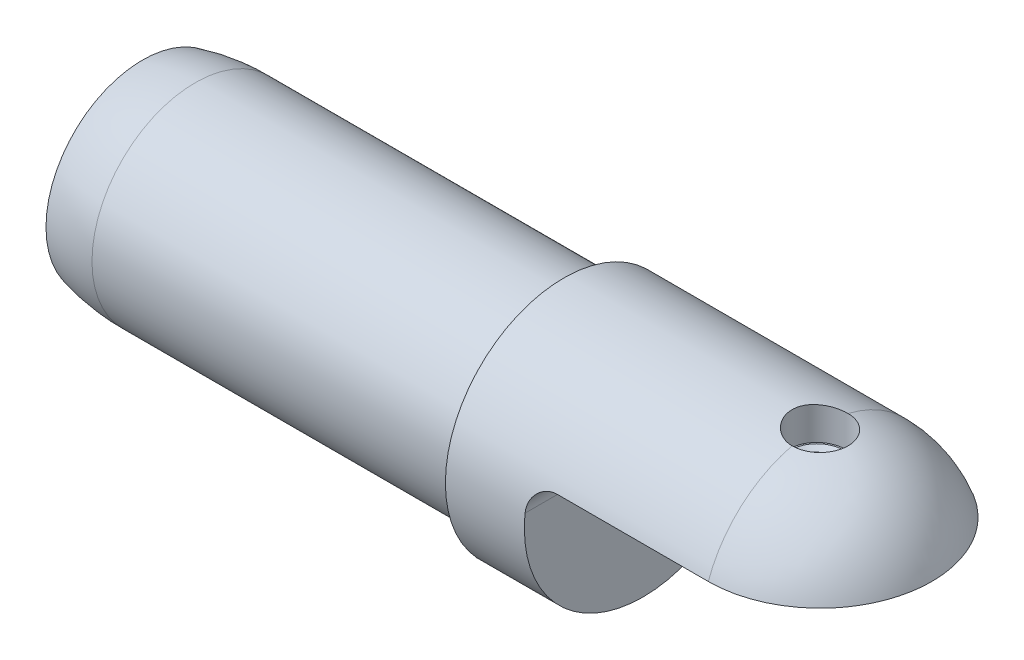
ISO-10303-21;
HEADER;
FILE_DESCRIPTION(('STEP AP214'),'2;1');
FILE_NAME('part.step','',(''),(''),'','','');
FILE_SCHEMA(('AUTOMOTIVE_DESIGN { 1 0 10303 214 1 1 1 1 }'));
ENDSEC;
DATA;
#1=APPLICATION_CONTEXT('core data for automotive mechanical design processes');
#2=APPLICATION_PROTOCOL_DEFINITION('international standard','automotive_design',2000,#1);
#3=PRODUCT_CONTEXT('',#1,'mechanical');
#4=PRODUCT('Part','Part','',(#3));
#5=PRODUCT_RELATED_PRODUCT_CATEGORY('part','',(#4));
#6=PRODUCT_DEFINITION_FORMATION('','',#4);
#7=PRODUCT_DEFINITION_CONTEXT('part definition',#1,'design');
#8=PRODUCT_DEFINITION('design','',#6,#7);
#9=PRODUCT_DEFINITION_SHAPE('','',#8);
#10=(LENGTH_UNIT() NAMED_UNIT(*) SI_UNIT(.MILLI.,.METRE.));
#11=(NAMED_UNIT(*) PLANE_ANGLE_UNIT() SI_UNIT($,.RADIAN.));
#12=(NAMED_UNIT(*) SI_UNIT($,.STERADIAN.) SOLID_ANGLE_UNIT());
#13=UNCERTAINTY_MEASURE_WITH_UNIT(LENGTH_MEASURE(1.E-05),#10,'distance_accuracy_value','');
#14=(GEOMETRIC_REPRESENTATION_CONTEXT(3) GLOBAL_UNCERTAINTY_ASSIGNED_CONTEXT((#13)) GLOBAL_UNIT_ASSIGNED_CONTEXT((#10,
#11,#12)) REPRESENTATION_CONTEXT('',''));
#15=CARTESIAN_POINT('',(0.,0.,0.));
#16=DIRECTION('',(0.,0.,1.));
#17=DIRECTION('',(1.,0.,0.));
#18=AXIS2_PLACEMENT_3D('',#15,#16,#17);
#19=CARTESIAN_POINT('',(18.1489720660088,93.8898671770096,-87.4605667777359));
#20=DIRECTION('',(0.,0.,1.));
#21=DIRECTION('',(1.,0.,0.));
#22=AXIS2_PLACEMENT_3D('',#19,#20,#21);
#23=PLANE('',#22);
#24=DIRECTION('',(0.,-1.,0.));
#25=VECTOR('',#24,1.);
#26=CARTESIAN_POINT('',(18.1489720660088,93.8898671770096,-87.4605667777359));
#27=LINE('',#26,#25);
#28=CARTESIAN_POINT('',(18.1489720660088,94.0486171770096,-87.4605667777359));
#29=VERTEX_POINT('',#28);
#30=CARTESIAN_POINT('',(18.1489720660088,93.7311171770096,-87.4605667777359));
#31=VERTEX_POINT('',#30);
#32=EDGE_CURVE('P0_E25',#29,#31,#27,.T.);
#33=ORIENTED_EDGE('',*,*,#32,.T.);
#34=DIRECTION('',(0.866025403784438,-0.5,0.));
#35=VECTOR('',#34,1.);
#36=CARTESIAN_POINT('',(18.4926758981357,93.5326796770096,-87.4605667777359));
#37=LINE('',#36,#35);
#38=CARTESIAN_POINT('',(18.8363797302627,93.3342421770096,-87.4605667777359));
#39=VERTEX_POINT('',#38);
#40=EDGE_CURVE('P0_E20',#31,#39,#37,.T.);
#41=ORIENTED_EDGE('',*,*,#40,.T.);
#42=DIRECTION('',(1.,0.,0.));
#43=VECTOR('',#42,1.);
#44=CARTESIAN_POINT('',(18.9319351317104,93.3342421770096,-87.4605667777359));
#45=LINE('',#44,#43);
#46=CARTESIAN_POINT('',(19.027490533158,93.3342421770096,-87.4605667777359));
#47=VERTEX_POINT('',#46);
#48=EDGE_CURVE('P0_E84',#39,#47,#45,.T.);
#49=ORIENTED_EDGE('',*,*,#48,.T.);
#50=DIRECTION('',(0.866025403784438,0.500000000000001,0.));
#51=VECTOR('',#50,1.);
#52=CARTESIAN_POINT('',(19.4399351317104,93.5723671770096,-87.4605667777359));
#53=LINE('',#52,#51);
#54=CARTESIAN_POINT('',(19.8523797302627,93.8104921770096,-87.4605667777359));
#55=VERTEX_POINT('',#54);
#56=EDGE_CURVE('P0_E230',#47,#55,#53,.T.);
#57=ORIENTED_EDGE('',*,*,#56,.T.);
#58=DIRECTION('',(0.,1.,0.));
#59=VECTOR('',#58,1.);
#60=CARTESIAN_POINT('',(19.8523797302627,93.8898671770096,-87.4605667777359));
#61=LINE('',#60,#59);
#62=CARTESIAN_POINT('',(19.8523797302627,93.9692421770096,-87.4605667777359));
#63=VERTEX_POINT('',#62);
#64=EDGE_CURVE('P0_E226',#55,#63,#61,.T.);
#65=ORIENTED_EDGE('',*,*,#64,.T.);
#66=DIRECTION('',(-0.866025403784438,0.500000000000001,0.));
#67=VECTOR('',#66,1.);
#68=CARTESIAN_POINT('',(19.4399351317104,94.2073671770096,-87.4605667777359));
#69=LINE('',#68,#67);
#70=CARTESIAN_POINT('',(19.027490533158,94.4454921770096,-87.4605667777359));
#71=VERTEX_POINT('',#70);
#72=EDGE_CURVE('P0_E220',#63,#71,#69,.T.);
#73=ORIENTED_EDGE('',*,*,#72,.T.);
#74=DIRECTION('',(-1.,0.,0.));
#75=VECTOR('',#74,1.);
#76=CARTESIAN_POINT('',(18.9319351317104,94.4454921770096,-87.4605667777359));
#77=LINE('',#76,#75);
#78=CARTESIAN_POINT('',(18.8363797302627,94.4454921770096,-87.4605667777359));
#79=VERTEX_POINT('',#78);
#80=EDGE_CURVE('P0_E205',#71,#79,#77,.T.);
#81=ORIENTED_EDGE('',*,*,#80,.T.);
#82=DIRECTION('',(-0.866025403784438,-0.5,0.));
#83=VECTOR('',#82,1.);
#84=CARTESIAN_POINT('',(18.4926758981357,94.2470546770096,-87.4605667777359));
#85=LINE('',#84,#83);
#86=EDGE_CURVE('P0_E41',#79,#29,#85,.T.);
#87=ORIENTED_EDGE('',*,*,#86,.T.);
#88=EDGE_LOOP('',(#33,#41,#49,#57,#65,#73,#81,#87));
#89=FACE_BOUND('',#88,.T.);
#90=ADVANCED_FACE('P0_F16',(#89),#23,.T.);
#91=CARTESIAN_POINT('',(18.1489720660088,98.9698671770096,-87.4605667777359));
#92=DIRECTION('',(0.,0.,-1.));
#93=DIRECTION('',(-1.,0.,0.));
#94=AXIS2_PLACEMENT_3D('',#91,#92,#93);
#95=PLANE('',#94);
#96=DIRECTION('',(0.,1.,0.));
#97=VECTOR('',#96,1.);
#98=CARTESIAN_POINT('',(18.1489720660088,98.9698671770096,-87.4605667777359));
#99=LINE('',#98,#97);
#100=CARTESIAN_POINT('',(18.1489720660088,98.8111171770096,-87.4605667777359));
#101=VERTEX_POINT('',#100);
#102=CARTESIAN_POINT('',(18.1489720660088,99.1286171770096,-87.4605667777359));
#103=VERTEX_POINT('',#102);
#104=EDGE_CURVE('P0_E10',#101,#103,#99,.T.);
#105=ORIENTED_EDGE('',*,*,#104,.T.);
#106=DIRECTION('',(0.866025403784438,0.5,0.));
#107=VECTOR('',#106,1.);
#108=CARTESIAN_POINT('',(18.4926758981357,99.3270546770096,-87.4605667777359));
#109=LINE('',#108,#107);
#110=CARTESIAN_POINT('',(18.8363797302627,99.5254921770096,-87.4605667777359));
#111=VERTEX_POINT('',#110);
#112=EDGE_CURVE('P0_E267',#103,#111,#109,.T.);
#113=ORIENTED_EDGE('',*,*,#112,.T.);
#114=DIRECTION('',(1.,0.,0.));
#115=VECTOR('',#114,1.);
#116=CARTESIAN_POINT('',(18.9319351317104,99.5254921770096,-87.4605667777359));
#117=LINE('',#116,#115);
#118=CARTESIAN_POINT('',(19.027490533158,99.5254921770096,-87.4605667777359));
#119=VERTEX_POINT('',#118);
#120=EDGE_CURVE('P0_E213',#111,#119,#117,.T.);
#121=ORIENTED_EDGE('',*,*,#120,.T.);
#122=DIRECTION('',(0.866025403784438,-0.500000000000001,0.));
#123=VECTOR('',#122,1.);
#124=CARTESIAN_POINT('',(19.4399351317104,99.2873671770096,-87.4605667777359));
#125=LINE('',#124,#123);
#126=CARTESIAN_POINT('',(19.8523797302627,99.0492421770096,-87.4605667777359));
#127=VERTEX_POINT('',#126);
#128=EDGE_CURVE('P0_E211',#119,#127,#125,.T.);
#129=ORIENTED_EDGE('',*,*,#128,.T.);
#130=DIRECTION('',(0.,-1.,0.));
#131=VECTOR('',#130,1.);
#132=CARTESIAN_POINT('',(19.8523797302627,98.9698671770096,-87.4605667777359));
#133=LINE('',#132,#131);
#134=CARTESIAN_POINT('',(19.8523797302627,98.8904921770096,-87.4605667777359));
#135=VERTEX_POINT('',#134);
#136=EDGE_CURVE('P0_E222',#127,#135,#133,.T.);
#137=ORIENTED_EDGE('',*,*,#136,.T.);
#138=DIRECTION('',(-0.866025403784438,-0.500000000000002,0.));
#139=VECTOR('',#138,1.);
#140=CARTESIAN_POINT('',(19.4399351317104,98.6523671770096,-87.4605667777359));
#141=LINE('',#140,#139);
#142=CARTESIAN_POINT('',(19.027490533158,98.4142421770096,-87.4605667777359));
#143=VERTEX_POINT('',#142);
#144=EDGE_CURVE('P0_E228',#135,#143,#141,.T.);
#145=ORIENTED_EDGE('',*,*,#144,.T.);
#146=DIRECTION('',(-1.,0.,0.));
#147=VECTOR('',#146,1.);
#148=CARTESIAN_POINT('',(18.9319351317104,98.4142421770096,-87.4605667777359));
#149=LINE('',#148,#147);
#150=CARTESIAN_POINT('',(18.8363797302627,98.4142421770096,-87.4605667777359));
#151=VERTEX_POINT('',#150);
#152=EDGE_CURVE('P0_E102',#143,#151,#149,.T.);
#153=ORIENTED_EDGE('',*,*,#152,.T.);
#154=DIRECTION('',(-0.866025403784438,0.5,0.));
#155=VECTOR('',#154,1.);
#156=CARTESIAN_POINT('',(18.4926758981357,98.6126796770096,-87.4605667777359));
#157=LINE('',#156,#155);
#158=EDGE_CURVE('P0_E89',#151,#101,#157,.T.);
#159=ORIENTED_EDGE('',*,*,#158,.T.);
#160=EDGE_LOOP('',(#105,#113,#121,#129,#137,#145,#153,#159));
#161=FACE_BOUND('',#160,.T.);
#162=ADVANCED_FACE('P0_F18',(#161),#95,.T.);
#163=CARTESIAN_POINT('',(18.1489720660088,94.0486171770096,-87.4605667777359));
#164=CARTESIAN_POINT('',(18.1489720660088,94.1279921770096,-88.4909612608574));
#165=CARTESIAN_POINT('',(17.4203731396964,94.2073671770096,-89.2195601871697));
#166=CARTESIAN_POINT('',(16.6917742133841,94.2867421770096,-89.9481591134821));
#167=CARTESIAN_POINT('',(15.6613797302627,94.3661171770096,-89.9481591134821));
#168=CARTESIAN_POINT('',(14.6309852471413,94.4454921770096,-89.9481591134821));
#169=CARTESIAN_POINT('',(13.9023863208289,94.5248671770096,-89.2195601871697));
#170=CARTESIAN_POINT('',(13.1737873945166,94.6042421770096,-88.4909612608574));
#171=CARTESIAN_POINT('',(13.1737873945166,94.6836171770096,-87.4605667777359));
#172=CARTESIAN_POINT('',(13.1737873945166,94.7629921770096,-86.4301722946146));
#173=CARTESIAN_POINT('',(13.9023863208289,94.8423671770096,-85.7015733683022));
#174=CARTESIAN_POINT('',(14.6309852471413,94.9217421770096,-84.9729744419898));
#175=CARTESIAN_POINT('',(15.6613797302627,95.0011171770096,-84.9729744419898));
#176=CARTESIAN_POINT('',(16.6917742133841,95.0804921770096,-84.9729744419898));
#177=CARTESIAN_POINT('',(17.4203731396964,95.1598671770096,-85.7015733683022));
#178=CARTESIAN_POINT('',(18.1489720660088,95.2392421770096,-86.4301722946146));
#179=CARTESIAN_POINT('',(18.1489720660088,95.3186171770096,-87.4605667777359));
#180=CARTESIAN_POINT('',(18.1489720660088,95.3979921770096,-88.4909612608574));
#181=CARTESIAN_POINT('',(17.4203731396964,95.4773671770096,-89.2195601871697));
#182=CARTESIAN_POINT('',(16.6917742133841,95.5567421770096,-89.9481591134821));
#183=CARTESIAN_POINT('',(15.6613797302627,95.6361171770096,-89.9481591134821));
#184=CARTESIAN_POINT('',(14.6309852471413,95.7154921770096,-89.9481591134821));
#185=CARTESIAN_POINT('',(13.9023863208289,95.7948671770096,-89.2195601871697));
#186=CARTESIAN_POINT('',(13.1737873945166,95.8742421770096,-88.4909612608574));
#187=CARTESIAN_POINT('',(13.1737873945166,95.9536171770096,-87.4605667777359));
#188=CARTESIAN_POINT('',(13.1737873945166,96.0329921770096,-86.4301722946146));
#189=CARTESIAN_POINT('',(13.9023863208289,96.1123671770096,-85.7015733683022));
#190=CARTESIAN_POINT('',(14.6309852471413,96.1917421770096,-84.9729744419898));
#191=CARTESIAN_POINT('',(15.6613797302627,96.2711171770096,-84.9729744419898));
#192=CARTESIAN_POINT('',(16.6917742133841,96.3504921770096,-84.9729744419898));
#193=CARTESIAN_POINT('',(17.4203731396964,96.4298671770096,-85.7015733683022));
#194=CARTESIAN_POINT('',(18.1489720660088,96.5092421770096,-86.4301722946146));
#195=CARTESIAN_POINT('',(18.1489720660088,96.5886171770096,-87.4605667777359));
#196=CARTESIAN_POINT('',(18.1489720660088,96.6679921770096,-88.4909612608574));
#197=CARTESIAN_POINT('',(17.4203731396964,96.7473671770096,-89.2195601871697));
#198=CARTESIAN_POINT('',(16.6917742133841,96.8267421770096,-89.9481591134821));
#199=CARTESIAN_POINT('',(15.6613797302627,96.9061171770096,-89.9481591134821));
#200=CARTESIAN_POINT('',(14.6309852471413,96.9854921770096,-89.9481591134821));
#201=CARTESIAN_POINT('',(13.9023863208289,97.0648671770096,-89.2195601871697));
#202=CARTESIAN_POINT('',(13.1737873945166,97.1442421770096,-88.4909612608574));
#203=CARTESIAN_POINT('',(13.1737873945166,97.2236171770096,-87.4605667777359));
#204=CARTESIAN_POINT('',(13.1737873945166,97.3029921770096,-86.4301722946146));
#205=CARTESIAN_POINT('',(13.9023863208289,97.3823671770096,-85.7015733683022));
#206=CARTESIAN_POINT('',(14.6309852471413,97.4617421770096,-84.9729744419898));
#207=CARTESIAN_POINT('',(15.6613797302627,97.5411171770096,-84.9729744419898));
#208=CARTESIAN_POINT('',(16.6917742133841,97.6204921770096,-84.9729744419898));
#209=CARTESIAN_POINT('',(17.4203731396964,97.6998671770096,-85.7015733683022));
#210=CARTESIAN_POINT('',(18.1489720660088,97.7792421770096,-86.4301722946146));
#211=CARTESIAN_POINT('',(18.1489720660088,97.8586171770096,-87.4605667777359));
#212=CARTESIAN_POINT('',(18.1489720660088,97.9379921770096,-88.4909612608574));
#213=CARTESIAN_POINT('',(17.4203731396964,98.0173671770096,-89.2195601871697));
#214=CARTESIAN_POINT('',(16.6917742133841,98.0967421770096,-89.9481591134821));
#215=CARTESIAN_POINT('',(15.6613797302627,98.1761171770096,-89.9481591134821));
#216=CARTESIAN_POINT('',(14.6309852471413,98.2554921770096,-89.9481591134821));
#217=CARTESIAN_POINT('',(13.9023863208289,98.3348671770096,-89.2195601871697));
#218=CARTESIAN_POINT('',(13.1737873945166,98.4142421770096,-88.4909612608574));
#219=CARTESIAN_POINT('',(13.1737873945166,98.4936171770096,-87.4605667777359));
#220=CARTESIAN_POINT('',(13.1737873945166,98.5729921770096,-86.4301722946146));
#221=CARTESIAN_POINT('',(13.9023863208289,98.6523671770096,-85.7015733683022));
#222=CARTESIAN_POINT('',(14.6309852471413,98.7317421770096,-84.9729744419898));
#223=CARTESIAN_POINT('',(15.6613797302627,98.8111171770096,-84.9729744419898));
#224=CARTESIAN_POINT('',(16.6917742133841,98.8904921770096,-84.9729744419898));
#225=CARTESIAN_POINT('',(17.4203731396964,98.9698671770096,-85.7015733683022));
#226=CARTESIAN_POINT('',(18.1489720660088,99.0492421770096,-86.4301722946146));
#227=CARTESIAN_POINT('',(18.1489720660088,99.1286171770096,-87.4605667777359));
#228=CARTESIAN_POINT('',(18.1489720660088,93.7311171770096,-87.4605667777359));
#229=CARTESIAN_POINT('',(18.1489720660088,93.8104921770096,-88.4909612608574));
#230=CARTESIAN_POINT('',(17.4203731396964,93.8898671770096,-89.2195601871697));
#231=CARTESIAN_POINT('',(16.6917742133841,93.9692421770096,-89.9481591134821));
#232=CARTESIAN_POINT('',(15.6613797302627,94.0486171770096,-89.9481591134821));
#233=CARTESIAN_POINT('',(14.6309852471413,94.1279921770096,-89.9481591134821));
#234=CARTESIAN_POINT('',(13.9023863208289,94.2073671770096,-89.2195601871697));
#235=CARTESIAN_POINT('',(13.1737873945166,94.2867421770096,-88.4909612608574));
#236=CARTESIAN_POINT('',(13.1737873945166,94.3661171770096,-87.4605667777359));
#237=CARTESIAN_POINT('',(13.1737873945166,94.4454921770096,-86.4301722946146));
#238=CARTESIAN_POINT('',(13.9023863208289,94.5248671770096,-85.7015733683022));
#239=CARTESIAN_POINT('',(14.6309852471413,94.6042421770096,-84.9729744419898));
#240=CARTESIAN_POINT('',(15.6613797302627,94.6836171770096,-84.9729744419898));
#241=CARTESIAN_POINT('',(16.6917742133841,94.7629921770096,-84.9729744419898));
#242=CARTESIAN_POINT('',(17.4203731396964,94.8423671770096,-85.7015733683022));
#243=CARTESIAN_POINT('',(18.1489720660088,94.9217421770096,-86.4301722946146));
#244=CARTESIAN_POINT('',(18.1489720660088,95.0011171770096,-87.4605667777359));
#245=CARTESIAN_POINT('',(18.1489720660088,95.0804921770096,-88.4909612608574));
#246=CARTESIAN_POINT('',(17.4203731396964,95.1598671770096,-89.2195601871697));
#247=CARTESIAN_POINT('',(16.6917742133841,95.2392421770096,-89.9481591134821));
#248=CARTESIAN_POINT('',(15.6613797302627,95.3186171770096,-89.9481591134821));
#249=CARTESIAN_POINT('',(14.6309852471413,95.3979921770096,-89.9481591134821));
#250=CARTESIAN_POINT('',(13.9023863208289,95.4773671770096,-89.2195601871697));
#251=CARTESIAN_POINT('',(13.1737873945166,95.5567421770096,-88.4909612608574));
#252=CARTESIAN_POINT('',(13.1737873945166,95.6361171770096,-87.4605667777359));
#253=CARTESIAN_POINT('',(13.1737873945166,95.7154921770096,-86.4301722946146));
#254=CARTESIAN_POINT('',(13.9023863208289,95.7948671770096,-85.7015733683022));
#255=CARTESIAN_POINT('',(14.6309852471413,95.8742421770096,-84.9729744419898));
#256=CARTESIAN_POINT('',(15.6613797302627,95.9536171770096,-84.9729744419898));
#257=CARTESIAN_POINT('',(16.6917742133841,96.0329921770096,-84.9729744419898));
#258=CARTESIAN_POINT('',(17.4203731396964,96.1123671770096,-85.7015733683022));
#259=CARTESIAN_POINT('',(18.1489720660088,96.1917421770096,-86.4301722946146));
#260=CARTESIAN_POINT('',(18.1489720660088,96.2711171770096,-87.4605667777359));
#261=CARTESIAN_POINT('',(18.1489720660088,96.3504921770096,-88.4909612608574));
#262=CARTESIAN_POINT('',(17.4203731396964,96.4298671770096,-89.2195601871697));
#263=CARTESIAN_POINT('',(16.6917742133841,96.5092421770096,-89.9481591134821));
#264=CARTESIAN_POINT('',(15.6613797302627,96.5886171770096,-89.9481591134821));
#265=CARTESIAN_POINT('',(14.6309852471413,96.6679921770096,-89.9481591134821));
#266=CARTESIAN_POINT('',(13.9023863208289,96.7473671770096,-89.2195601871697));
#267=CARTESIAN_POINT('',(13.1737873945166,96.8267421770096,-88.4909612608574));
#268=CARTESIAN_POINT('',(13.1737873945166,96.9061171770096,-87.4605667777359));
#269=CARTESIAN_POINT('',(13.1737873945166,96.9854921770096,-86.4301722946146));
#270=CARTESIAN_POINT('',(13.9023863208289,97.0648671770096,-85.7015733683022));
#271=CARTESIAN_POINT('',(14.6309852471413,97.1442421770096,-84.9729744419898));
#272=CARTESIAN_POINT('',(15.6613797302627,97.2236171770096,-84.9729744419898));
#273=CARTESIAN_POINT('',(16.6917742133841,97.3029921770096,-84.9729744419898));
#274=CARTESIAN_POINT('',(17.4203731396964,97.3823671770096,-85.7015733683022));
#275=CARTESIAN_POINT('',(18.1489720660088,97.4617421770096,-86.4301722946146));
#276=CARTESIAN_POINT('',(18.1489720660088,97.5411171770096,-87.4605667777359));
#277=CARTESIAN_POINT('',(18.1489720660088,97.6204921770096,-88.4909612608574));
#278=CARTESIAN_POINT('',(17.4203731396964,97.6998671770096,-89.2195601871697));
#279=CARTESIAN_POINT('',(16.6917742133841,97.7792421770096,-89.9481591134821));
#280=CARTESIAN_POINT('',(15.6613797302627,97.8586171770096,-89.9481591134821));
#281=CARTESIAN_POINT('',(14.6309852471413,97.9379921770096,-89.9481591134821));
#282=CARTESIAN_POINT('',(13.9023863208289,98.0173671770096,-89.2195601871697));
#283=CARTESIAN_POINT('',(13.1737873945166,98.0967421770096,-88.4909612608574));
#284=CARTESIAN_POINT('',(13.1737873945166,98.1761171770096,-87.4605667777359));
#285=CARTESIAN_POINT('',(13.1737873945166,98.2554921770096,-86.4301722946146));
#286=CARTESIAN_POINT('',(13.9023863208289,98.3348671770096,-85.7015733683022));
#287=CARTESIAN_POINT('',(14.6309852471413,98.4142421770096,-84.9729744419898));
#288=CARTESIAN_POINT('',(15.6613797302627,98.4936171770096,-84.9729744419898));
#289=CARTESIAN_POINT('',(16.6917742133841,98.5729921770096,-84.9729744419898));
#290=CARTESIAN_POINT('',(17.4203731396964,98.6523671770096,-85.7015733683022));
#291=CARTESIAN_POINT('',(18.1489720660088,98.7317421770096,-86.4301722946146));
#292=CARTESIAN_POINT('',(18.1489720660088,98.8111171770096,-87.4605667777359));
#293=(BOUNDED_SURFACE() B_SPLINE_SURFACE(1,2,((#163,#164,#165,#166,#167,#168,#169,#170,#171,
#172,#173,#174,#175,#176,#177,#178,#179,#180,#181,#182,#183,#184,#185,#186,#187,#188,#189,#190,
#191,#192,#193,#194,#195,#196,#197,#198,#199,#200,#201,#202,#203,#204,#205,#206,#207,#208,#209,
#210,#211,#212,#213,#214,#215,#216,#217,#218,#219,#220,#221,#222,#223,#224,#225,#226,#227),
(#228,#229,#230,#231,#232,#233,#234,#235,#236,#237,#238,#239,#240,#241,#242,#243,#244,#245,#246,
#247,#248,#249,#250,#251,#252,#253,#254,#255,#256,#257,#258,#259,#260,#261,#262,#263,#264,#265,
#266,#267,#268,#269,#270,#271,#272,#273,#274,#275,#276,#277,#278,#279,#280,#281,#282,#283,#284,
#285,#286,#287,#288,#289,#290,#291,#292)),.UNSPECIFIED.,.F.,.F.,
.F.) B_SPLINE_SURFACE_WITH_KNOTS((2,2),(3,2,2,2,2,2,2,2,2,2,2,2,2,2,2,2,2,2,2,2,2,2,2,2,2,2,2,2,
2,2,2,2,3),(0.,1.),(0.,0.03125,0.0625,0.09375,0.125,0.15625,0.1875,0.21875,0.25,0.28125,0.3125,
0.34375,0.375,0.40625,0.4375,0.46875,0.5,0.53125,0.5625,0.59375,0.625,0.65625,0.6875,0.71875,
0.75,0.78125,0.8125,0.84375,0.875,0.90625,0.9375,0.96875,1.),
.UNSPECIFIED.) GEOMETRIC_REPRESENTATION_ITEM() RATIONAL_B_SPLINE_SURFACE(((1.,0.923879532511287,
1.,0.923879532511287,1.,0.923879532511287,1.,0.923879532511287,1.,0.923879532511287,1.,
0.923879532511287,1.,0.923879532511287,1.,0.923879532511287,1.,0.923879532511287,1.,
0.923879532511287,1.,0.923879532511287,1.,0.923879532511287,1.,0.923879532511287,1.,
0.923879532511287,1.,0.923879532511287,1.,0.923879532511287,1.,0.923879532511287,1.,
0.923879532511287,1.,0.923879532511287,1.,0.923879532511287,1.,0.923879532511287,1.,
0.923879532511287,1.,0.923879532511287,1.,0.923879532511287,1.,0.923879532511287,1.,
0.923879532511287,1.,0.923879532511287,1.,0.923879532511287,1.,0.923879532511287,1.,
0.923879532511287,1.,0.923879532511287,1.,0.923879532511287,1.),(1.,0.923879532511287,1.,
0.923879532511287,1.,0.923879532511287,1.,0.923879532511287,1.,0.923879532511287,1.,
0.923879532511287,1.,0.923879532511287,1.,0.923879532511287,1.,0.923879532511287,1.,
0.923879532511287,1.,0.923879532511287,1.,0.923879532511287,1.,0.923879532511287,1.,
0.923879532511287,1.,0.923879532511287,1.,0.923879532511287,1.,0.923879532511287,1.,
0.923879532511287,1.,0.923879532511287,1.,0.923879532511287,1.,0.923879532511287,1.,
0.923879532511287,1.,0.923879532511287,1.,0.923879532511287,1.,0.923879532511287,1.,
0.923879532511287,1.,0.923879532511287,1.,0.923879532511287,1.,0.923879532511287,1.,
0.923879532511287,1.,0.923879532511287,1.,0.923879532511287,1.))) REPRESENTATION_ITEM('') SURFACE());
#294=CARTESIAN_POINT('',(18.1489720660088,94.0486171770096,-87.4605667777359));
#295=CARTESIAN_POINT('',(18.1489720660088,94.1279921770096,-88.4909612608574));
#296=CARTESIAN_POINT('',(17.4203731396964,94.2073671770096,-89.2195601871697));
#297=CARTESIAN_POINT('',(16.6917742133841,94.2867421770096,-89.9481591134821));
#298=CARTESIAN_POINT('',(15.6613797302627,94.3661171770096,-89.9481591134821));
#299=CARTESIAN_POINT('',(14.6309852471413,94.4454921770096,-89.9481591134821));
#300=CARTESIAN_POINT('',(13.9023863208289,94.5248671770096,-89.2195601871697));
#301=CARTESIAN_POINT('',(13.1737873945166,94.6042421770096,-88.4909612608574));
#302=CARTESIAN_POINT('',(13.1737873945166,94.6836171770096,-87.4605667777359));
#303=CARTESIAN_POINT('',(13.1737873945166,94.7629921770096,-86.4301722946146));
#304=CARTESIAN_POINT('',(13.9023863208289,94.8423671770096,-85.7015733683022));
#305=CARTESIAN_POINT('',(14.6309852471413,94.9217421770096,-84.9729744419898));
#306=CARTESIAN_POINT('',(15.6613797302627,95.0011171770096,-84.9729744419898));
#307=CARTESIAN_POINT('',(16.6917742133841,95.0804921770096,-84.9729744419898));
#308=CARTESIAN_POINT('',(17.4203731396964,95.1598671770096,-85.7015733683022));
#309=CARTESIAN_POINT('',(18.1489720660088,95.2392421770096,-86.4301722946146));
#310=CARTESIAN_POINT('',(18.1489720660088,95.3186171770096,-87.4605667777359));
#311=CARTESIAN_POINT('',(18.1489720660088,95.3979921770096,-88.4909612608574));
#312=CARTESIAN_POINT('',(17.4203731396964,95.4773671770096,-89.2195601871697));
#313=CARTESIAN_POINT('',(16.6917742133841,95.5567421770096,-89.9481591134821));
#314=CARTESIAN_POINT('',(15.6613797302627,95.6361171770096,-89.9481591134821));
#315=CARTESIAN_POINT('',(14.6309852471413,95.7154921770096,-89.9481591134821));
#316=CARTESIAN_POINT('',(13.9023863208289,95.7948671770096,-89.2195601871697));
#317=CARTESIAN_POINT('',(13.1737873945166,95.8742421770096,-88.4909612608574));
#318=CARTESIAN_POINT('',(13.1737873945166,95.9536171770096,-87.4605667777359));
#319=CARTESIAN_POINT('',(13.1737873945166,96.0329921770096,-86.4301722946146));
#320=CARTESIAN_POINT('',(13.9023863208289,96.1123671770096,-85.7015733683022));
#321=CARTESIAN_POINT('',(14.6309852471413,96.1917421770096,-84.9729744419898));
#322=CARTESIAN_POINT('',(15.6613797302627,96.2711171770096,-84.9729744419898));
#323=CARTESIAN_POINT('',(16.6917742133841,96.3504921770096,-84.9729744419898));
#324=CARTESIAN_POINT('',(17.4203731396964,96.4298671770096,-85.7015733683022));
#325=CARTESIAN_POINT('',(18.1489720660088,96.5092421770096,-86.4301722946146));
#326=CARTESIAN_POINT('',(18.1489720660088,96.5886171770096,-87.4605667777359));
#327=CARTESIAN_POINT('',(18.1489720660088,96.6679921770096,-88.4909612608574));
#328=CARTESIAN_POINT('',(17.4203731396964,96.7473671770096,-89.2195601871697));
#329=CARTESIAN_POINT('',(16.6917742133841,96.8267421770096,-89.9481591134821));
#330=CARTESIAN_POINT('',(15.6613797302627,96.9061171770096,-89.9481591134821));
#331=CARTESIAN_POINT('',(14.6309852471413,96.9854921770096,-89.9481591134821));
#332=CARTESIAN_POINT('',(13.9023863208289,97.0648671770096,-89.2195601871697));
#333=CARTESIAN_POINT('',(13.1737873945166,97.1442421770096,-88.4909612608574));
#334=CARTESIAN_POINT('',(13.1737873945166,97.2236171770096,-87.4605667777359));
#335=CARTESIAN_POINT('',(13.1737873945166,97.3029921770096,-86.4301722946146));
#336=CARTESIAN_POINT('',(13.9023863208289,97.3823671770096,-85.7015733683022));
#337=CARTESIAN_POINT('',(14.6309852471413,97.4617421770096,-84.9729744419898));
#338=CARTESIAN_POINT('',(15.6613797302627,97.5411171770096,-84.9729744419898));
#339=CARTESIAN_POINT('',(16.6917742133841,97.6204921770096,-84.9729744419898));
#340=CARTESIAN_POINT('',(17.4203731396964,97.6998671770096,-85.7015733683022));
#341=CARTESIAN_POINT('',(18.1489720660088,97.7792421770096,-86.4301722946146));
#342=CARTESIAN_POINT('',(18.1489720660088,97.8586171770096,-87.4605667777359));
#343=CARTESIAN_POINT('',(18.1489720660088,97.9379921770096,-88.4909612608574));
#344=CARTESIAN_POINT('',(17.4203731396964,98.0173671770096,-89.2195601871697));
#345=CARTESIAN_POINT('',(16.6917742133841,98.0967421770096,-89.9481591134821));
#346=CARTESIAN_POINT('',(15.6613797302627,98.1761171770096,-89.9481591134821));
#347=CARTESIAN_POINT('',(14.6309852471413,98.2554921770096,-89.9481591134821));
#348=CARTESIAN_POINT('',(13.9023863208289,98.3348671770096,-89.2195601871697));
#349=CARTESIAN_POINT('',(13.1737873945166,98.4142421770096,-88.4909612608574));
#350=CARTESIAN_POINT('',(13.1737873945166,98.4936171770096,-87.4605667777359));
#351=CARTESIAN_POINT('',(13.1737873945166,98.5729921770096,-86.4301722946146));
#352=CARTESIAN_POINT('',(13.9023863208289,98.6523671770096,-85.7015733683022));
#353=CARTESIAN_POINT('',(14.6309852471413,98.7317421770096,-84.9729744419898));
#354=CARTESIAN_POINT('',(15.6613797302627,98.8111171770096,-84.9729744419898));
#355=CARTESIAN_POINT('',(16.6917742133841,98.8904921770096,-84.9729744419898));
#356=CARTESIAN_POINT('',(17.4203731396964,98.9698671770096,-85.7015733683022));
#357=CARTESIAN_POINT('',(18.1489720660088,99.0492421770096,-86.4301722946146));
#358=CARTESIAN_POINT('',(18.1489720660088,99.1286171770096,-87.4605667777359));
#359=(BOUNDED_CURVE() B_SPLINE_CURVE(2,(#294,#295,#296,#297,#298,#299,#300,#301,#302,#303,#304,
#305,#306,#307,#308,#309,#310,#311,#312,#313,#314,#315,#316,#317,#318,#319,#320,#321,#322,#323,
#324,#325,#326,#327,#328,#329,#330,#331,#332,#333,#334,#335,#336,#337,#338,#339,#340,#341,#342,
#343,#344,#345,#346,#347,#348,#349,#350,#351,#352,#353,#354,#355,#356,#357,#358),.UNSPECIFIED.,
.F.,.F.) B_SPLINE_CURVE_WITH_KNOTS((3,2,2,2,2,2,2,2,2,2,2,2,2,2,2,2,2,2,2,2,2,2,2,2,2,2,2,2,2,2,
2,2,3),(0.,0.03125,0.0625,0.09375,0.125,0.15625,0.1875,0.21875,0.25,0.28125,0.3125,0.34375,
0.375,0.40625,0.4375,0.46875,0.5,0.53125,0.5625,0.59375,0.625,0.65625,0.6875,0.71875,0.75,
0.78125,0.8125,0.84375,0.875,0.90625,0.9375,0.96875,1.),
.UNSPECIFIED.) CURVE() GEOMETRIC_REPRESENTATION_ITEM() RATIONAL_B_SPLINE_CURVE((1.,
0.923879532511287,1.,0.923879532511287,1.,0.923879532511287,1.,0.923879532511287,1.,
0.923879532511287,1.,0.923879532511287,1.,0.923879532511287,1.,0.923879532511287,1.,
0.923879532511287,1.,0.923879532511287,1.,0.923879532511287,1.,0.923879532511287,1.,
0.923879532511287,1.,0.923879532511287,1.,0.923879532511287,1.,0.923879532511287,1.,
0.923879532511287,1.,0.923879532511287,1.,0.923879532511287,1.,0.923879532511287,1.,
0.923879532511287,1.,0.923879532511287,1.,0.923879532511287,1.,0.923879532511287,1.,
0.923879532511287,1.,0.923879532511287,1.,0.923879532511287,1.,0.923879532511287,1.,
0.923879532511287,1.,0.923879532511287,1.,0.923879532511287,1.,0.923879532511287,1.)) REPRESENTATION_ITEM(''));
#360=EDGE_CURVE('P0_E33',#29,#103,#359,.T.);
#361=CARTESIAN_POINT('',(18.1489720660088,93.7311171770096,-87.4605667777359));
#362=CARTESIAN_POINT('',(18.1489720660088,93.8104921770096,-88.4909612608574));
#363=CARTESIAN_POINT('',(17.4203731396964,93.8898671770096,-89.2195601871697));
#364=CARTESIAN_POINT('',(16.6917742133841,93.9692421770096,-89.9481591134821));
#365=CARTESIAN_POINT('',(15.6613797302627,94.0486171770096,-89.9481591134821));
#366=CARTESIAN_POINT('',(14.6309852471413,94.1279921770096,-89.9481591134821));
#367=CARTESIAN_POINT('',(13.9023863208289,94.2073671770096,-89.2195601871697));
#368=CARTESIAN_POINT('',(13.1737873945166,94.2867421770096,-88.4909612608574));
#369=CARTESIAN_POINT('',(13.1737873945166,94.3661171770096,-87.4605667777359));
#370=CARTESIAN_POINT('',(13.1737873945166,94.4454921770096,-86.4301722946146));
#371=CARTESIAN_POINT('',(13.9023863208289,94.5248671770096,-85.7015733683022));
#372=CARTESIAN_POINT('',(14.6309852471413,94.6042421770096,-84.9729744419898));
#373=CARTESIAN_POINT('',(15.6613797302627,94.6836171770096,-84.9729744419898));
#374=CARTESIAN_POINT('',(16.6917742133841,94.7629921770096,-84.9729744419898));
#375=CARTESIAN_POINT('',(17.4203731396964,94.8423671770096,-85.7015733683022));
#376=CARTESIAN_POINT('',(18.1489720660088,94.9217421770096,-86.4301722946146));
#377=CARTESIAN_POINT('',(18.1489720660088,95.0011171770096,-87.4605667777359));
#378=CARTESIAN_POINT('',(18.1489720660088,95.0804921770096,-88.4909612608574));
#379=CARTESIAN_POINT('',(17.4203731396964,95.1598671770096,-89.2195601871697));
#380=CARTESIAN_POINT('',(16.6917742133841,95.2392421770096,-89.9481591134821));
#381=CARTESIAN_POINT('',(15.6613797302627,95.3186171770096,-89.9481591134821));
#382=CARTESIAN_POINT('',(14.6309852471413,95.3979921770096,-89.9481591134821));
#383=CARTESIAN_POINT('',(13.9023863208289,95.4773671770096,-89.2195601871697));
#384=CARTESIAN_POINT('',(13.1737873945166,95.5567421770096,-88.4909612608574));
#385=CARTESIAN_POINT('',(13.1737873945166,95.6361171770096,-87.4605667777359));
#386=CARTESIAN_POINT('',(13.1737873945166,95.7154921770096,-86.4301722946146));
#387=CARTESIAN_POINT('',(13.9023863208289,95.7948671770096,-85.7015733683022));
#388=CARTESIAN_POINT('',(14.6309852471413,95.8742421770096,-84.9729744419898));
#389=CARTESIAN_POINT('',(15.6613797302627,95.9536171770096,-84.9729744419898));
#390=CARTESIAN_POINT('',(16.6917742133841,96.0329921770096,-84.9729744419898));
#391=CARTESIAN_POINT('',(17.4203731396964,96.1123671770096,-85.7015733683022));
#392=CARTESIAN_POINT('',(18.1489720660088,96.1917421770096,-86.4301722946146));
#393=CARTESIAN_POINT('',(18.1489720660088,96.2711171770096,-87.4605667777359));
#394=CARTESIAN_POINT('',(18.1489720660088,96.3504921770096,-88.4909612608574));
#395=CARTESIAN_POINT('',(17.4203731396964,96.4298671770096,-89.2195601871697));
#396=CARTESIAN_POINT('',(16.6917742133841,96.5092421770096,-89.9481591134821));
#397=CARTESIAN_POINT('',(15.6613797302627,96.5886171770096,-89.9481591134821));
#398=CARTESIAN_POINT('',(14.6309852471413,96.6679921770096,-89.9481591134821));
#399=CARTESIAN_POINT('',(13.9023863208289,96.7473671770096,-89.2195601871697));
#400=CARTESIAN_POINT('',(13.1737873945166,96.8267421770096,-88.4909612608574));
#401=CARTESIAN_POINT('',(13.1737873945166,96.9061171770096,-87.4605667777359));
#402=CARTESIAN_POINT('',(13.1737873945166,96.9854921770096,-86.4301722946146));
#403=CARTESIAN_POINT('',(13.9023863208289,97.0648671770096,-85.7015733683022));
#404=CARTESIAN_POINT('',(14.6309852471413,97.1442421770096,-84.9729744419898));
#405=CARTESIAN_POINT('',(15.6613797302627,97.2236171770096,-84.9729744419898));
#406=CARTESIAN_POINT('',(16.6917742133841,97.3029921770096,-84.9729744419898));
#407=CARTESIAN_POINT('',(17.4203731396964,97.3823671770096,-85.7015733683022));
#408=CARTESIAN_POINT('',(18.1489720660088,97.4617421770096,-86.4301722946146));
#409=CARTESIAN_POINT('',(18.1489720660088,97.5411171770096,-87.4605667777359));
#410=CARTESIAN_POINT('',(18.1489720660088,97.6204921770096,-88.4909612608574));
#411=CARTESIAN_POINT('',(17.4203731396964,97.6998671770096,-89.2195601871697));
#412=CARTESIAN_POINT('',(16.6917742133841,97.7792421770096,-89.9481591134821));
#413=CARTESIAN_POINT('',(15.6613797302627,97.8586171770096,-89.9481591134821));
#414=CARTESIAN_POINT('',(14.6309852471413,97.9379921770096,-89.9481591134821));
#415=CARTESIAN_POINT('',(13.9023863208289,98.0173671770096,-89.2195601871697));
#416=CARTESIAN_POINT('',(13.1737873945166,98.0967421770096,-88.4909612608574));
#417=CARTESIAN_POINT('',(13.1737873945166,98.1761171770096,-87.4605667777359));
#418=CARTESIAN_POINT('',(13.1737873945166,98.2554921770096,-86.4301722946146));
#419=CARTESIAN_POINT('',(13.9023863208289,98.3348671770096,-85.7015733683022));
#420=CARTESIAN_POINT('',(14.6309852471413,98.4142421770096,-84.9729744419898));
#421=CARTESIAN_POINT('',(15.6613797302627,98.4936171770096,-84.9729744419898));
#422=CARTESIAN_POINT('',(16.6917742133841,98.5729921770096,-84.9729744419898));
#423=CARTESIAN_POINT('',(17.4203731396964,98.6523671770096,-85.7015733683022));
#424=CARTESIAN_POINT('',(18.1489720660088,98.7317421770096,-86.4301722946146));
#425=CARTESIAN_POINT('',(18.1489720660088,98.8111171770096,-87.4605667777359));
#426=(BOUNDED_CURVE() B_SPLINE_CURVE(2,(#361,#362,#363,#364,#365,#366,#367,#368,#369,#370,#371,
#372,#373,#374,#375,#376,#377,#378,#379,#380,#381,#382,#383,#384,#385,#386,#387,#388,#389,#390,
#391,#392,#393,#394,#395,#396,#397,#398,#399,#400,#401,#402,#403,#404,#405,#406,#407,#408,#409,
#410,#411,#412,#413,#414,#415,#416,#417,#418,#419,#420,#421,#422,#423,#424,#425),.UNSPECIFIED.,
.F.,.F.) B_SPLINE_CURVE_WITH_KNOTS((3,2,2,2,2,2,2,2,2,2,2,2,2,2,2,2,2,2,2,2,2,2,2,2,2,2,2,2,2,2,
2,2,3),(0.,0.03125,0.0625,0.09375,0.125,0.15625,0.1875,0.21875,0.25,0.28125,0.3125,0.34375,
0.375,0.40625,0.4375,0.46875,0.5,0.53125,0.5625,0.59375,0.625,0.65625,0.6875,0.71875,0.75,
0.78125,0.8125,0.84375,0.875,0.90625,0.9375,0.96875,1.),
.UNSPECIFIED.) CURVE() GEOMETRIC_REPRESENTATION_ITEM() RATIONAL_B_SPLINE_CURVE((1.,
0.923879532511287,1.,0.923879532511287,1.,0.923879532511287,1.,0.923879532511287,1.,
0.923879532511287,1.,0.923879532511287,1.,0.923879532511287,1.,0.923879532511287,1.,
0.923879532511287,1.,0.923879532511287,1.,0.923879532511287,1.,0.923879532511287,1.,
0.923879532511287,1.,0.923879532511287,1.,0.923879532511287,1.,0.923879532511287,1.,
0.923879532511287,1.,0.923879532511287,1.,0.923879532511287,1.,0.923879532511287,1.,
0.923879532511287,1.,0.923879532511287,1.,0.923879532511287,1.,0.923879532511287,1.,
0.923879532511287,1.,0.923879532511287,1.,0.923879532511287,1.,0.923879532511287,1.,
0.923879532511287,1.,0.923879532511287,1.,0.923879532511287,1.,0.923879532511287,1.)) REPRESENTATION_ITEM(''));
#427=EDGE_CURVE('P0_E96',#31,#101,#426,.T.);
#428=ORIENTED_EDGE('',*,*,#32,.F.);
#429=ORIENTED_EDGE('',*,*,#360,.T.);
#430=ORIENTED_EDGE('',*,*,#104,.F.);
#431=ORIENTED_EDGE('',*,*,#427,.F.);
#432=EDGE_LOOP('',(#428,#429,#430,#431));
#433=FACE_BOUND('',#432,.T.);
#434=ADVANCED_FACE('P0_F110',(#433),#293,.F.);
#435=CARTESIAN_POINT('',(18.8363797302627,94.4454921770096,-87.4605667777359));
#436=CARTESIAN_POINT('',(18.8363797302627,94.5248671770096,-88.7756948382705));
#437=CARTESIAN_POINT('',(17.90644376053,94.6042421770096,-89.7056308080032));
#438=CARTESIAN_POINT('',(16.9765077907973,94.6836171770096,-90.6355667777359));
#439=CARTESIAN_POINT('',(15.6613797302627,94.7629921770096,-90.6355667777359));
#440=CARTESIAN_POINT('',(14.3462516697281,94.8423671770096,-90.6355667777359));
#441=CARTESIAN_POINT('',(13.4163156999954,94.9217421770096,-89.7056308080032));
#442=CARTESIAN_POINT('',(12.4863797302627,95.0011171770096,-88.7756948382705));
#443=CARTESIAN_POINT('',(12.4863797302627,95.0804921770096,-87.4605667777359));
#444=CARTESIAN_POINT('',(12.4863797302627,95.1598671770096,-86.1454387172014));
#445=CARTESIAN_POINT('',(13.4163156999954,95.2392421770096,-85.2155027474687));
#446=CARTESIAN_POINT('',(14.3462516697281,95.3186171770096,-84.285566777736));
#447=CARTESIAN_POINT('',(15.6613797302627,95.3979921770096,-84.285566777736));
#448=CARTESIAN_POINT('',(16.9765077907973,95.4773671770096,-84.285566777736));
#449=CARTESIAN_POINT('',(17.90644376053,95.5567421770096,-85.2155027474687));
#450=CARTESIAN_POINT('',(18.8363797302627,95.6361171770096,-86.1454387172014));
#451=CARTESIAN_POINT('',(18.8363797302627,95.7154921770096,-87.4605667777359));
#452=CARTESIAN_POINT('',(18.8363797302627,95.7948671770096,-88.7756948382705));
#453=CARTESIAN_POINT('',(17.90644376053,95.8742421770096,-89.7056308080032));
#454=CARTESIAN_POINT('',(16.9765077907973,95.9536171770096,-90.6355667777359));
#455=CARTESIAN_POINT('',(15.6613797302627,96.0329921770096,-90.6355667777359));
#456=CARTESIAN_POINT('',(14.3462516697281,96.1123671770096,-90.6355667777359));
#457=CARTESIAN_POINT('',(13.4163156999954,96.1917421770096,-89.7056308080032));
#458=CARTESIAN_POINT('',(12.4863797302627,96.2711171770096,-88.7756948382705));
#459=CARTESIAN_POINT('',(12.4863797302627,96.3504921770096,-87.4605667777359));
#460=CARTESIAN_POINT('',(12.4863797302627,96.4298671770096,-86.1454387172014));
#461=CARTESIAN_POINT('',(13.4163156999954,96.5092421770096,-85.2155027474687));
#462=CARTESIAN_POINT('',(14.3462516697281,96.5886171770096,-84.285566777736));
#463=CARTESIAN_POINT('',(15.6613797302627,96.6679921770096,-84.285566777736));
#464=CARTESIAN_POINT('',(16.9765077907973,96.7473671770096,-84.285566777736));
#465=CARTESIAN_POINT('',(17.90644376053,96.8267421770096,-85.2155027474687));
#466=CARTESIAN_POINT('',(18.8363797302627,96.9061171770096,-86.1454387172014));
#467=CARTESIAN_POINT('',(18.8363797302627,96.9854921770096,-87.4605667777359));
#468=CARTESIAN_POINT('',(18.8363797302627,97.0648671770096,-88.7756948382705));
#469=CARTESIAN_POINT('',(17.90644376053,97.1442421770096,-89.7056308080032));
#470=CARTESIAN_POINT('',(16.9765077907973,97.2236171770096,-90.6355667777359));
#471=CARTESIAN_POINT('',(15.6613797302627,97.3029921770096,-90.6355667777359));
#472=CARTESIAN_POINT('',(14.3462516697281,97.3823671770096,-90.6355667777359));
#473=CARTESIAN_POINT('',(13.4163156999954,97.4617421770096,-89.7056308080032));
#474=CARTESIAN_POINT('',(12.4863797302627,97.5411171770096,-88.7756948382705));
#475=CARTESIAN_POINT('',(12.4863797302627,97.6204921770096,-87.4605667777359));
#476=CARTESIAN_POINT('',(12.4863797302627,97.6998671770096,-86.1454387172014));
#477=CARTESIAN_POINT('',(13.4163156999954,97.7792421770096,-85.2155027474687));
#478=CARTESIAN_POINT('',(14.3462516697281,97.8586171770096,-84.285566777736));
#479=CARTESIAN_POINT('',(15.6613797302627,97.9379921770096,-84.285566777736));
#480=CARTESIAN_POINT('',(16.9765077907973,98.0173671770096,-84.285566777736));
#481=CARTESIAN_POINT('',(17.90644376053,98.0967421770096,-85.2155027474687));
#482=CARTESIAN_POINT('',(18.8363797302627,98.1761171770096,-86.1454387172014));
#483=CARTESIAN_POINT('',(18.8363797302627,98.2554921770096,-87.4605667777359));
#484=CARTESIAN_POINT('',(18.8363797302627,98.3348671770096,-88.7756948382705));
#485=CARTESIAN_POINT('',(17.90644376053,98.4142421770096,-89.7056308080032));
#486=CARTESIAN_POINT('',(16.9765077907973,98.4936171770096,-90.6355667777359));
#487=CARTESIAN_POINT('',(15.6613797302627,98.5729921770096,-90.6355667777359));
#488=CARTESIAN_POINT('',(14.3462516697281,98.6523671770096,-90.6355667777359));
#489=CARTESIAN_POINT('',(13.4163156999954,98.7317421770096,-89.7056308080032));
#490=CARTESIAN_POINT('',(12.4863797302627,98.8111171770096,-88.7756948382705));
#491=CARTESIAN_POINT('',(12.4863797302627,98.8904921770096,-87.4605667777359));
#492=CARTESIAN_POINT('',(12.4863797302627,98.9698671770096,-86.1454387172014));
#493=CARTESIAN_POINT('',(13.4163156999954,99.0492421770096,-85.2155027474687));
#494=CARTESIAN_POINT('',(14.3462516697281,99.1286171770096,-84.285566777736));
#495=CARTESIAN_POINT('',(15.6613797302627,99.2079921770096,-84.285566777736));
#496=CARTESIAN_POINT('',(16.9765077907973,99.2873671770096,-84.285566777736));
#497=CARTESIAN_POINT('',(17.90644376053,99.3667421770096,-85.2155027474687));
#498=CARTESIAN_POINT('',(18.8363797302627,99.4461171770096,-86.1454387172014));
#499=CARTESIAN_POINT('',(18.8363797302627,99.5254921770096,-87.4605667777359));
#500=CARTESIAN_POINT('',(18.1489720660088,94.0486171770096,-87.4605667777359));
#501=CARTESIAN_POINT('',(18.1489720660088,94.1279921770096,-88.4909612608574));
#502=CARTESIAN_POINT('',(17.4203731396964,94.2073671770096,-89.2195601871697));
#503=CARTESIAN_POINT('',(16.6917742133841,94.2867421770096,-89.9481591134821));
#504=CARTESIAN_POINT('',(15.6613797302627,94.3661171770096,-89.9481591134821));
#505=CARTESIAN_POINT('',(14.6309852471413,94.4454921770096,-89.9481591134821));
#506=CARTESIAN_POINT('',(13.9023863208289,94.5248671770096,-89.2195601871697));
#507=CARTESIAN_POINT('',(13.1737873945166,94.6042421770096,-88.4909612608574));
#508=CARTESIAN_POINT('',(13.1737873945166,94.6836171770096,-87.4605667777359));
#509=CARTESIAN_POINT('',(13.1737873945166,94.7629921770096,-86.4301722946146));
#510=CARTESIAN_POINT('',(13.9023863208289,94.8423671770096,-85.7015733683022));
#511=CARTESIAN_POINT('',(14.6309852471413,94.9217421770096,-84.9729744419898));
#512=CARTESIAN_POINT('',(15.6613797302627,95.0011171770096,-84.9729744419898));
#513=CARTESIAN_POINT('',(16.6917742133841,95.0804921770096,-84.9729744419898));
#514=CARTESIAN_POINT('',(17.4203731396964,95.1598671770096,-85.7015733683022));
#515=CARTESIAN_POINT('',(18.1489720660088,95.2392421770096,-86.4301722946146));
#516=CARTESIAN_POINT('',(18.1489720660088,95.3186171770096,-87.4605667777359));
#517=CARTESIAN_POINT('',(18.1489720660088,95.3979921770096,-88.4909612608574));
#518=CARTESIAN_POINT('',(17.4203731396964,95.4773671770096,-89.2195601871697));
#519=CARTESIAN_POINT('',(16.6917742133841,95.5567421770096,-89.9481591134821));
#520=CARTESIAN_POINT('',(15.6613797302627,95.6361171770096,-89.9481591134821));
#521=CARTESIAN_POINT('',(14.6309852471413,95.7154921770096,-89.9481591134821));
#522=CARTESIAN_POINT('',(13.9023863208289,95.7948671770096,-89.2195601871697));
#523=CARTESIAN_POINT('',(13.1737873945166,95.8742421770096,-88.4909612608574));
#524=CARTESIAN_POINT('',(13.1737873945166,95.9536171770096,-87.4605667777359));
#525=CARTESIAN_POINT('',(13.1737873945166,96.0329921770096,-86.4301722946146));
#526=CARTESIAN_POINT('',(13.9023863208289,96.1123671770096,-85.7015733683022));
#527=CARTESIAN_POINT('',(14.6309852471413,96.1917421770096,-84.9729744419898));
#528=CARTESIAN_POINT('',(15.6613797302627,96.2711171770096,-84.9729744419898));
#529=CARTESIAN_POINT('',(16.6917742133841,96.3504921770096,-84.9729744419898));
#530=CARTESIAN_POINT('',(17.4203731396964,96.4298671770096,-85.7015733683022));
#531=CARTESIAN_POINT('',(18.1489720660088,96.5092421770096,-86.4301722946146));
#532=CARTESIAN_POINT('',(18.1489720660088,96.5886171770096,-87.4605667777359));
#533=CARTESIAN_POINT('',(18.1489720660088,96.6679921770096,-88.4909612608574));
#534=CARTESIAN_POINT('',(17.4203731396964,96.7473671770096,-89.2195601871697));
#535=CARTESIAN_POINT('',(16.6917742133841,96.8267421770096,-89.9481591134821));
#536=CARTESIAN_POINT('',(15.6613797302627,96.9061171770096,-89.9481591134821));
#537=CARTESIAN_POINT('',(14.6309852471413,96.9854921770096,-89.9481591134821));
#538=CARTESIAN_POINT('',(13.9023863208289,97.0648671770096,-89.2195601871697));
#539=CARTESIAN_POINT('',(13.1737873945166,97.1442421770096,-88.4909612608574));
#540=CARTESIAN_POINT('',(13.1737873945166,97.2236171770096,-87.4605667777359));
#541=CARTESIAN_POINT('',(13.1737873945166,97.3029921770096,-86.4301722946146));
#542=CARTESIAN_POINT('',(13.9023863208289,97.3823671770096,-85.7015733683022));
#543=CARTESIAN_POINT('',(14.6309852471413,97.4617421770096,-84.9729744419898));
#544=CARTESIAN_POINT('',(15.6613797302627,97.5411171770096,-84.9729744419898));
#545=CARTESIAN_POINT('',(16.6917742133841,97.6204921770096,-84.9729744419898));
#546=CARTESIAN_POINT('',(17.4203731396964,97.6998671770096,-85.7015733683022));
#547=CARTESIAN_POINT('',(18.1489720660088,97.7792421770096,-86.4301722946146));
#548=CARTESIAN_POINT('',(18.1489720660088,97.8586171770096,-87.4605667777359));
#549=CARTESIAN_POINT('',(18.1489720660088,97.9379921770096,-88.4909612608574));
#550=CARTESIAN_POINT('',(17.4203731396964,98.0173671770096,-89.2195601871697));
#551=CARTESIAN_POINT('',(16.6917742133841,98.0967421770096,-89.9481591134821));
#552=CARTESIAN_POINT('',(15.6613797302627,98.1761171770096,-89.9481591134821));
#553=CARTESIAN_POINT('',(14.6309852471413,98.2554921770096,-89.9481591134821));
#554=CARTESIAN_POINT('',(13.9023863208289,98.3348671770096,-89.2195601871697));
#555=CARTESIAN_POINT('',(13.1737873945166,98.4142421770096,-88.4909612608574));
#556=CARTESIAN_POINT('',(13.1737873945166,98.4936171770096,-87.4605667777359));
#557=CARTESIAN_POINT('',(13.1737873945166,98.5729921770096,-86.4301722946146));
#558=CARTESIAN_POINT('',(13.9023863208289,98.6523671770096,-85.7015733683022));
#559=CARTESIAN_POINT('',(14.6309852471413,98.7317421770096,-84.9729744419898));
#560=CARTESIAN_POINT('',(15.6613797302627,98.8111171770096,-84.9729744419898));
#561=CARTESIAN_POINT('',(16.6917742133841,98.8904921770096,-84.9729744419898));
#562=CARTESIAN_POINT('',(17.4203731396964,98.9698671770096,-85.7015733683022));
#563=CARTESIAN_POINT('',(18.1489720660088,99.0492421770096,-86.4301722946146));
#564=CARTESIAN_POINT('',(18.1489720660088,99.1286171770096,-87.4605667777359));
#565=(BOUNDED_SURFACE() B_SPLINE_SURFACE(1,2,((#435,#436,#437,#438,#439,#440,#441,#442,#443,
#444,#445,#446,#447,#448,#449,#450,#451,#452,#453,#454,#455,#456,#457,#458,#459,#460,#461,#462,
#463,#464,#465,#466,#467,#468,#469,#470,#471,#472,#473,#474,#475,#476,#477,#478,#479,#480,#481,
#482,#483,#484,#485,#486,#487,#488,#489,#490,#491,#492,#493,#494,#495,#496,#497,#498,#499),
(#500,#501,#502,#503,#504,#505,#506,#507,#508,#509,#510,#511,#512,#513,#514,#515,#516,#517,#518,
#519,#520,#521,#522,#523,#524,#525,#526,#527,#528,#529,#530,#531,#532,#533,#534,#535,#536,#537,
#538,#539,#540,#541,#542,#543,#544,#545,#546,#547,#548,#549,#550,#551,#552,#553,#554,#555,#556,
#557,#558,#559,#560,#561,#562,#563,#564)),.UNSPECIFIED.,.F.,.F.,
.F.) B_SPLINE_SURFACE_WITH_KNOTS((2,2),(3,2,2,2,2,2,2,2,2,2,2,2,2,2,2,2,2,2,2,2,2,2,2,2,2,2,2,2,
2,2,2,2,3),(0.,1.),(0.,0.03125,0.0625,0.09375,0.125,0.15625,0.1875,0.21875,0.25,0.28125,0.3125,
0.34375,0.375,0.40625,0.4375,0.46875,0.5,0.53125,0.5625,0.59375,0.625,0.65625,0.6875,0.71875,
0.75,0.78125,0.8125,0.84375,0.875,0.90625,0.9375,0.96875,1.),
.UNSPECIFIED.) GEOMETRIC_REPRESENTATION_ITEM() RATIONAL_B_SPLINE_SURFACE(((1.,0.923879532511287,
1.,0.923879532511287,1.,0.923879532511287,1.,0.923879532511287,1.,0.923879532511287,1.,
0.923879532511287,1.,0.923879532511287,1.,0.923879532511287,1.,0.923879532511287,1.,
0.923879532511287,1.,0.923879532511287,1.,0.923879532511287,1.,0.923879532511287,1.,
0.923879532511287,1.,0.923879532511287,1.,0.923879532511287,1.,0.923879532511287,1.,
0.923879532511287,1.,0.923879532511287,1.,0.923879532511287,1.,0.923879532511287,1.,
0.923879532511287,1.,0.923879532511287,1.,0.923879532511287,1.,0.923879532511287,1.,
0.923879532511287,1.,0.923879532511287,1.,0.923879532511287,1.,0.923879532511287,1.,
0.923879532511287,1.,0.923879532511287,1.,0.923879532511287,1.),(1.,0.923879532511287,1.,
0.923879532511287,1.,0.923879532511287,1.,0.923879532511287,1.,0.923879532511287,1.,
0.923879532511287,1.,0.923879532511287,1.,0.923879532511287,1.,0.923879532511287,1.,
0.923879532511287,1.,0.923879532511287,1.,0.923879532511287,1.,0.923879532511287,1.,
0.923879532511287,1.,0.923879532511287,1.,0.923879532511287,1.,0.923879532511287,1.,
0.923879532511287,1.,0.923879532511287,1.,0.923879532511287,1.,0.923879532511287,1.,
0.923879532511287,1.,0.923879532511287,1.,0.923879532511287,1.,0.923879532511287,1.,
0.923879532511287,1.,0.923879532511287,1.,0.923879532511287,1.,0.923879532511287,1.,
0.923879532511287,1.,0.923879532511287,1.,0.923879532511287,1.))) REPRESENTATION_ITEM('') SURFACE());
#566=CARTESIAN_POINT('',(18.8363797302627,94.4454921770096,-87.4605667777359));
#567=CARTESIAN_POINT('',(18.8363797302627,94.5248671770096,-88.7756948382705));
#568=CARTESIAN_POINT('',(17.90644376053,94.6042421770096,-89.7056308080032));
#569=CARTESIAN_POINT('',(16.9765077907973,94.6836171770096,-90.6355667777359));
#570=CARTESIAN_POINT('',(15.6613797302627,94.7629921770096,-90.6355667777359));
#571=CARTESIAN_POINT('',(14.3462516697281,94.8423671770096,-90.6355667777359));
#572=CARTESIAN_POINT('',(13.4163156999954,94.9217421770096,-89.7056308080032));
#573=CARTESIAN_POINT('',(12.4863797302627,95.0011171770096,-88.7756948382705));
#574=CARTESIAN_POINT('',(12.4863797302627,95.0804921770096,-87.4605667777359));
#575=CARTESIAN_POINT('',(12.4863797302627,95.1598671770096,-86.1454387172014));
#576=CARTESIAN_POINT('',(13.4163156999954,95.2392421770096,-85.2155027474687));
#577=CARTESIAN_POINT('',(14.3462516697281,95.3186171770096,-84.285566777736));
#578=CARTESIAN_POINT('',(15.6613797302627,95.3979921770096,-84.285566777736));
#579=CARTESIAN_POINT('',(16.9765077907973,95.4773671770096,-84.285566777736));
#580=CARTESIAN_POINT('',(17.90644376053,95.5567421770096,-85.2155027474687));
#581=CARTESIAN_POINT('',(18.8363797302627,95.6361171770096,-86.1454387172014));
#582=CARTESIAN_POINT('',(18.8363797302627,95.7154921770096,-87.4605667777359));
#583=CARTESIAN_POINT('',(18.8363797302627,95.7948671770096,-88.7756948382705));
#584=CARTESIAN_POINT('',(17.90644376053,95.8742421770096,-89.7056308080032));
#585=CARTESIAN_POINT('',(16.9765077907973,95.9536171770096,-90.6355667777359));
#586=CARTESIAN_POINT('',(15.6613797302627,96.0329921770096,-90.6355667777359));
#587=CARTESIAN_POINT('',(14.3462516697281,96.1123671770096,-90.6355667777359));
#588=CARTESIAN_POINT('',(13.4163156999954,96.1917421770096,-89.7056308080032));
#589=CARTESIAN_POINT('',(12.4863797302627,96.2711171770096,-88.7756948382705));
#590=CARTESIAN_POINT('',(12.4863797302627,96.3504921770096,-87.4605667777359));
#591=CARTESIAN_POINT('',(12.4863797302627,96.4298671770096,-86.1454387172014));
#592=CARTESIAN_POINT('',(13.4163156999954,96.5092421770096,-85.2155027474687));
#593=CARTESIAN_POINT('',(14.3462516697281,96.5886171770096,-84.285566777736));
#594=CARTESIAN_POINT('',(15.6613797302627,96.6679921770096,-84.285566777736));
#595=CARTESIAN_POINT('',(16.9765077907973,96.7473671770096,-84.285566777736));
#596=CARTESIAN_POINT('',(17.90644376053,96.8267421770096,-85.2155027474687));
#597=CARTESIAN_POINT('',(18.8363797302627,96.9061171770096,-86.1454387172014));
#598=CARTESIAN_POINT('',(18.8363797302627,96.9854921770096,-87.4605667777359));
#599=CARTESIAN_POINT('',(18.8363797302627,97.0648671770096,-88.7756948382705));
#600=CARTESIAN_POINT('',(17.90644376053,97.1442421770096,-89.7056308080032));
#601=CARTESIAN_POINT('',(16.9765077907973,97.2236171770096,-90.6355667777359));
#602=CARTESIAN_POINT('',(15.6613797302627,97.3029921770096,-90.6355667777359));
#603=CARTESIAN_POINT('',(14.3462516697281,97.3823671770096,-90.6355667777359));
#604=CARTESIAN_POINT('',(13.4163156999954,97.4617421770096,-89.7056308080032));
#605=CARTESIAN_POINT('',(12.4863797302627,97.5411171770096,-88.7756948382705));
#606=CARTESIAN_POINT('',(12.4863797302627,97.6204921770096,-87.4605667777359));
#607=CARTESIAN_POINT('',(12.4863797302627,97.6998671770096,-86.1454387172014));
#608=CARTESIAN_POINT('',(13.4163156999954,97.7792421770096,-85.2155027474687));
#609=CARTESIAN_POINT('',(14.3462516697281,97.8586171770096,-84.285566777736));
#610=CARTESIAN_POINT('',(15.6613797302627,97.9379921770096,-84.285566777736));
#611=CARTESIAN_POINT('',(16.9765077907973,98.0173671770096,-84.285566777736));
#612=CARTESIAN_POINT('',(17.90644376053,98.0967421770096,-85.2155027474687));
#613=CARTESIAN_POINT('',(18.8363797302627,98.1761171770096,-86.1454387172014));
#614=CARTESIAN_POINT('',(18.8363797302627,98.2554921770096,-87.4605667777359));
#615=CARTESIAN_POINT('',(18.8363797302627,98.3348671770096,-88.7756948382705));
#616=CARTESIAN_POINT('',(17.90644376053,98.4142421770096,-89.7056308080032));
#617=CARTESIAN_POINT('',(16.9765077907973,98.4936171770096,-90.6355667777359));
#618=CARTESIAN_POINT('',(15.6613797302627,98.5729921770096,-90.6355667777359));
#619=CARTESIAN_POINT('',(14.3462516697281,98.6523671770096,-90.6355667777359));
#620=CARTESIAN_POINT('',(13.4163156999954,98.7317421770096,-89.7056308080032));
#621=CARTESIAN_POINT('',(12.4863797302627,98.8111171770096,-88.7756948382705));
#622=CARTESIAN_POINT('',(12.4863797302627,98.8904921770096,-87.4605667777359));
#623=CARTESIAN_POINT('',(12.4863797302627,98.9698671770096,-86.1454387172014));
#624=CARTESIAN_POINT('',(13.4163156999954,99.0492421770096,-85.2155027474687));
#625=CARTESIAN_POINT('',(14.3462516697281,99.1286171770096,-84.285566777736));
#626=CARTESIAN_POINT('',(15.6613797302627,99.2079921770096,-84.285566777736));
#627=CARTESIAN_POINT('',(16.9765077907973,99.2873671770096,-84.285566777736));
#628=CARTESIAN_POINT('',(17.90644376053,99.3667421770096,-85.2155027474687));
#629=CARTESIAN_POINT('',(18.8363797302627,99.4461171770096,-86.1454387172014));
#630=CARTESIAN_POINT('',(18.8363797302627,99.5254921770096,-87.4605667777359));
#631=(BOUNDED_CURVE() B_SPLINE_CURVE(2,(#566,#567,#568,#569,#570,#571,#572,#573,#574,#575,#576,
#577,#578,#579,#580,#581,#582,#583,#584,#585,#586,#587,#588,#589,#590,#591,#592,#593,#594,#595,
#596,#597,#598,#599,#600,#601,#602,#603,#604,#605,#606,#607,#608,#609,#610,#611,#612,#613,#614,
#615,#616,#617,#618,#619,#620,#621,#622,#623,#624,#625,#626,#627,#628,#629,#630),.UNSPECIFIED.,
.F.,.F.) B_SPLINE_CURVE_WITH_KNOTS((3,2,2,2,2,2,2,2,2,2,2,2,2,2,2,2,2,2,2,2,2,2,2,2,2,2,2,2,2,2,
2,2,3),(0.,0.03125,0.0625,0.09375,0.125,0.15625,0.1875,0.21875,0.25,0.28125,0.3125,0.34375,
0.375,0.40625,0.4375,0.46875,0.5,0.53125,0.5625,0.59375,0.625,0.65625,0.6875,0.71875,0.75,
0.78125,0.8125,0.84375,0.875,0.90625,0.9375,0.96875,1.),
.UNSPECIFIED.) CURVE() GEOMETRIC_REPRESENTATION_ITEM() RATIONAL_B_SPLINE_CURVE((1.,
0.923879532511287,1.,0.923879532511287,1.,0.923879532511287,1.,0.923879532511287,1.,
0.923879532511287,1.,0.923879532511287,1.,0.923879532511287,1.,0.923879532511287,1.,
0.923879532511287,1.,0.923879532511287,1.,0.923879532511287,1.,0.923879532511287,1.,
0.923879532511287,1.,0.923879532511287,1.,0.923879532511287,1.,0.923879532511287,1.,
0.923879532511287,1.,0.923879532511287,1.,0.923879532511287,1.,0.923879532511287,1.,
0.923879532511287,1.,0.923879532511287,1.,0.923879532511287,1.,0.923879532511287,1.,
0.923879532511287,1.,0.923879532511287,1.,0.923879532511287,1.,0.923879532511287,1.,
0.923879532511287,1.,0.923879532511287,1.,0.923879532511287,1.,0.923879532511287,1.)) REPRESENTATION_ITEM(''));
#632=EDGE_CURVE('P0_E210',#79,#111,#631,.T.);
#633=ORIENTED_EDGE('',*,*,#86,.F.);
#634=ORIENTED_EDGE('',*,*,#632,.T.);
#635=ORIENTED_EDGE('',*,*,#112,.F.);
#636=ORIENTED_EDGE('',*,*,#360,.F.);
#637=EDGE_LOOP('',(#633,#634,#635,#636));
#638=FACE_BOUND('',#637,.T.);
#639=ADVANCED_FACE('P0_F112',(#638),#565,.F.);
#640=CARTESIAN_POINT('',(19.027490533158,94.4454921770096,-87.4605667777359));
#641=CARTESIAN_POINT('',(19.027490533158,94.5248671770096,-88.8548555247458));
#642=CARTESIAN_POINT('',(18.0415795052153,94.6042421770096,-89.8407665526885));
#643=CARTESIAN_POINT('',(17.0556684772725,94.6836171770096,-90.8266775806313));
#644=CARTESIAN_POINT('',(15.6613797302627,94.7629921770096,-90.8266775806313));
#645=CARTESIAN_POINT('',(14.2670909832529,94.8423671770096,-90.8266775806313));
#646=CARTESIAN_POINT('',(13.2811799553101,94.9217421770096,-89.8407665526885));
#647=CARTESIAN_POINT('',(12.2952689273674,95.0011171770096,-88.8548555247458));
#648=CARTESIAN_POINT('',(12.2952689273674,95.0804921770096,-87.4605667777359));
#649=CARTESIAN_POINT('',(12.2952689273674,95.1598671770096,-86.0662780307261));
#650=CARTESIAN_POINT('',(13.2811799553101,95.2392421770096,-85.0803670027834));
#651=CARTESIAN_POINT('',(14.2670909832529,95.3186171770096,-84.0944559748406));
#652=CARTESIAN_POINT('',(15.6613797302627,95.3979921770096,-84.0944559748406));
#653=CARTESIAN_POINT('',(17.0556684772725,95.4773671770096,-84.0944559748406));
#654=CARTESIAN_POINT('',(18.0415795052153,95.5567421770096,-85.0803670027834));
#655=CARTESIAN_POINT('',(19.027490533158,95.6361171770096,-86.0662780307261));
#656=CARTESIAN_POINT('',(19.027490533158,95.7154921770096,-87.4605667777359));
#657=CARTESIAN_POINT('',(19.027490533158,95.7948671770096,-88.8548555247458));
#658=CARTESIAN_POINT('',(18.0415795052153,95.8742421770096,-89.8407665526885));
#659=CARTESIAN_POINT('',(17.0556684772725,95.9536171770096,-90.8266775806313));
#660=CARTESIAN_POINT('',(15.6613797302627,96.0329921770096,-90.8266775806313));
#661=CARTESIAN_POINT('',(14.2670909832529,96.1123671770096,-90.8266775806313));
#662=CARTESIAN_POINT('',(13.2811799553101,96.1917421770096,-89.8407665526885));
#663=CARTESIAN_POINT('',(12.2952689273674,96.2711171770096,-88.8548555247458));
#664=CARTESIAN_POINT('',(12.2952689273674,96.3504921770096,-87.4605667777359));
#665=CARTESIAN_POINT('',(12.2952689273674,96.4298671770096,-86.0662780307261));
#666=CARTESIAN_POINT('',(13.2811799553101,96.5092421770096,-85.0803670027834));
#667=CARTESIAN_POINT('',(14.2670909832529,96.5886171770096,-84.0944559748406));
#668=CARTESIAN_POINT('',(15.6613797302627,96.6679921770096,-84.0944559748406));
#669=CARTESIAN_POINT('',(17.0556684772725,96.7473671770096,-84.0944559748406));
#670=CARTESIAN_POINT('',(18.0415795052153,96.8267421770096,-85.0803670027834));
#671=CARTESIAN_POINT('',(19.027490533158,96.9061171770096,-86.0662780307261));
#672=CARTESIAN_POINT('',(19.027490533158,96.9854921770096,-87.4605667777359));
#673=CARTESIAN_POINT('',(19.027490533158,97.0648671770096,-88.8548555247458));
#674=CARTESIAN_POINT('',(18.0415795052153,97.1442421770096,-89.8407665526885));
#675=CARTESIAN_POINT('',(17.0556684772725,97.2236171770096,-90.8266775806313));
#676=CARTESIAN_POINT('',(15.6613797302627,97.3029921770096,-90.8266775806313));
#677=CARTESIAN_POINT('',(14.2670909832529,97.3823671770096,-90.8266775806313));
#678=CARTESIAN_POINT('',(13.2811799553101,97.4617421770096,-89.8407665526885));
#679=CARTESIAN_POINT('',(12.2952689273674,97.5411171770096,-88.8548555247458));
#680=CARTESIAN_POINT('',(12.2952689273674,97.6204921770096,-87.4605667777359));
#681=CARTESIAN_POINT('',(12.2952689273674,97.6998671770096,-86.0662780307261));
#682=CARTESIAN_POINT('',(13.2811799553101,97.7792421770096,-85.0803670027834));
#683=CARTESIAN_POINT('',(14.2670909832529,97.8586171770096,-84.0944559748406));
#684=CARTESIAN_POINT('',(15.6613797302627,97.9379921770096,-84.0944559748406));
#685=CARTESIAN_POINT('',(17.0556684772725,98.0173671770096,-84.0944559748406));
#686=CARTESIAN_POINT('',(18.0415795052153,98.0967421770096,-85.0803670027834));
#687=CARTESIAN_POINT('',(19.027490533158,98.1761171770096,-86.0662780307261));
#688=CARTESIAN_POINT('',(19.027490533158,98.2554921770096,-87.4605667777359));
#689=CARTESIAN_POINT('',(19.027490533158,98.3348671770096,-88.8548555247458));
#690=CARTESIAN_POINT('',(18.0415795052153,98.4142421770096,-89.8407665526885));
#691=CARTESIAN_POINT('',(17.0556684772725,98.4936171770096,-90.8266775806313));
#692=CARTESIAN_POINT('',(15.6613797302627,98.5729921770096,-90.8266775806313));
#693=CARTESIAN_POINT('',(14.2670909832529,98.6523671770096,-90.8266775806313));
#694=CARTESIAN_POINT('',(13.2811799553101,98.7317421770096,-89.8407665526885));
#695=CARTESIAN_POINT('',(12.2952689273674,98.8111171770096,-88.8548555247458));
#696=CARTESIAN_POINT('',(12.2952689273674,98.8904921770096,-87.4605667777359));
#697=CARTESIAN_POINT('',(12.2952689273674,98.9698671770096,-86.0662780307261));
#698=CARTESIAN_POINT('',(13.2811799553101,99.0492421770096,-85.0803670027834));
#699=CARTESIAN_POINT('',(14.2670909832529,99.1286171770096,-84.0944559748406));
#700=CARTESIAN_POINT('',(15.6613797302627,99.2079921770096,-84.0944559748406));
#701=CARTESIAN_POINT('',(17.0556684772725,99.2873671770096,-84.0944559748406));
#702=CARTESIAN_POINT('',(18.0415795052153,99.3667421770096,-85.0803670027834));
#703=CARTESIAN_POINT('',(19.027490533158,99.4461171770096,-86.0662780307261));
#704=CARTESIAN_POINT('',(19.027490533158,99.5254921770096,-87.4605667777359));
#705=CARTESIAN_POINT('',(18.8363797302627,94.4454921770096,-87.4605667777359));
#706=CARTESIAN_POINT('',(18.8363797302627,94.5248671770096,-88.7756948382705));
#707=CARTESIAN_POINT('',(17.90644376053,94.6042421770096,-89.7056308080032));
#708=CARTESIAN_POINT('',(16.9765077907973,94.6836171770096,-90.6355667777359));
#709=CARTESIAN_POINT('',(15.6613797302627,94.7629921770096,-90.6355667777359));
#710=CARTESIAN_POINT('',(14.3462516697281,94.8423671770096,-90.6355667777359));
#711=CARTESIAN_POINT('',(13.4163156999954,94.9217421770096,-89.7056308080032));
#712=CARTESIAN_POINT('',(12.4863797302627,95.0011171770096,-88.7756948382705));
#713=CARTESIAN_POINT('',(12.4863797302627,95.0804921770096,-87.4605667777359));
#714=CARTESIAN_POINT('',(12.4863797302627,95.1598671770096,-86.1454387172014));
#715=CARTESIAN_POINT('',(13.4163156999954,95.2392421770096,-85.2155027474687));
#716=CARTESIAN_POINT('',(14.3462516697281,95.3186171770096,-84.285566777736));
#717=CARTESIAN_POINT('',(15.6613797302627,95.3979921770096,-84.285566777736));
#718=CARTESIAN_POINT('',(16.9765077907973,95.4773671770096,-84.285566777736));
#719=CARTESIAN_POINT('',(17.90644376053,95.5567421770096,-85.2155027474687));
#720=CARTESIAN_POINT('',(18.8363797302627,95.6361171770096,-86.1454387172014));
#721=CARTESIAN_POINT('',(18.8363797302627,95.7154921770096,-87.4605667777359));
#722=CARTESIAN_POINT('',(18.8363797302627,95.7948671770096,-88.7756948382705));
#723=CARTESIAN_POINT('',(17.90644376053,95.8742421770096,-89.7056308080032));
#724=CARTESIAN_POINT('',(16.9765077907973,95.9536171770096,-90.6355667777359));
#725=CARTESIAN_POINT('',(15.6613797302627,96.0329921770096,-90.6355667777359));
#726=CARTESIAN_POINT('',(14.3462516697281,96.1123671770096,-90.6355667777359));
#727=CARTESIAN_POINT('',(13.4163156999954,96.1917421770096,-89.7056308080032));
#728=CARTESIAN_POINT('',(12.4863797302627,96.2711171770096,-88.7756948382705));
#729=CARTESIAN_POINT('',(12.4863797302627,96.3504921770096,-87.4605667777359));
#730=CARTESIAN_POINT('',(12.4863797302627,96.4298671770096,-86.1454387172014));
#731=CARTESIAN_POINT('',(13.4163156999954,96.5092421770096,-85.2155027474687));
#732=CARTESIAN_POINT('',(14.3462516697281,96.5886171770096,-84.285566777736));
#733=CARTESIAN_POINT('',(15.6613797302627,96.6679921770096,-84.285566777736));
#734=CARTESIAN_POINT('',(16.9765077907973,96.7473671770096,-84.285566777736));
#735=CARTESIAN_POINT('',(17.90644376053,96.8267421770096,-85.2155027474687));
#736=CARTESIAN_POINT('',(18.8363797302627,96.9061171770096,-86.1454387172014));
#737=CARTESIAN_POINT('',(18.8363797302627,96.9854921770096,-87.4605667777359));
#738=CARTESIAN_POINT('',(18.8363797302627,97.0648671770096,-88.7756948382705));
#739=CARTESIAN_POINT('',(17.90644376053,97.1442421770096,-89.7056308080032));
#740=CARTESIAN_POINT('',(16.9765077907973,97.2236171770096,-90.6355667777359));
#741=CARTESIAN_POINT('',(15.6613797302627,97.3029921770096,-90.6355667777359));
#742=CARTESIAN_POINT('',(14.3462516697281,97.3823671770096,-90.6355667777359));
#743=CARTESIAN_POINT('',(13.4163156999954,97.4617421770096,-89.7056308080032));
#744=CARTESIAN_POINT('',(12.4863797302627,97.5411171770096,-88.7756948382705));
#745=CARTESIAN_POINT('',(12.4863797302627,97.6204921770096,-87.4605667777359));
#746=CARTESIAN_POINT('',(12.4863797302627,97.6998671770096,-86.1454387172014));
#747=CARTESIAN_POINT('',(13.4163156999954,97.7792421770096,-85.2155027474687));
#748=CARTESIAN_POINT('',(14.3462516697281,97.8586171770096,-84.285566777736));
#749=CARTESIAN_POINT('',(15.6613797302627,97.9379921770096,-84.285566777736));
#750=CARTESIAN_POINT('',(16.9765077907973,98.0173671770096,-84.285566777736));
#751=CARTESIAN_POINT('',(17.90644376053,98.0967421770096,-85.2155027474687));
#752=CARTESIAN_POINT('',(18.8363797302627,98.1761171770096,-86.1454387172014));
#753=CARTESIAN_POINT('',(18.8363797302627,98.2554921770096,-87.4605667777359));
#754=CARTESIAN_POINT('',(18.8363797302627,98.3348671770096,-88.7756948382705));
#755=CARTESIAN_POINT('',(17.90644376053,98.4142421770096,-89.7056308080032));
#756=CARTESIAN_POINT('',(16.9765077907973,98.4936171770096,-90.6355667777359));
#757=CARTESIAN_POINT('',(15.6613797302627,98.5729921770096,-90.6355667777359));
#758=CARTESIAN_POINT('',(14.3462516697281,98.6523671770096,-90.6355667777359));
#759=CARTESIAN_POINT('',(13.4163156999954,98.7317421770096,-89.7056308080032));
#760=CARTESIAN_POINT('',(12.4863797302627,98.8111171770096,-88.7756948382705));
#761=CARTESIAN_POINT('',(12.4863797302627,98.8904921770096,-87.4605667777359));
#762=CARTESIAN_POINT('',(12.4863797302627,98.9698671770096,-86.1454387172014));
#763=CARTESIAN_POINT('',(13.4163156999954,99.0492421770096,-85.2155027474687));
#764=CARTESIAN_POINT('',(14.3462516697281,99.1286171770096,-84.285566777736));
#765=CARTESIAN_POINT('',(15.6613797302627,99.2079921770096,-84.285566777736));
#766=CARTESIAN_POINT('',(16.9765077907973,99.2873671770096,-84.285566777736));
#767=CARTESIAN_POINT('',(17.90644376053,99.3667421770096,-85.2155027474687));
#768=CARTESIAN_POINT('',(18.8363797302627,99.4461171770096,-86.1454387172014));
#769=CARTESIAN_POINT('',(18.8363797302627,99.5254921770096,-87.4605667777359));
#770=(BOUNDED_SURFACE() B_SPLINE_SURFACE(1,2,((#640,#641,#642,#643,#644,#645,#646,#647,#648,
#649,#650,#651,#652,#653,#654,#655,#656,#657,#658,#659,#660,#661,#662,#663,#664,#665,#666,#667,
#668,#669,#670,#671,#672,#673,#674,#675,#676,#677,#678,#679,#680,#681,#682,#683,#684,#685,#686,
#687,#688,#689,#690,#691,#692,#693,#694,#695,#696,#697,#698,#699,#700,#701,#702,#703,#704),
(#705,#706,#707,#708,#709,#710,#711,#712,#713,#714,#715,#716,#717,#718,#719,#720,#721,#722,#723,
#724,#725,#726,#727,#728,#729,#730,#731,#732,#733,#734,#735,#736,#737,#738,#739,#740,#741,#742,
#743,#744,#745,#746,#747,#748,#749,#750,#751,#752,#753,#754,#755,#756,#757,#758,#759,#760,#761,
#762,#763,#764,#765,#766,#767,#768,#769)),.UNSPECIFIED.,.F.,.F.,
.F.) B_SPLINE_SURFACE_WITH_KNOTS((2,2),(3,2,2,2,2,2,2,2,2,2,2,2,2,2,2,2,2,2,2,2,2,2,2,2,2,2,2,2,
2,2,2,2,3),(0.,1.),(0.,0.03125,0.0625,0.09375,0.125,0.15625,0.1875,0.21875,0.25,0.28125,0.3125,
0.34375,0.375,0.40625,0.4375,0.46875,0.5,0.53125,0.5625,0.59375,0.625,0.65625,0.6875,0.71875,
0.75,0.78125,0.8125,0.84375,0.875,0.90625,0.9375,0.96875,1.),
.UNSPECIFIED.) GEOMETRIC_REPRESENTATION_ITEM() RATIONAL_B_SPLINE_SURFACE(((1.,0.923879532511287,
1.,0.923879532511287,1.,0.923879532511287,1.,0.923879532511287,1.,0.923879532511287,1.,
0.923879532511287,1.,0.923879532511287,1.,0.923879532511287,1.,0.923879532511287,1.,
0.923879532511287,1.,0.923879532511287,1.,0.923879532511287,1.,0.923879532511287,1.,
0.923879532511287,1.,0.923879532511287,1.,0.923879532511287,1.,0.923879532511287,1.,
0.923879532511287,1.,0.923879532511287,1.,0.923879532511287,1.,0.923879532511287,1.,
0.923879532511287,1.,0.923879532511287,1.,0.923879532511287,1.,0.923879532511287,1.,
0.923879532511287,1.,0.923879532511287,1.,0.923879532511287,1.,0.923879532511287,1.,
0.923879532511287,1.,0.923879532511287,1.,0.923879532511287,1.),(1.,0.923879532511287,1.,
0.923879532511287,1.,0.923879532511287,1.,0.923879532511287,1.,0.923879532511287,1.,
0.923879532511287,1.,0.923879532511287,1.,0.923879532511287,1.,0.923879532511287,1.,
0.923879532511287,1.,0.923879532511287,1.,0.923879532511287,1.,0.923879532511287,1.,
0.923879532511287,1.,0.923879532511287,1.,0.923879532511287,1.,0.923879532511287,1.,
0.923879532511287,1.,0.923879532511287,1.,0.923879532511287,1.,0.923879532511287,1.,
0.923879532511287,1.,0.923879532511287,1.,0.923879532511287,1.,0.923879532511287,1.,
0.923879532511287,1.,0.923879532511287,1.,0.923879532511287,1.,0.923879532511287,1.,
0.923879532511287,1.,0.923879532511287,1.,0.923879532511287,1.))) REPRESENTATION_ITEM('') SURFACE());
#771=CARTESIAN_POINT('',(19.027490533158,94.4454921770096,-87.4605667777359));
#772=CARTESIAN_POINT('',(19.027490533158,94.5248671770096,-88.8548555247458));
#773=CARTESIAN_POINT('',(18.0415795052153,94.6042421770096,-89.8407665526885));
#774=CARTESIAN_POINT('',(17.0556684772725,94.6836171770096,-90.8266775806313));
#775=CARTESIAN_POINT('',(15.6613797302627,94.7629921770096,-90.8266775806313));
#776=CARTESIAN_POINT('',(14.2670909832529,94.8423671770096,-90.8266775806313));
#777=CARTESIAN_POINT('',(13.2811799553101,94.9217421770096,-89.8407665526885));
#778=CARTESIAN_POINT('',(12.2952689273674,95.0011171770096,-88.8548555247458));
#779=CARTESIAN_POINT('',(12.2952689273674,95.0804921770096,-87.4605667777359));
#780=CARTESIAN_POINT('',(12.2952689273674,95.1598671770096,-86.0662780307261));
#781=CARTESIAN_POINT('',(13.2811799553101,95.2392421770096,-85.0803670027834));
#782=CARTESIAN_POINT('',(14.2670909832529,95.3186171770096,-84.0944559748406));
#783=CARTESIAN_POINT('',(15.6613797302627,95.3979921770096,-84.0944559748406));
#784=CARTESIAN_POINT('',(17.0556684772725,95.4773671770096,-84.0944559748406));
#785=CARTESIAN_POINT('',(18.0415795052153,95.5567421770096,-85.0803670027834));
#786=CARTESIAN_POINT('',(19.027490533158,95.6361171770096,-86.0662780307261));
#787=CARTESIAN_POINT('',(19.027490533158,95.7154921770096,-87.4605667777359));
#788=CARTESIAN_POINT('',(19.027490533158,95.7948671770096,-88.8548555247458));
#789=CARTESIAN_POINT('',(18.0415795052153,95.8742421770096,-89.8407665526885));
#790=CARTESIAN_POINT('',(17.0556684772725,95.9536171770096,-90.8266775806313));
#791=CARTESIAN_POINT('',(15.6613797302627,96.0329921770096,-90.8266775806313));
#792=CARTESIAN_POINT('',(14.2670909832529,96.1123671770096,-90.8266775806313));
#793=CARTESIAN_POINT('',(13.2811799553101,96.1917421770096,-89.8407665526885));
#794=CARTESIAN_POINT('',(12.2952689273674,96.2711171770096,-88.8548555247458));
#795=CARTESIAN_POINT('',(12.2952689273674,96.3504921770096,-87.4605667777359));
#796=CARTESIAN_POINT('',(12.2952689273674,96.4298671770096,-86.0662780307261));
#797=CARTESIAN_POINT('',(13.2811799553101,96.5092421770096,-85.0803670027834));
#798=CARTESIAN_POINT('',(14.2670909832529,96.5886171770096,-84.0944559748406));
#799=CARTESIAN_POINT('',(15.6613797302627,96.6679921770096,-84.0944559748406));
#800=CARTESIAN_POINT('',(17.0556684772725,96.7473671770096,-84.0944559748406));
#801=CARTESIAN_POINT('',(18.0415795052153,96.8267421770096,-85.0803670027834));
#802=CARTESIAN_POINT('',(19.027490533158,96.9061171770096,-86.0662780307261));
#803=CARTESIAN_POINT('',(19.027490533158,96.9854921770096,-87.4605667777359));
#804=CARTESIAN_POINT('',(19.027490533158,97.0648671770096,-88.8548555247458));
#805=CARTESIAN_POINT('',(18.0415795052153,97.1442421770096,-89.8407665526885));
#806=CARTESIAN_POINT('',(17.0556684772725,97.2236171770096,-90.8266775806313));
#807=CARTESIAN_POINT('',(15.6613797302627,97.3029921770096,-90.8266775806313));
#808=CARTESIAN_POINT('',(14.2670909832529,97.3823671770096,-90.8266775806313));
#809=CARTESIAN_POINT('',(13.2811799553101,97.4617421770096,-89.8407665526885));
#810=CARTESIAN_POINT('',(12.2952689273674,97.5411171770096,-88.8548555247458));
#811=CARTESIAN_POINT('',(12.2952689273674,97.6204921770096,-87.4605667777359));
#812=CARTESIAN_POINT('',(12.2952689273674,97.6998671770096,-86.0662780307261));
#813=CARTESIAN_POINT('',(13.2811799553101,97.7792421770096,-85.0803670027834));
#814=CARTESIAN_POINT('',(14.2670909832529,97.8586171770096,-84.0944559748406));
#815=CARTESIAN_POINT('',(15.6613797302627,97.9379921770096,-84.0944559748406));
#816=CARTESIAN_POINT('',(17.0556684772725,98.0173671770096,-84.0944559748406));
#817=CARTESIAN_POINT('',(18.0415795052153,98.0967421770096,-85.0803670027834));
#818=CARTESIAN_POINT('',(19.027490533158,98.1761171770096,-86.0662780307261));
#819=CARTESIAN_POINT('',(19.027490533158,98.2554921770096,-87.4605667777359));
#820=CARTESIAN_POINT('',(19.027490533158,98.3348671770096,-88.8548555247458));
#821=CARTESIAN_POINT('',(18.0415795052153,98.4142421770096,-89.8407665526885));
#822=CARTESIAN_POINT('',(17.0556684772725,98.4936171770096,-90.8266775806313));
#823=CARTESIAN_POINT('',(15.6613797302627,98.5729921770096,-90.8266775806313));
#824=CARTESIAN_POINT('',(14.2670909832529,98.6523671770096,-90.8266775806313));
#825=CARTESIAN_POINT('',(13.2811799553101,98.7317421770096,-89.8407665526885));
#826=CARTESIAN_POINT('',(12.2952689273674,98.8111171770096,-88.8548555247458));
#827=CARTESIAN_POINT('',(12.2952689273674,98.8904921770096,-87.4605667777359));
#828=CARTESIAN_POINT('',(12.2952689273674,98.9698671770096,-86.0662780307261));
#829=CARTESIAN_POINT('',(13.2811799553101,99.0492421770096,-85.0803670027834));
#830=CARTESIAN_POINT('',(14.2670909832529,99.1286171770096,-84.0944559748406));
#831=CARTESIAN_POINT('',(15.6613797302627,99.2079921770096,-84.0944559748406));
#832=CARTESIAN_POINT('',(17.0556684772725,99.2873671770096,-84.0944559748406));
#833=CARTESIAN_POINT('',(18.0415795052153,99.3667421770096,-85.0803670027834));
#834=CARTESIAN_POINT('',(19.027490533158,99.4461171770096,-86.0662780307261));
#835=CARTESIAN_POINT('',(19.027490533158,99.5254921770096,-87.4605667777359));
#836=(BOUNDED_CURVE() B_SPLINE_CURVE(2,(#771,#772,#773,#774,#775,#776,#777,#778,#779,#780,#781,
#782,#783,#784,#785,#786,#787,#788,#789,#790,#791,#792,#793,#794,#795,#796,#797,#798,#799,#800,
#801,#802,#803,#804,#805,#806,#807,#808,#809,#810,#811,#812,#813,#814,#815,#816,#817,#818,#819,
#820,#821,#822,#823,#824,#825,#826,#827,#828,#829,#830,#831,#832,#833,#834,#835),.UNSPECIFIED.,
.F.,.F.) B_SPLINE_CURVE_WITH_KNOTS((3,2,2,2,2,2,2,2,2,2,2,2,2,2,2,2,2,2,2,2,2,2,2,2,2,2,2,2,2,2,
2,2,3),(0.,0.03125,0.0625,0.09375,0.125,0.15625,0.1875,0.21875,0.25,0.28125,0.3125,0.34375,
0.375,0.40625,0.4375,0.46875,0.5,0.53125,0.5625,0.59375,0.625,0.65625,0.6875,0.71875,0.75,
0.78125,0.8125,0.84375,0.875,0.90625,0.9375,0.96875,1.),
.UNSPECIFIED.) CURVE() GEOMETRIC_REPRESENTATION_ITEM() RATIONAL_B_SPLINE_CURVE((1.,
0.923879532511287,1.,0.923879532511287,1.,0.923879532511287,1.,0.923879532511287,1.,
0.923879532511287,1.,0.923879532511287,1.,0.923879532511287,1.,0.923879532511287,1.,
0.923879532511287,1.,0.923879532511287,1.,0.923879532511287,1.,0.923879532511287,1.,
0.923879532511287,1.,0.923879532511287,1.,0.923879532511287,1.,0.923879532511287,1.,
0.923879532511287,1.,0.923879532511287,1.,0.923879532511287,1.,0.923879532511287,1.,
0.923879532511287,1.,0.923879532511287,1.,0.923879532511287,1.,0.923879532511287,1.,
0.923879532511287,1.,0.923879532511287,1.,0.923879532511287,1.,0.923879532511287,1.,
0.923879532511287,1.,0.923879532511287,1.,0.923879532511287,1.,0.923879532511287,1.)) REPRESENTATION_ITEM(''));
#837=EDGE_CURVE('P0_E208',#71,#119,#836,.T.);
#838=ORIENTED_EDGE('',*,*,#80,.F.);
#839=ORIENTED_EDGE('',*,*,#837,.T.);
#840=ORIENTED_EDGE('',*,*,#120,.F.);
#841=ORIENTED_EDGE('',*,*,#632,.F.);
#842=EDGE_LOOP('',(#838,#839,#840,#841));
#843=FACE_BOUND('',#842,.T.);
#844=ADVANCED_FACE('P0_F119',(#843),#770,.F.);
#845=CARTESIAN_POINT('',(19.8523797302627,93.9692421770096,-87.4605667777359));
#846=CARTESIAN_POINT('',(19.8523797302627,94.0486171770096,-89.1965358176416));
#847=CARTESIAN_POINT('',(18.6248642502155,94.1279921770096,-90.4240512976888));
#848=CARTESIAN_POINT('',(17.3973487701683,94.2073671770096,-91.651566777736));
#849=CARTESIAN_POINT('',(15.6613797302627,94.2867421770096,-91.651566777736));
#850=CARTESIAN_POINT('',(13.9254106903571,94.3661171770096,-91.651566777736));
#851=CARTESIAN_POINT('',(12.6978952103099,94.4454921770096,-90.4240512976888));
#852=CARTESIAN_POINT('',(11.4703797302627,94.5248671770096,-89.1965358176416));
#853=CARTESIAN_POINT('',(11.4703797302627,94.6042421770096,-87.4605667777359));
#854=CARTESIAN_POINT('',(11.4703797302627,94.6836171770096,-85.7245977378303));
#855=CARTESIAN_POINT('',(12.6978952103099,94.7629921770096,-84.4970822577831));
#856=CARTESIAN_POINT('',(13.9254106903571,94.8423671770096,-83.2695667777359));
#857=CARTESIAN_POINT('',(15.6613797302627,94.9217421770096,-83.2695667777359));
#858=CARTESIAN_POINT('',(17.3973487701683,95.0011171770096,-83.2695667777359));
#859=CARTESIAN_POINT('',(18.6248642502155,95.0804921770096,-84.4970822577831));
#860=CARTESIAN_POINT('',(19.8523797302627,95.1598671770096,-85.7245977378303));
#861=CARTESIAN_POINT('',(19.8523797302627,95.2392421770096,-87.4605667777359));
#862=CARTESIAN_POINT('',(19.8523797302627,95.3186171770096,-89.1965358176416));
#863=CARTESIAN_POINT('',(18.6248642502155,95.3979921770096,-90.4240512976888));
#864=CARTESIAN_POINT('',(17.3973487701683,95.4773671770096,-91.651566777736));
#865=CARTESIAN_POINT('',(15.6613797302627,95.5567421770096,-91.651566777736));
#866=CARTESIAN_POINT('',(13.9254106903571,95.6361171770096,-91.651566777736));
#867=CARTESIAN_POINT('',(12.6978952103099,95.7154921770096,-90.4240512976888));
#868=CARTESIAN_POINT('',(11.4703797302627,95.7948671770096,-89.1965358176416));
#869=CARTESIAN_POINT('',(11.4703797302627,95.8742421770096,-87.4605667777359));
#870=CARTESIAN_POINT('',(11.4703797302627,95.9536171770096,-85.7245977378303));
#871=CARTESIAN_POINT('',(12.6978952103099,96.0329921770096,-84.4970822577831));
#872=CARTESIAN_POINT('',(13.9254106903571,96.1123671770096,-83.2695667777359));
#873=CARTESIAN_POINT('',(15.6613797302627,96.1917421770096,-83.2695667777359));
#874=CARTESIAN_POINT('',(17.3973487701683,96.2711171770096,-83.2695667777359));
#875=CARTESIAN_POINT('',(18.6248642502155,96.3504921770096,-84.4970822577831));
#876=CARTESIAN_POINT('',(19.8523797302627,96.4298671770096,-85.7245977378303));
#877=CARTESIAN_POINT('',(19.8523797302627,96.5092421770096,-87.4605667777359));
#878=CARTESIAN_POINT('',(19.8523797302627,96.5886171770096,-89.1965358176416));
#879=CARTESIAN_POINT('',(18.6248642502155,96.6679921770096,-90.4240512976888));
#880=CARTESIAN_POINT('',(17.3973487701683,96.7473671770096,-91.651566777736));
#881=CARTESIAN_POINT('',(15.6613797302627,96.8267421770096,-91.651566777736));
#882=CARTESIAN_POINT('',(13.9254106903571,96.9061171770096,-91.651566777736));
#883=CARTESIAN_POINT('',(12.6978952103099,96.9854921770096,-90.4240512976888));
#884=CARTESIAN_POINT('',(11.4703797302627,97.0648671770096,-89.1965358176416));
#885=CARTESIAN_POINT('',(11.4703797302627,97.1442421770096,-87.4605667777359));
#886=CARTESIAN_POINT('',(11.4703797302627,97.2236171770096,-85.7245977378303));
#887=CARTESIAN_POINT('',(12.6978952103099,97.3029921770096,-84.4970822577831));
#888=CARTESIAN_POINT('',(13.9254106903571,97.3823671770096,-83.2695667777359));
#889=CARTESIAN_POINT('',(15.6613797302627,97.4617421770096,-83.2695667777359));
#890=CARTESIAN_POINT('',(17.3973487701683,97.5411171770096,-83.2695667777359));
#891=CARTESIAN_POINT('',(18.6248642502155,97.6204921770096,-84.4970822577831));
#892=CARTESIAN_POINT('',(19.8523797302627,97.6998671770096,-85.7245977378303));
#893=CARTESIAN_POINT('',(19.8523797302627,97.7792421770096,-87.4605667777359));
#894=CARTESIAN_POINT('',(19.8523797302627,97.8586171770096,-89.1965358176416));
#895=CARTESIAN_POINT('',(18.6248642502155,97.9379921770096,-90.4240512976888));
#896=CARTESIAN_POINT('',(17.3973487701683,98.0173671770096,-91.651566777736));
#897=CARTESIAN_POINT('',(15.6613797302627,98.0967421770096,-91.651566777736));
#898=CARTESIAN_POINT('',(13.9254106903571,98.1761171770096,-91.651566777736));
#899=CARTESIAN_POINT('',(12.6978952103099,98.2554921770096,-90.4240512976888));
#900=CARTESIAN_POINT('',(11.4703797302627,98.3348671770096,-89.1965358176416));
#901=CARTESIAN_POINT('',(11.4703797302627,98.4142421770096,-87.4605667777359));
#902=CARTESIAN_POINT('',(11.4703797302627,98.4936171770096,-85.7245977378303));
#903=CARTESIAN_POINT('',(12.6978952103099,98.5729921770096,-84.4970822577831));
#904=CARTESIAN_POINT('',(13.9254106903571,98.6523671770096,-83.2695667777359));
#905=CARTESIAN_POINT('',(15.6613797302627,98.7317421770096,-83.2695667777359));
#906=CARTESIAN_POINT('',(17.3973487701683,98.8111171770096,-83.2695667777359));
#907=CARTESIAN_POINT('',(18.6248642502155,98.8904921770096,-84.4970822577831));
#908=CARTESIAN_POINT('',(19.8523797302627,98.9698671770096,-85.7245977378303));
#909=CARTESIAN_POINT('',(19.8523797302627,99.0492421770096,-87.4605667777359));
#910=CARTESIAN_POINT('',(19.027490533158,94.4454921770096,-87.4605667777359));
#911=CARTESIAN_POINT('',(19.027490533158,94.5248671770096,-88.8548555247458));
#912=CARTESIAN_POINT('',(18.0415795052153,94.6042421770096,-89.8407665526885));
#913=CARTESIAN_POINT('',(17.0556684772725,94.6836171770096,-90.8266775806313));
#914=CARTESIAN_POINT('',(15.6613797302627,94.7629921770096,-90.8266775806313));
#915=CARTESIAN_POINT('',(14.2670909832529,94.8423671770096,-90.8266775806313));
#916=CARTESIAN_POINT('',(13.2811799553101,94.9217421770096,-89.8407665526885));
#917=CARTESIAN_POINT('',(12.2952689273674,95.0011171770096,-88.8548555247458));
#918=CARTESIAN_POINT('',(12.2952689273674,95.0804921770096,-87.4605667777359));
#919=CARTESIAN_POINT('',(12.2952689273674,95.1598671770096,-86.0662780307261));
#920=CARTESIAN_POINT('',(13.2811799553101,95.2392421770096,-85.0803670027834));
#921=CARTESIAN_POINT('',(14.2670909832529,95.3186171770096,-84.0944559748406));
#922=CARTESIAN_POINT('',(15.6613797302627,95.3979921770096,-84.0944559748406));
#923=CARTESIAN_POINT('',(17.0556684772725,95.4773671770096,-84.0944559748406));
#924=CARTESIAN_POINT('',(18.0415795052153,95.5567421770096,-85.0803670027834));
#925=CARTESIAN_POINT('',(19.027490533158,95.6361171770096,-86.0662780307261));
#926=CARTESIAN_POINT('',(19.027490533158,95.7154921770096,-87.4605667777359));
#927=CARTESIAN_POINT('',(19.027490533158,95.7948671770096,-88.8548555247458));
#928=CARTESIAN_POINT('',(18.0415795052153,95.8742421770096,-89.8407665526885));
#929=CARTESIAN_POINT('',(17.0556684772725,95.9536171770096,-90.8266775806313));
#930=CARTESIAN_POINT('',(15.6613797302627,96.0329921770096,-90.8266775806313));
#931=CARTESIAN_POINT('',(14.2670909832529,96.1123671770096,-90.8266775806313));
#932=CARTESIAN_POINT('',(13.2811799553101,96.1917421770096,-89.8407665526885));
#933=CARTESIAN_POINT('',(12.2952689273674,96.2711171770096,-88.8548555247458));
#934=CARTESIAN_POINT('',(12.2952689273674,96.3504921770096,-87.4605667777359));
#935=CARTESIAN_POINT('',(12.2952689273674,96.4298671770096,-86.0662780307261));
#936=CARTESIAN_POINT('',(13.2811799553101,96.5092421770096,-85.0803670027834));
#937=CARTESIAN_POINT('',(14.2670909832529,96.5886171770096,-84.0944559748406));
#938=CARTESIAN_POINT('',(15.6613797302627,96.6679921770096,-84.0944559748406));
#939=CARTESIAN_POINT('',(17.0556684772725,96.7473671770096,-84.0944559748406));
#940=CARTESIAN_POINT('',(18.0415795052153,96.8267421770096,-85.0803670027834));
#941=CARTESIAN_POINT('',(19.027490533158,96.9061171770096,-86.0662780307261));
#942=CARTESIAN_POINT('',(19.027490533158,96.9854921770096,-87.4605667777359));
#943=CARTESIAN_POINT('',(19.027490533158,97.0648671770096,-88.8548555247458));
#944=CARTESIAN_POINT('',(18.0415795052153,97.1442421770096,-89.8407665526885));
#945=CARTESIAN_POINT('',(17.0556684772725,97.2236171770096,-90.8266775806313));
#946=CARTESIAN_POINT('',(15.6613797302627,97.3029921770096,-90.8266775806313));
#947=CARTESIAN_POINT('',(14.2670909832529,97.3823671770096,-90.8266775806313));
#948=CARTESIAN_POINT('',(13.2811799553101,97.4617421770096,-89.8407665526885));
#949=CARTESIAN_POINT('',(12.2952689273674,97.5411171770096,-88.8548555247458));
#950=CARTESIAN_POINT('',(12.2952689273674,97.6204921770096,-87.4605667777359));
#951=CARTESIAN_POINT('',(12.2952689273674,97.6998671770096,-86.0662780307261));
#952=CARTESIAN_POINT('',(13.2811799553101,97.7792421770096,-85.0803670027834));
#953=CARTESIAN_POINT('',(14.2670909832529,97.8586171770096,-84.0944559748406));
#954=CARTESIAN_POINT('',(15.6613797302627,97.9379921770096,-84.0944559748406));
#955=CARTESIAN_POINT('',(17.0556684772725,98.0173671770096,-84.0944559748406));
#956=CARTESIAN_POINT('',(18.0415795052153,98.0967421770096,-85.0803670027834));
#957=CARTESIAN_POINT('',(19.027490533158,98.1761171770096,-86.0662780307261));
#958=CARTESIAN_POINT('',(19.027490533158,98.2554921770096,-87.4605667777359));
#959=CARTESIAN_POINT('',(19.027490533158,98.3348671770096,-88.8548555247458));
#960=CARTESIAN_POINT('',(18.0415795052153,98.4142421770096,-89.8407665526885));
#961=CARTESIAN_POINT('',(17.0556684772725,98.4936171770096,-90.8266775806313));
#962=CARTESIAN_POINT('',(15.6613797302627,98.5729921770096,-90.8266775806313));
#963=CARTESIAN_POINT('',(14.2670909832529,98.6523671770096,-90.8266775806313));
#964=CARTESIAN_POINT('',(13.2811799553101,98.7317421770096,-89.8407665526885));
#965=CARTESIAN_POINT('',(12.2952689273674,98.8111171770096,-88.8548555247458));
#966=CARTESIAN_POINT('',(12.2952689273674,98.8904921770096,-87.4605667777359));
#967=CARTESIAN_POINT('',(12.2952689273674,98.9698671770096,-86.0662780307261));
#968=CARTESIAN_POINT('',(13.2811799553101,99.0492421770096,-85.0803670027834));
#969=CARTESIAN_POINT('',(14.2670909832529,99.1286171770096,-84.0944559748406));
#970=CARTESIAN_POINT('',(15.6613797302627,99.2079921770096,-84.0944559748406));
#971=CARTESIAN_POINT('',(17.0556684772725,99.2873671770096,-84.0944559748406));
#972=CARTESIAN_POINT('',(18.0415795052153,99.3667421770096,-85.0803670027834));
#973=CARTESIAN_POINT('',(19.027490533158,99.4461171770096,-86.0662780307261));
#974=CARTESIAN_POINT('',(19.027490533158,99.5254921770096,-87.4605667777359));
#975=(BOUNDED_SURFACE() B_SPLINE_SURFACE(1,2,((#845,#846,#847,#848,#849,#850,#851,#852,#853,
#854,#855,#856,#857,#858,#859,#860,#861,#862,#863,#864,#865,#866,#867,#868,#869,#870,#871,#872,
#873,#874,#875,#876,#877,#878,#879,#880,#881,#882,#883,#884,#885,#886,#887,#888,#889,#890,#891,
#892,#893,#894,#895,#896,#897,#898,#899,#900,#901,#902,#903,#904,#905,#906,#907,#908,#909),
(#910,#911,#912,#913,#914,#915,#916,#917,#918,#919,#920,#921,#922,#923,#924,#925,#926,#927,#928,
#929,#930,#931,#932,#933,#934,#935,#936,#937,#938,#939,#940,#941,#942,#943,#944,#945,#946,#947,
#948,#949,#950,#951,#952,#953,#954,#955,#956,#957,#958,#959,#960,#961,#962,#963,#964,#965,#966,
#967,#968,#969,#970,#971,#972,#973,#974)),.UNSPECIFIED.,.F.,.F.,
.F.) B_SPLINE_SURFACE_WITH_KNOTS((2,2),(3,2,2,2,2,2,2,2,2,2,2,2,2,2,2,2,2,2,2,2,2,2,2,2,2,2,2,2,
2,2,2,2,3),(0.,1.),(0.,0.03125,0.0625,0.09375,0.125,0.15625,0.1875,0.21875,0.25,0.28125,0.3125,
0.34375,0.375,0.40625,0.4375,0.46875,0.5,0.53125,0.5625,0.59375,0.625,0.65625,0.6875,0.71875,
0.75,0.78125,0.8125,0.84375,0.875,0.90625,0.9375,0.96875,1.),
.UNSPECIFIED.) GEOMETRIC_REPRESENTATION_ITEM() RATIONAL_B_SPLINE_SURFACE(((1.,0.923879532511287,
1.,0.923879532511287,1.,0.923879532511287,1.,0.923879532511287,1.,0.923879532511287,1.,
0.923879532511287,1.,0.923879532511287,1.,0.923879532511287,1.,0.923879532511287,1.,
0.923879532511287,1.,0.923879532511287,1.,0.923879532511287,1.,0.923879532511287,1.,
0.923879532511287,1.,0.923879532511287,1.,0.923879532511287,1.,0.923879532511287,1.,
0.923879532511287,1.,0.923879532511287,1.,0.923879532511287,1.,0.923879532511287,1.,
0.923879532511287,1.,0.923879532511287,1.,0.923879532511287,1.,0.923879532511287,1.,
0.923879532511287,1.,0.923879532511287,1.,0.923879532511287,1.,0.923879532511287,1.,
0.923879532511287,1.,0.923879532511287,1.,0.923879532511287,1.),(1.,0.923879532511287,1.,
0.923879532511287,1.,0.923879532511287,1.,0.923879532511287,1.,0.923879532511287,1.,
0.923879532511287,1.,0.923879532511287,1.,0.923879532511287,1.,0.923879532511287,1.,
0.923879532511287,1.,0.923879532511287,1.,0.923879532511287,1.,0.923879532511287,1.,
0.923879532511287,1.,0.923879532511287,1.,0.923879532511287,1.,0.923879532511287,1.,
0.923879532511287,1.,0.923879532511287,1.,0.923879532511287,1.,0.923879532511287,1.,
0.923879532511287,1.,0.923879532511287,1.,0.923879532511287,1.,0.923879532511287,1.,
0.923879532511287,1.,0.923879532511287,1.,0.923879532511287,1.,0.923879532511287,1.,
0.923879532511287,1.,0.923879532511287,1.,0.923879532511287,1.))) REPRESENTATION_ITEM('') SURFACE());
#976=CARTESIAN_POINT('',(19.8523797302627,93.9692421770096,-87.4605667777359));
#977=CARTESIAN_POINT('',(19.8523797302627,94.0486171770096,-89.1965358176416));
#978=CARTESIAN_POINT('',(18.6248642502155,94.1279921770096,-90.4240512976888));
#979=CARTESIAN_POINT('',(17.3973487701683,94.2073671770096,-91.651566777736));
#980=CARTESIAN_POINT('',(15.6613797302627,94.2867421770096,-91.651566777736));
#981=CARTESIAN_POINT('',(13.9254106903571,94.3661171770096,-91.651566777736));
#982=CARTESIAN_POINT('',(12.6978952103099,94.4454921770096,-90.4240512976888));
#983=CARTESIAN_POINT('',(11.4703797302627,94.5248671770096,-89.1965358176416));
#984=CARTESIAN_POINT('',(11.4703797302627,94.6042421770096,-87.4605667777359));
#985=CARTESIAN_POINT('',(11.4703797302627,94.6836171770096,-85.7245977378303));
#986=CARTESIAN_POINT('',(12.6978952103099,94.7629921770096,-84.4970822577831));
#987=CARTESIAN_POINT('',(13.9254106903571,94.8423671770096,-83.2695667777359));
#988=CARTESIAN_POINT('',(15.6613797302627,94.9217421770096,-83.2695667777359));
#989=CARTESIAN_POINT('',(17.3973487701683,95.0011171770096,-83.2695667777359));
#990=CARTESIAN_POINT('',(18.6248642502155,95.0804921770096,-84.4970822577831));
#991=CARTESIAN_POINT('',(19.8523797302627,95.1598671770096,-85.7245977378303));
#992=CARTESIAN_POINT('',(19.8523797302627,95.2392421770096,-87.4605667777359));
#993=CARTESIAN_POINT('',(19.8523797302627,95.3186171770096,-89.1965358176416));
#994=CARTESIAN_POINT('',(18.6248642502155,95.3979921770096,-90.4240512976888));
#995=CARTESIAN_POINT('',(17.3973487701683,95.4773671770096,-91.651566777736));
#996=CARTESIAN_POINT('',(15.6613797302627,95.5567421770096,-91.651566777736));
#997=CARTESIAN_POINT('',(13.9254106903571,95.6361171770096,-91.651566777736));
#998=CARTESIAN_POINT('',(12.6978952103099,95.7154921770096,-90.4240512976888));
#999=CARTESIAN_POINT('',(11.4703797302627,95.7948671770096,-89.1965358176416));
#1000=CARTESIAN_POINT('',(11.4703797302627,95.8742421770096,-87.4605667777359));
#1001=CARTESIAN_POINT('',(11.4703797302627,95.9536171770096,-85.7245977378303));
#1002=CARTESIAN_POINT('',(12.6978952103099,96.0329921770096,-84.4970822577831));
#1003=CARTESIAN_POINT('',(13.9254106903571,96.1123671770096,-83.2695667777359));
#1004=CARTESIAN_POINT('',(15.6613797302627,96.1917421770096,-83.2695667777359));
#1005=CARTESIAN_POINT('',(17.3973487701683,96.2711171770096,-83.2695667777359));
#1006=CARTESIAN_POINT('',(18.6248642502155,96.3504921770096,-84.4970822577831));
#1007=CARTESIAN_POINT('',(19.8523797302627,96.4298671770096,-85.7245977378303));
#1008=CARTESIAN_POINT('',(19.8523797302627,96.5092421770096,-87.4605667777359));
#1009=CARTESIAN_POINT('',(19.8523797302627,96.5886171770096,-89.1965358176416));
#1010=CARTESIAN_POINT('',(18.6248642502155,96.6679921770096,-90.4240512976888));
#1011=CARTESIAN_POINT('',(17.3973487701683,96.7473671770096,-91.651566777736));
#1012=CARTESIAN_POINT('',(15.6613797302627,96.8267421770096,-91.651566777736));
#1013=CARTESIAN_POINT('',(13.9254106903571,96.9061171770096,-91.651566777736));
#1014=CARTESIAN_POINT('',(12.6978952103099,96.9854921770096,-90.4240512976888));
#1015=CARTESIAN_POINT('',(11.4703797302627,97.0648671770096,-89.1965358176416));
#1016=CARTESIAN_POINT('',(11.4703797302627,97.1442421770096,-87.4605667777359));
#1017=CARTESIAN_POINT('',(11.4703797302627,97.2236171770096,-85.7245977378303));
#1018=CARTESIAN_POINT('',(12.6978952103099,97.3029921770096,-84.4970822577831));
#1019=CARTESIAN_POINT('',(13.9254106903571,97.3823671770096,-83.2695667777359));
#1020=CARTESIAN_POINT('',(15.6613797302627,97.4617421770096,-83.2695667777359));
#1021=CARTESIAN_POINT('',(17.3973487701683,97.5411171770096,-83.2695667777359));
#1022=CARTESIAN_POINT('',(18.6248642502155,97.6204921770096,-84.4970822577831));
#1023=CARTESIAN_POINT('',(19.8523797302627,97.6998671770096,-85.7245977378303));
#1024=CARTESIAN_POINT('',(19.8523797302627,97.7792421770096,-87.4605667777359));
#1025=CARTESIAN_POINT('',(19.8523797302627,97.8586171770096,-89.1965358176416));
#1026=CARTESIAN_POINT('',(18.6248642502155,97.9379921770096,-90.4240512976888));
#1027=CARTESIAN_POINT('',(17.3973487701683,98.0173671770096,-91.651566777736));
#1028=CARTESIAN_POINT('',(15.6613797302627,98.0967421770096,-91.651566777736));
#1029=CARTESIAN_POINT('',(13.9254106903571,98.1761171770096,-91.651566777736));
#1030=CARTESIAN_POINT('',(12.6978952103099,98.2554921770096,-90.4240512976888));
#1031=CARTESIAN_POINT('',(11.4703797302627,98.3348671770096,-89.1965358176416));
#1032=CARTESIAN_POINT('',(11.4703797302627,98.4142421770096,-87.4605667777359));
#1033=CARTESIAN_POINT('',(11.4703797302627,98.4936171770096,-85.7245977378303));
#1034=CARTESIAN_POINT('',(12.6978952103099,98.5729921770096,-84.4970822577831));
#1035=CARTESIAN_POINT('',(13.9254106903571,98.6523671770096,-83.2695667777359));
#1036=CARTESIAN_POINT('',(15.6613797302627,98.7317421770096,-83.2695667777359));
#1037=CARTESIAN_POINT('',(17.3973487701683,98.8111171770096,-83.2695667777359));
#1038=CARTESIAN_POINT('',(18.6248642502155,98.8904921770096,-84.4970822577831));
#1039=CARTESIAN_POINT('',(19.8523797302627,98.9698671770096,-85.7245977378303));
#1040=CARTESIAN_POINT('',(19.8523797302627,99.0492421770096,-87.4605667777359));
#1041=(BOUNDED_CURVE() B_SPLINE_CURVE(2,(#976,#977,#978,#979,#980,#981,#982,#983,#984,#985,#986,
#987,#988,#989,#990,#991,#992,#993,#994,#995,#996,#997,#998,#999,#1000,#1001,#1002,#1003,#1004,
#1005,#1006,#1007,#1008,#1009,#1010,#1011,#1012,#1013,#1014,#1015,#1016,#1017,#1018,#1019,#1020,
#1021,#1022,#1023,#1024,#1025,#1026,#1027,#1028,#1029,#1030,#1031,#1032,#1033,#1034,#1035,#1036,
#1037,#1038,#1039,#1040),.UNSPECIFIED.,.F.,.F.) B_SPLINE_CURVE_WITH_KNOTS((3,2,2,2,2,2,2,2,2,2,
2,2,2,2,2,2,2,2,2,2,2,2,2,2,2,2,2,2,2,2,2,2,3),(0.,0.03125,0.0625,0.09375,0.125,0.15625,0.1875,
0.21875,0.25,0.28125,0.3125,0.34375,0.375,0.40625,0.4375,0.46875,0.5,0.53125,0.5625,0.59375,
0.625,0.65625,0.6875,0.71875,0.75,0.78125,0.8125,0.84375,0.875,0.90625,0.9375,0.96875,1.),
.UNSPECIFIED.) CURVE() GEOMETRIC_REPRESENTATION_ITEM() RATIONAL_B_SPLINE_CURVE((1.,
0.923879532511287,1.,0.923879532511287,1.,0.923879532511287,1.,0.923879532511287,1.,
0.923879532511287,1.,0.923879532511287,1.,0.923879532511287,1.,0.923879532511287,1.,
0.923879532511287,1.,0.923879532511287,1.,0.923879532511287,1.,0.923879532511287,1.,
0.923879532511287,1.,0.923879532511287,1.,0.923879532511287,1.,0.923879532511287,1.,
0.923879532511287,1.,0.923879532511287,1.,0.923879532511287,1.,0.923879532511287,1.,
0.923879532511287,1.,0.923879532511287,1.,0.923879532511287,1.,0.923879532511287,1.,
0.923879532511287,1.,0.923879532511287,1.,0.923879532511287,1.,0.923879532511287,1.,
0.923879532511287,1.,0.923879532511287,1.,0.923879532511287,1.,0.923879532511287,1.)) REPRESENTATION_ITEM(''));
#1042=EDGE_CURVE('P0_E225',#63,#127,#1041,.T.);
#1043=ORIENTED_EDGE('',*,*,#72,.F.);
#1044=ORIENTED_EDGE('',*,*,#1042,.T.);
#1045=ORIENTED_EDGE('',*,*,#128,.F.);
#1046=ORIENTED_EDGE('',*,*,#837,.F.);
#1047=EDGE_LOOP('',(#1043,#1044,#1045,#1046));
#1048=FACE_BOUND('',#1047,.T.);
#1049=ADVANCED_FACE('P0_F164',(#1048),#975,.F.);
#1050=CARTESIAN_POINT('',(19.8523797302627,93.8104921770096,-87.4605667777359));
#1051=CARTESIAN_POINT('',(19.8523797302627,93.8898671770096,-89.1965358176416));
#1052=CARTESIAN_POINT('',(18.6248642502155,93.9692421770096,-90.4240512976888));
#1053=CARTESIAN_POINT('',(17.3973487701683,94.0486171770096,-91.651566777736));
#1054=CARTESIAN_POINT('',(15.6613797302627,94.1279921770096,-91.651566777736));
#1055=CARTESIAN_POINT('',(13.9254106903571,94.2073671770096,-91.651566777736));
#1056=CARTESIAN_POINT('',(12.6978952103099,94.2867421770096,-90.4240512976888));
#1057=CARTESIAN_POINT('',(11.4703797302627,94.3661171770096,-89.1965358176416));
#1058=CARTESIAN_POINT('',(11.4703797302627,94.4454921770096,-87.4605667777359));
#1059=CARTESIAN_POINT('',(11.4703797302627,94.5248671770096,-85.7245977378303));
#1060=CARTESIAN_POINT('',(12.6978952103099,94.6042421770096,-84.4970822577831));
#1061=CARTESIAN_POINT('',(13.9254106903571,94.6836171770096,-83.2695667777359));
#1062=CARTESIAN_POINT('',(15.6613797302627,94.7629921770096,-83.2695667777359));
#1063=CARTESIAN_POINT('',(17.3973487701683,94.8423671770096,-83.2695667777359));
#1064=CARTESIAN_POINT('',(18.6248642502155,94.9217421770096,-84.4970822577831));
#1065=CARTESIAN_POINT('',(19.8523797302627,95.0011171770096,-85.7245977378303));
#1066=CARTESIAN_POINT('',(19.8523797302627,95.0804921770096,-87.4605667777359));
#1067=CARTESIAN_POINT('',(19.8523797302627,95.1598671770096,-89.1965358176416));
#1068=CARTESIAN_POINT('',(18.6248642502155,95.2392421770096,-90.4240512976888));
#1069=CARTESIAN_POINT('',(17.3973487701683,95.3186171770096,-91.651566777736));
#1070=CARTESIAN_POINT('',(15.6613797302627,95.3979921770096,-91.651566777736));
#1071=CARTESIAN_POINT('',(13.9254106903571,95.4773671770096,-91.651566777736));
#1072=CARTESIAN_POINT('',(12.6978952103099,95.5567421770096,-90.4240512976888));
#1073=CARTESIAN_POINT('',(11.4703797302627,95.6361171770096,-89.1965358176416));
#1074=CARTESIAN_POINT('',(11.4703797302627,95.7154921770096,-87.4605667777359));
#1075=CARTESIAN_POINT('',(11.4703797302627,95.7948671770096,-85.7245977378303));
#1076=CARTESIAN_POINT('',(12.6978952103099,95.8742421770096,-84.4970822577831));
#1077=CARTESIAN_POINT('',(13.9254106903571,95.9536171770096,-83.2695667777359));
#1078=CARTESIAN_POINT('',(15.6613797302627,96.0329921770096,-83.2695667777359));
#1079=CARTESIAN_POINT('',(17.3973487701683,96.1123671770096,-83.2695667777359));
#1080=CARTESIAN_POINT('',(18.6248642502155,96.1917421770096,-84.4970822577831));
#1081=CARTESIAN_POINT('',(19.8523797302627,96.2711171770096,-85.7245977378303));
#1082=CARTESIAN_POINT('',(19.8523797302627,96.3504921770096,-87.4605667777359));
#1083=CARTESIAN_POINT('',(19.8523797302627,96.4298671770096,-89.1965358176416));
#1084=CARTESIAN_POINT('',(18.6248642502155,96.5092421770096,-90.4240512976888));
#1085=CARTESIAN_POINT('',(17.3973487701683,96.5886171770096,-91.651566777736));
#1086=CARTESIAN_POINT('',(15.6613797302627,96.6679921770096,-91.651566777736));
#1087=CARTESIAN_POINT('',(13.9254106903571,96.7473671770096,-91.651566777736));
#1088=CARTESIAN_POINT('',(12.6978952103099,96.8267421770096,-90.4240512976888));
#1089=CARTESIAN_POINT('',(11.4703797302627,96.9061171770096,-89.1965358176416));
#1090=CARTESIAN_POINT('',(11.4703797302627,96.9854921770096,-87.4605667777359));
#1091=CARTESIAN_POINT('',(11.4703797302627,97.0648671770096,-85.7245977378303));
#1092=CARTESIAN_POINT('',(12.6978952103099,97.1442421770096,-84.4970822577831));
#1093=CARTESIAN_POINT('',(13.9254106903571,97.2236171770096,-83.2695667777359));
#1094=CARTESIAN_POINT('',(15.6613797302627,97.3029921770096,-83.2695667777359));
#1095=CARTESIAN_POINT('',(17.3973487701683,97.3823671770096,-83.2695667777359));
#1096=CARTESIAN_POINT('',(18.6248642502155,97.4617421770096,-84.4970822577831));
#1097=CARTESIAN_POINT('',(19.8523797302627,97.5411171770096,-85.7245977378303));
#1098=CARTESIAN_POINT('',(19.8523797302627,97.6204921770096,-87.4605667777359));
#1099=CARTESIAN_POINT('',(19.8523797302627,97.6998671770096,-89.1965358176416));
#1100=CARTESIAN_POINT('',(18.6248642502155,97.7792421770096,-90.4240512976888));
#1101=CARTESIAN_POINT('',(17.3973487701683,97.8586171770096,-91.651566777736));
#1102=CARTESIAN_POINT('',(15.6613797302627,97.9379921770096,-91.651566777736));
#1103=CARTESIAN_POINT('',(13.9254106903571,98.0173671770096,-91.651566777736));
#1104=CARTESIAN_POINT('',(12.6978952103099,98.0967421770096,-90.4240512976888));
#1105=CARTESIAN_POINT('',(11.4703797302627,98.1761171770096,-89.1965358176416));
#1106=CARTESIAN_POINT('',(11.4703797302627,98.2554921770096,-87.4605667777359));
#1107=CARTESIAN_POINT('',(11.4703797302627,98.3348671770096,-85.7245977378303));
#1108=CARTESIAN_POINT('',(12.6978952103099,98.4142421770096,-84.4970822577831));
#1109=CARTESIAN_POINT('',(13.9254106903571,98.4936171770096,-83.2695667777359));
#1110=CARTESIAN_POINT('',(15.6613797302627,98.5729921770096,-83.2695667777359));
#1111=CARTESIAN_POINT('',(17.3973487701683,98.6523671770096,-83.2695667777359));
#1112=CARTESIAN_POINT('',(18.6248642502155,98.7317421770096,-84.4970822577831));
#1113=CARTESIAN_POINT('',(19.8523797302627,98.8111171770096,-85.7245977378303));
#1114=CARTESIAN_POINT('',(19.8523797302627,98.8904921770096,-87.4605667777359));
#1115=CARTESIAN_POINT('',(19.8523797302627,93.9692421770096,-87.4605667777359));
#1116=CARTESIAN_POINT('',(19.8523797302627,94.0486171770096,-89.1965358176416));
#1117=CARTESIAN_POINT('',(18.6248642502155,94.1279921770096,-90.4240512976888));
#1118=CARTESIAN_POINT('',(17.3973487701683,94.2073671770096,-91.651566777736));
#1119=CARTESIAN_POINT('',(15.6613797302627,94.2867421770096,-91.651566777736));
#1120=CARTESIAN_POINT('',(13.9254106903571,94.3661171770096,-91.651566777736));
#1121=CARTESIAN_POINT('',(12.6978952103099,94.4454921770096,-90.4240512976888));
#1122=CARTESIAN_POINT('',(11.4703797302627,94.5248671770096,-89.1965358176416));
#1123=CARTESIAN_POINT('',(11.4703797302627,94.6042421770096,-87.4605667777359));
#1124=CARTESIAN_POINT('',(11.4703797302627,94.6836171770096,-85.7245977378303));
#1125=CARTESIAN_POINT('',(12.6978952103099,94.7629921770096,-84.4970822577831));
#1126=CARTESIAN_POINT('',(13.9254106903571,94.8423671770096,-83.2695667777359));
#1127=CARTESIAN_POINT('',(15.6613797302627,94.9217421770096,-83.2695667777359));
#1128=CARTESIAN_POINT('',(17.3973487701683,95.0011171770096,-83.2695667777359));
#1129=CARTESIAN_POINT('',(18.6248642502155,95.0804921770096,-84.4970822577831));
#1130=CARTESIAN_POINT('',(19.8523797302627,95.1598671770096,-85.7245977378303));
#1131=CARTESIAN_POINT('',(19.8523797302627,95.2392421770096,-87.4605667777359));
#1132=CARTESIAN_POINT('',(19.8523797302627,95.3186171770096,-89.1965358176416));
#1133=CARTESIAN_POINT('',(18.6248642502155,95.3979921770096,-90.4240512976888));
#1134=CARTESIAN_POINT('',(17.3973487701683,95.4773671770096,-91.651566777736));
#1135=CARTESIAN_POINT('',(15.6613797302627,95.5567421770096,-91.651566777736));
#1136=CARTESIAN_POINT('',(13.9254106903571,95.6361171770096,-91.651566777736));
#1137=CARTESIAN_POINT('',(12.6978952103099,95.7154921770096,-90.4240512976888));
#1138=CARTESIAN_POINT('',(11.4703797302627,95.7948671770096,-89.1965358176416));
#1139=CARTESIAN_POINT('',(11.4703797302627,95.8742421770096,-87.4605667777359));
#1140=CARTESIAN_POINT('',(11.4703797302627,95.9536171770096,-85.7245977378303));
#1141=CARTESIAN_POINT('',(12.6978952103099,96.0329921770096,-84.4970822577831));
#1142=CARTESIAN_POINT('',(13.9254106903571,96.1123671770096,-83.2695667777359));
#1143=CARTESIAN_POINT('',(15.6613797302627,96.1917421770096,-83.2695667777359));
#1144=CARTESIAN_POINT('',(17.3973487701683,96.2711171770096,-83.2695667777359));
#1145=CARTESIAN_POINT('',(18.6248642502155,96.3504921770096,-84.4970822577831));
#1146=CARTESIAN_POINT('',(19.8523797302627,96.4298671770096,-85.7245977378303));
#1147=CARTESIAN_POINT('',(19.8523797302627,96.5092421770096,-87.4605667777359));
#1148=CARTESIAN_POINT('',(19.8523797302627,96.5886171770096,-89.1965358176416));
#1149=CARTESIAN_POINT('',(18.6248642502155,96.6679921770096,-90.4240512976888));
#1150=CARTESIAN_POINT('',(17.3973487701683,96.7473671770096,-91.651566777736));
#1151=CARTESIAN_POINT('',(15.6613797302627,96.8267421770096,-91.651566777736));
#1152=CARTESIAN_POINT('',(13.9254106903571,96.9061171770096,-91.651566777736));
#1153=CARTESIAN_POINT('',(12.6978952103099,96.9854921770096,-90.4240512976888));
#1154=CARTESIAN_POINT('',(11.4703797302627,97.0648671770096,-89.1965358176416));
#1155=CARTESIAN_POINT('',(11.4703797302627,97.1442421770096,-87.4605667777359));
#1156=CARTESIAN_POINT('',(11.4703797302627,97.2236171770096,-85.7245977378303));
#1157=CARTESIAN_POINT('',(12.6978952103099,97.3029921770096,-84.4970822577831));
#1158=CARTESIAN_POINT('',(13.9254106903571,97.3823671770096,-83.2695667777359));
#1159=CARTESIAN_POINT('',(15.6613797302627,97.4617421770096,-83.2695667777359));
#1160=CARTESIAN_POINT('',(17.3973487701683,97.5411171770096,-83.2695667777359));
#1161=CARTESIAN_POINT('',(18.6248642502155,97.6204921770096,-84.4970822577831));
#1162=CARTESIAN_POINT('',(19.8523797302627,97.6998671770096,-85.7245977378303));
#1163=CARTESIAN_POINT('',(19.8523797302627,97.7792421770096,-87.4605667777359));
#1164=CARTESIAN_POINT('',(19.8523797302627,97.8586171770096,-89.1965358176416));
#1165=CARTESIAN_POINT('',(18.6248642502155,97.9379921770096,-90.4240512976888));
#1166=CARTESIAN_POINT('',(17.3973487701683,98.0173671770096,-91.651566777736));
#1167=CARTESIAN_POINT('',(15.6613797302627,98.0967421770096,-91.651566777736));
#1168=CARTESIAN_POINT('',(13.9254106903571,98.1761171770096,-91.651566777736));
#1169=CARTESIAN_POINT('',(12.6978952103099,98.2554921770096,-90.4240512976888));
#1170=CARTESIAN_POINT('',(11.4703797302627,98.3348671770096,-89.1965358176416));
#1171=CARTESIAN_POINT('',(11.4703797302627,98.4142421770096,-87.4605667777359));
#1172=CARTESIAN_POINT('',(11.4703797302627,98.4936171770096,-85.7245977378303));
#1173=CARTESIAN_POINT('',(12.6978952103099,98.5729921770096,-84.4970822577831));
#1174=CARTESIAN_POINT('',(13.9254106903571,98.6523671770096,-83.2695667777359));
#1175=CARTESIAN_POINT('',(15.6613797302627,98.7317421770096,-83.2695667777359));
#1176=CARTESIAN_POINT('',(17.3973487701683,98.8111171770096,-83.2695667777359));
#1177=CARTESIAN_POINT('',(18.6248642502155,98.8904921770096,-84.4970822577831));
#1178=CARTESIAN_POINT('',(19.8523797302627,98.9698671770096,-85.7245977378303));
#1179=CARTESIAN_POINT('',(19.8523797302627,99.0492421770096,-87.4605667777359));
#1180=(BOUNDED_SURFACE() B_SPLINE_SURFACE(1,2,((#1050,#1051,#1052,#1053,#1054,#1055,#1056,#1057,
#1058,#1059,#1060,#1061,#1062,#1063,#1064,#1065,#1066,#1067,#1068,#1069,#1070,#1071,#1072,#1073,
#1074,#1075,#1076,#1077,#1078,#1079,#1080,#1081,#1082,#1083,#1084,#1085,#1086,#1087,#1088,#1089,
#1090,#1091,#1092,#1093,#1094,#1095,#1096,#1097,#1098,#1099,#1100,#1101,#1102,#1103,#1104,#1105,
#1106,#1107,#1108,#1109,#1110,#1111,#1112,#1113,#1114),(#1115,#1116,#1117,#1118,#1119,#1120,
#1121,#1122,#1123,#1124,#1125,#1126,#1127,#1128,#1129,#1130,#1131,#1132,#1133,#1134,#1135,#1136,
#1137,#1138,#1139,#1140,#1141,#1142,#1143,#1144,#1145,#1146,#1147,#1148,#1149,#1150,#1151,#1152,
#1153,#1154,#1155,#1156,#1157,#1158,#1159,#1160,#1161,#1162,#1163,#1164,#1165,#1166,#1167,#1168,
#1169,#1170,#1171,#1172,#1173,#1174,#1175,#1176,#1177,#1178,#1179)),.UNSPECIFIED.,.F.,.F.,
.F.) B_SPLINE_SURFACE_WITH_KNOTS((2,2),(3,2,2,2,2,2,2,2,2,2,2,2,2,2,2,2,2,2,2,2,2,2,2,2,2,2,2,2,
2,2,2,2,3),(0.,1.),(0.,0.03125,0.0625,0.09375,0.125,0.15625,0.1875,0.21875,0.25,0.28125,0.3125,
0.34375,0.375,0.40625,0.4375,0.46875,0.5,0.53125,0.5625,0.59375,0.625,0.65625,0.6875,0.71875,
0.75,0.78125,0.8125,0.84375,0.875,0.90625,0.9375,0.96875,1.),
.UNSPECIFIED.) GEOMETRIC_REPRESENTATION_ITEM() RATIONAL_B_SPLINE_SURFACE(((1.,0.923879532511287,
1.,0.923879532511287,1.,0.923879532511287,1.,0.923879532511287,1.,0.923879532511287,1.,
0.923879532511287,1.,0.923879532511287,1.,0.923879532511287,1.,0.923879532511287,1.,
0.923879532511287,1.,0.923879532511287,1.,0.923879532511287,1.,0.923879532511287,1.,
0.923879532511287,1.,0.923879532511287,1.,0.923879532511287,1.,0.923879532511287,1.,
0.923879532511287,1.,0.923879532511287,1.,0.923879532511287,1.,0.923879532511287,1.,
0.923879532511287,1.,0.923879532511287,1.,0.923879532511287,1.,0.923879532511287,1.,
0.923879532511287,1.,0.923879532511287,1.,0.923879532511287,1.,0.923879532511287,1.,
0.923879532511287,1.,0.923879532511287,1.,0.923879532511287,1.),(1.,0.923879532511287,1.,
0.923879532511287,1.,0.923879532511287,1.,0.923879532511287,1.,0.923879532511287,1.,
0.923879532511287,1.,0.923879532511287,1.,0.923879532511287,1.,0.923879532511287,1.,
0.923879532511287,1.,0.923879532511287,1.,0.923879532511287,1.,0.923879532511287,1.,
0.923879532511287,1.,0.923879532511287,1.,0.923879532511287,1.,0.923879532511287,1.,
0.923879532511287,1.,0.923879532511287,1.,0.923879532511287,1.,0.923879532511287,1.,
0.923879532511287,1.,0.923879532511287,1.,0.923879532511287,1.,0.923879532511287,1.,
0.923879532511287,1.,0.923879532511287,1.,0.923879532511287,1.,0.923879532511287,1.,
0.923879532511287,1.,0.923879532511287,1.,0.923879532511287,1.))) REPRESENTATION_ITEM('') SURFACE());
#1181=CARTESIAN_POINT('',(19.8523797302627,93.8104921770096,-87.4605667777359));
#1182=CARTESIAN_POINT('',(19.8523797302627,93.8898671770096,-89.1965358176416));
#1183=CARTESIAN_POINT('',(18.6248642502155,93.9692421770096,-90.4240512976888));
#1184=CARTESIAN_POINT('',(17.3973487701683,94.0486171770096,-91.651566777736));
#1185=CARTESIAN_POINT('',(15.6613797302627,94.1279921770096,-91.651566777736));
#1186=CARTESIAN_POINT('',(13.9254106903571,94.2073671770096,-91.651566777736));
#1187=CARTESIAN_POINT('',(12.6978952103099,94.2867421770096,-90.4240512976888));
#1188=CARTESIAN_POINT('',(11.4703797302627,94.3661171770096,-89.1965358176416));
#1189=CARTESIAN_POINT('',(11.4703797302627,94.4454921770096,-87.4605667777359));
#1190=CARTESIAN_POINT('',(11.4703797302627,94.5248671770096,-85.7245977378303));
#1191=CARTESIAN_POINT('',(12.6978952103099,94.6042421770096,-84.4970822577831));
#1192=CARTESIAN_POINT('',(13.9254106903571,94.6836171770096,-83.2695667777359));
#1193=CARTESIAN_POINT('',(15.6613797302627,94.7629921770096,-83.2695667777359));
#1194=CARTESIAN_POINT('',(17.3973487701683,94.8423671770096,-83.2695667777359));
#1195=CARTESIAN_POINT('',(18.6248642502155,94.9217421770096,-84.4970822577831));
#1196=CARTESIAN_POINT('',(19.8523797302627,95.0011171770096,-85.7245977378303));
#1197=CARTESIAN_POINT('',(19.8523797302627,95.0804921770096,-87.4605667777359));
#1198=CARTESIAN_POINT('',(19.8523797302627,95.1598671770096,-89.1965358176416));
#1199=CARTESIAN_POINT('',(18.6248642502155,95.2392421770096,-90.4240512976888));
#1200=CARTESIAN_POINT('',(17.3973487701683,95.3186171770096,-91.651566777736));
#1201=CARTESIAN_POINT('',(15.6613797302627,95.3979921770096,-91.651566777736));
#1202=CARTESIAN_POINT('',(13.9254106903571,95.4773671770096,-91.651566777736));
#1203=CARTESIAN_POINT('',(12.6978952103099,95.5567421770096,-90.4240512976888));
#1204=CARTESIAN_POINT('',(11.4703797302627,95.6361171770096,-89.1965358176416));
#1205=CARTESIAN_POINT('',(11.4703797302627,95.7154921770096,-87.4605667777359));
#1206=CARTESIAN_POINT('',(11.4703797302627,95.7948671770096,-85.7245977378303));
#1207=CARTESIAN_POINT('',(12.6978952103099,95.8742421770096,-84.4970822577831));
#1208=CARTESIAN_POINT('',(13.9254106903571,95.9536171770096,-83.2695667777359));
#1209=CARTESIAN_POINT('',(15.6613797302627,96.0329921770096,-83.2695667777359));
#1210=CARTESIAN_POINT('',(17.3973487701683,96.1123671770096,-83.2695667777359));
#1211=CARTESIAN_POINT('',(18.6248642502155,96.1917421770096,-84.4970822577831));
#1212=CARTESIAN_POINT('',(19.8523797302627,96.2711171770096,-85.7245977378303));
#1213=CARTESIAN_POINT('',(19.8523797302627,96.3504921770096,-87.4605667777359));
#1214=CARTESIAN_POINT('',(19.8523797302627,96.4298671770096,-89.1965358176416));
#1215=CARTESIAN_POINT('',(18.6248642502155,96.5092421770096,-90.4240512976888));
#1216=CARTESIAN_POINT('',(17.3973487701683,96.5886171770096,-91.651566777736));
#1217=CARTESIAN_POINT('',(15.6613797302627,96.6679921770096,-91.651566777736));
#1218=CARTESIAN_POINT('',(13.9254106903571,96.7473671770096,-91.651566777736));
#1219=CARTESIAN_POINT('',(12.6978952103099,96.8267421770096,-90.4240512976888));
#1220=CARTESIAN_POINT('',(11.4703797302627,96.9061171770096,-89.1965358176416));
#1221=CARTESIAN_POINT('',(11.4703797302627,96.9854921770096,-87.4605667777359));
#1222=CARTESIAN_POINT('',(11.4703797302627,97.0648671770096,-85.7245977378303));
#1223=CARTESIAN_POINT('',(12.6978952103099,97.1442421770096,-84.4970822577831));
#1224=CARTESIAN_POINT('',(13.9254106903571,97.2236171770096,-83.2695667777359));
#1225=CARTESIAN_POINT('',(15.6613797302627,97.3029921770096,-83.2695667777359));
#1226=CARTESIAN_POINT('',(17.3973487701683,97.3823671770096,-83.2695667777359));
#1227=CARTESIAN_POINT('',(18.6248642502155,97.4617421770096,-84.4970822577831));
#1228=CARTESIAN_POINT('',(19.8523797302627,97.5411171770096,-85.7245977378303));
#1229=CARTESIAN_POINT('',(19.8523797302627,97.6204921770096,-87.4605667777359));
#1230=CARTESIAN_POINT('',(19.8523797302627,97.6998671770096,-89.1965358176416));
#1231=CARTESIAN_POINT('',(18.6248642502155,97.7792421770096,-90.4240512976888));
#1232=CARTESIAN_POINT('',(17.3973487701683,97.8586171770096,-91.651566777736));
#1233=CARTESIAN_POINT('',(15.6613797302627,97.9379921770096,-91.651566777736));
#1234=CARTESIAN_POINT('',(13.9254106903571,98.0173671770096,-91.651566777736));
#1235=CARTESIAN_POINT('',(12.6978952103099,98.0967421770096,-90.4240512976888));
#1236=CARTESIAN_POINT('',(11.4703797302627,98.1761171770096,-89.1965358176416));
#1237=CARTESIAN_POINT('',(11.4703797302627,98.2554921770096,-87.4605667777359));
#1238=CARTESIAN_POINT('',(11.4703797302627,98.3348671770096,-85.7245977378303));
#1239=CARTESIAN_POINT('',(12.6978952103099,98.4142421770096,-84.4970822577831));
#1240=CARTESIAN_POINT('',(13.9254106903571,98.4936171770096,-83.2695667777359));
#1241=CARTESIAN_POINT('',(15.6613797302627,98.5729921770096,-83.2695667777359));
#1242=CARTESIAN_POINT('',(17.3973487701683,98.6523671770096,-83.2695667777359));
#1243=CARTESIAN_POINT('',(18.6248642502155,98.7317421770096,-84.4970822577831));
#1244=CARTESIAN_POINT('',(19.8523797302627,98.8111171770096,-85.7245977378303));
#1245=CARTESIAN_POINT('',(19.8523797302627,98.8904921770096,-87.4605667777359));
#1246=(BOUNDED_CURVE() B_SPLINE_CURVE(2,(#1181,#1182,#1183,#1184,#1185,#1186,#1187,#1188,#1189,
#1190,#1191,#1192,#1193,#1194,#1195,#1196,#1197,#1198,#1199,#1200,#1201,#1202,#1203,#1204,#1205,
#1206,#1207,#1208,#1209,#1210,#1211,#1212,#1213,#1214,#1215,#1216,#1217,#1218,#1219,#1220,#1221,
#1222,#1223,#1224,#1225,#1226,#1227,#1228,#1229,#1230,#1231,#1232,#1233,#1234,#1235,#1236,#1237,
#1238,#1239,#1240,#1241,#1242,#1243,#1244,#1245),.UNSPECIFIED.,.F.,
.F.) B_SPLINE_CURVE_WITH_KNOTS((3,2,2,2,2,2,2,2,2,2,2,2,2,2,2,2,2,2,2,2,2,2,2,2,2,2,2,2,2,2,2,2,
3),(0.,0.03125,0.0625,0.09375,0.125,0.15625,0.1875,0.21875,0.25,0.28125,0.3125,0.34375,0.375,
0.40625,0.4375,0.46875,0.5,0.53125,0.5625,0.59375,0.625,0.65625,0.6875,0.71875,0.75,0.78125,
0.8125,0.84375,0.875,0.90625,0.9375,0.96875,1.),
.UNSPECIFIED.) CURVE() GEOMETRIC_REPRESENTATION_ITEM() RATIONAL_B_SPLINE_CURVE((1.,
0.923879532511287,1.,0.923879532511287,1.,0.923879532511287,1.,0.923879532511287,1.,
0.923879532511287,1.,0.923879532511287,1.,0.923879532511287,1.,0.923879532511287,1.,
0.923879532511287,1.,0.923879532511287,1.,0.923879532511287,1.,0.923879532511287,1.,
0.923879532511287,1.,0.923879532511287,1.,0.923879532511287,1.,0.923879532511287,1.,
0.923879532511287,1.,0.923879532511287,1.,0.923879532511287,1.,0.923879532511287,1.,
0.923879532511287,1.,0.923879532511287,1.,0.923879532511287,1.,0.923879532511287,1.,
0.923879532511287,1.,0.923879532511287,1.,0.923879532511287,1.,0.923879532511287,1.,
0.923879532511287,1.,0.923879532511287,1.,0.923879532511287,1.,0.923879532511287,1.)) REPRESENTATION_ITEM(''));
#1247=EDGE_CURVE('P0_E229',#55,#135,#1246,.T.);
#1248=ORIENTED_EDGE('',*,*,#64,.F.);
#1249=ORIENTED_EDGE('',*,*,#1247,.T.);
#1250=ORIENTED_EDGE('',*,*,#136,.F.);
#1251=ORIENTED_EDGE('',*,*,#1042,.F.);
#1252=EDGE_LOOP('',(#1248,#1249,#1250,#1251));
#1253=FACE_BOUND('',#1252,.T.);
#1254=ADVANCED_FACE('P0_F152',(#1253),#1180,.F.);
#1255=CARTESIAN_POINT('',(19.027490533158,93.3342421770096,-87.4605667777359));
#1256=CARTESIAN_POINT('',(19.027490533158,93.4136171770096,-88.8548555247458));
#1257=CARTESIAN_POINT('',(18.0415795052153,93.4929921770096,-89.8407665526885));
#1258=CARTESIAN_POINT('',(17.0556684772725,93.5723671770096,-90.8266775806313));
#1259=CARTESIAN_POINT('',(15.6613797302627,93.6517421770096,-90.8266775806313));
#1260=CARTESIAN_POINT('',(14.2670909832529,93.7311171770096,-90.8266775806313));
#1261=CARTESIAN_POINT('',(13.2811799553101,93.8104921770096,-89.8407665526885));
#1262=CARTESIAN_POINT('',(12.2952689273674,93.8898671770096,-88.8548555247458));
#1263=CARTESIAN_POINT('',(12.2952689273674,93.9692421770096,-87.4605667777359));
#1264=CARTESIAN_POINT('',(12.2952689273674,94.0486171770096,-86.0662780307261));
#1265=CARTESIAN_POINT('',(13.2811799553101,94.1279921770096,-85.0803670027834));
#1266=CARTESIAN_POINT('',(14.2670909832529,94.2073671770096,-84.0944559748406));
#1267=CARTESIAN_POINT('',(15.6613797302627,94.2867421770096,-84.0944559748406));
#1268=CARTESIAN_POINT('',(17.0556684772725,94.3661171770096,-84.0944559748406));
#1269=CARTESIAN_POINT('',(18.0415795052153,94.4454921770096,-85.0803670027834));
#1270=CARTESIAN_POINT('',(19.027490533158,94.5248671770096,-86.0662780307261));
#1271=CARTESIAN_POINT('',(19.027490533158,94.6042421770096,-87.4605667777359));
#1272=CARTESIAN_POINT('',(19.027490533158,94.6836171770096,-88.8548555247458));
#1273=CARTESIAN_POINT('',(18.0415795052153,94.7629921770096,-89.8407665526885));
#1274=CARTESIAN_POINT('',(17.0556684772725,94.8423671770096,-90.8266775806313));
#1275=CARTESIAN_POINT('',(15.6613797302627,94.9217421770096,-90.8266775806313));
#1276=CARTESIAN_POINT('',(14.2670909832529,95.0011171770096,-90.8266775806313));
#1277=CARTESIAN_POINT('',(13.2811799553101,95.0804921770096,-89.8407665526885));
#1278=CARTESIAN_POINT('',(12.2952689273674,95.1598671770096,-88.8548555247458));
#1279=CARTESIAN_POINT('',(12.2952689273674,95.2392421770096,-87.4605667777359));
#1280=CARTESIAN_POINT('',(12.2952689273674,95.3186171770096,-86.0662780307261));
#1281=CARTESIAN_POINT('',(13.2811799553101,95.3979921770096,-85.0803670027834));
#1282=CARTESIAN_POINT('',(14.2670909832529,95.4773671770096,-84.0944559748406));
#1283=CARTESIAN_POINT('',(15.6613797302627,95.5567421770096,-84.0944559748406));
#1284=CARTESIAN_POINT('',(17.0556684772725,95.6361171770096,-84.0944559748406));
#1285=CARTESIAN_POINT('',(18.0415795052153,95.7154921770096,-85.0803670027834));
#1286=CARTESIAN_POINT('',(19.027490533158,95.7948671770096,-86.0662780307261));
#1287=CARTESIAN_POINT('',(19.027490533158,95.8742421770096,-87.4605667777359));
#1288=CARTESIAN_POINT('',(19.027490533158,95.9536171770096,-88.8548555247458));
#1289=CARTESIAN_POINT('',(18.0415795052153,96.0329921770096,-89.8407665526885));
#1290=CARTESIAN_POINT('',(17.0556684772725,96.1123671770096,-90.8266775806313));
#1291=CARTESIAN_POINT('',(15.6613797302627,96.1917421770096,-90.8266775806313));
#1292=CARTESIAN_POINT('',(14.2670909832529,96.2711171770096,-90.8266775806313));
#1293=CARTESIAN_POINT('',(13.2811799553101,96.3504921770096,-89.8407665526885));
#1294=CARTESIAN_POINT('',(12.2952689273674,96.4298671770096,-88.8548555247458));
#1295=CARTESIAN_POINT('',(12.2952689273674,96.5092421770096,-87.4605667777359));
#1296=CARTESIAN_POINT('',(12.2952689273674,96.5886171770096,-86.0662780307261));
#1297=CARTESIAN_POINT('',(13.2811799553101,96.6679921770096,-85.0803670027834));
#1298=CARTESIAN_POINT('',(14.2670909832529,96.7473671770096,-84.0944559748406));
#1299=CARTESIAN_POINT('',(15.6613797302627,96.8267421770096,-84.0944559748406));
#1300=CARTESIAN_POINT('',(17.0556684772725,96.9061171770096,-84.0944559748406));
#1301=CARTESIAN_POINT('',(18.0415795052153,96.9854921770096,-85.0803670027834));
#1302=CARTESIAN_POINT('',(19.027490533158,97.0648671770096,-86.0662780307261));
#1303=CARTESIAN_POINT('',(19.027490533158,97.1442421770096,-87.4605667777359));
#1304=CARTESIAN_POINT('',(19.027490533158,97.2236171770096,-88.8548555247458));
#1305=CARTESIAN_POINT('',(18.0415795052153,97.3029921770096,-89.8407665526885));
#1306=CARTESIAN_POINT('',(17.0556684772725,97.3823671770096,-90.8266775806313));
#1307=CARTESIAN_POINT('',(15.6613797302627,97.4617421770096,-90.8266775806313));
#1308=CARTESIAN_POINT('',(14.2670909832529,97.5411171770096,-90.8266775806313));
#1309=CARTESIAN_POINT('',(13.2811799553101,97.6204921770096,-89.8407665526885));
#1310=CARTESIAN_POINT('',(12.2952689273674,97.6998671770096,-88.8548555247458));
#1311=CARTESIAN_POINT('',(12.2952689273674,97.7792421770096,-87.4605667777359));
#1312=CARTESIAN_POINT('',(12.2952689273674,97.8586171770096,-86.0662780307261));
#1313=CARTESIAN_POINT('',(13.2811799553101,97.9379921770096,-85.0803670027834));
#1314=CARTESIAN_POINT('',(14.2670909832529,98.0173671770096,-84.0944559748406));
#1315=CARTESIAN_POINT('',(15.6613797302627,98.0967421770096,-84.0944559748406));
#1316=CARTESIAN_POINT('',(17.0556684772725,98.1761171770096,-84.0944559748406));
#1317=CARTESIAN_POINT('',(18.0415795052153,98.2554921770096,-85.0803670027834));
#1318=CARTESIAN_POINT('',(19.027490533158,98.3348671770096,-86.0662780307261));
#1319=CARTESIAN_POINT('',(19.027490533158,98.4142421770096,-87.4605667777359));
#1320=CARTESIAN_POINT('',(19.8523797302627,93.8104921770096,-87.4605667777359));
#1321=CARTESIAN_POINT('',(19.8523797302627,93.8898671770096,-89.1965358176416));
#1322=CARTESIAN_POINT('',(18.6248642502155,93.9692421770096,-90.4240512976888));
#1323=CARTESIAN_POINT('',(17.3973487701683,94.0486171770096,-91.651566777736));
#1324=CARTESIAN_POINT('',(15.6613797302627,94.1279921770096,-91.651566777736));
#1325=CARTESIAN_POINT('',(13.9254106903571,94.2073671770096,-91.651566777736));
#1326=CARTESIAN_POINT('',(12.6978952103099,94.2867421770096,-90.4240512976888));
#1327=CARTESIAN_POINT('',(11.4703797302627,94.3661171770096,-89.1965358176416));
#1328=CARTESIAN_POINT('',(11.4703797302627,94.4454921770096,-87.4605667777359));
#1329=CARTESIAN_POINT('',(11.4703797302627,94.5248671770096,-85.7245977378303));
#1330=CARTESIAN_POINT('',(12.6978952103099,94.6042421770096,-84.4970822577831));
#1331=CARTESIAN_POINT('',(13.9254106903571,94.6836171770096,-83.2695667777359));
#1332=CARTESIAN_POINT('',(15.6613797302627,94.7629921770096,-83.2695667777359));
#1333=CARTESIAN_POINT('',(17.3973487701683,94.8423671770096,-83.2695667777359));
#1334=CARTESIAN_POINT('',(18.6248642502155,94.9217421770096,-84.4970822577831));
#1335=CARTESIAN_POINT('',(19.8523797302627,95.0011171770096,-85.7245977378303));
#1336=CARTESIAN_POINT('',(19.8523797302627,95.0804921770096,-87.4605667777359));
#1337=CARTESIAN_POINT('',(19.8523797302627,95.1598671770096,-89.1965358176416));
#1338=CARTESIAN_POINT('',(18.6248642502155,95.2392421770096,-90.4240512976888));
#1339=CARTESIAN_POINT('',(17.3973487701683,95.3186171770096,-91.651566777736));
#1340=CARTESIAN_POINT('',(15.6613797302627,95.3979921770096,-91.651566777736));
#1341=CARTESIAN_POINT('',(13.9254106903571,95.4773671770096,-91.651566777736));
#1342=CARTESIAN_POINT('',(12.6978952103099,95.5567421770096,-90.4240512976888));
#1343=CARTESIAN_POINT('',(11.4703797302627,95.6361171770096,-89.1965358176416));
#1344=CARTESIAN_POINT('',(11.4703797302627,95.7154921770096,-87.4605667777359));
#1345=CARTESIAN_POINT('',(11.4703797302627,95.7948671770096,-85.7245977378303));
#1346=CARTESIAN_POINT('',(12.6978952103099,95.8742421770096,-84.4970822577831));
#1347=CARTESIAN_POINT('',(13.9254106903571,95.9536171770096,-83.2695667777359));
#1348=CARTESIAN_POINT('',(15.6613797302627,96.0329921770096,-83.2695667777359));
#1349=CARTESIAN_POINT('',(17.3973487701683,96.1123671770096,-83.2695667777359));
#1350=CARTESIAN_POINT('',(18.6248642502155,96.1917421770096,-84.4970822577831));
#1351=CARTESIAN_POINT('',(19.8523797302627,96.2711171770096,-85.7245977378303));
#1352=CARTESIAN_POINT('',(19.8523797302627,96.3504921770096,-87.4605667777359));
#1353=CARTESIAN_POINT('',(19.8523797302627,96.4298671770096,-89.1965358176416));
#1354=CARTESIAN_POINT('',(18.6248642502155,96.5092421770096,-90.4240512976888));
#1355=CARTESIAN_POINT('',(17.3973487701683,96.5886171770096,-91.651566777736));
#1356=CARTESIAN_POINT('',(15.6613797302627,96.6679921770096,-91.651566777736));
#1357=CARTESIAN_POINT('',(13.9254106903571,96.7473671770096,-91.651566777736));
#1358=CARTESIAN_POINT('',(12.6978952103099,96.8267421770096,-90.4240512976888));
#1359=CARTESIAN_POINT('',(11.4703797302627,96.9061171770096,-89.1965358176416));
#1360=CARTESIAN_POINT('',(11.4703797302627,96.9854921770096,-87.4605667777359));
#1361=CARTESIAN_POINT('',(11.4703797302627,97.0648671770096,-85.7245977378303));
#1362=CARTESIAN_POINT('',(12.6978952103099,97.1442421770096,-84.4970822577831));
#1363=CARTESIAN_POINT('',(13.9254106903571,97.2236171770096,-83.2695667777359));
#1364=CARTESIAN_POINT('',(15.6613797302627,97.3029921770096,-83.2695667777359));
#1365=CARTESIAN_POINT('',(17.3973487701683,97.3823671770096,-83.2695667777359));
#1366=CARTESIAN_POINT('',(18.6248642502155,97.4617421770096,-84.4970822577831));
#1367=CARTESIAN_POINT('',(19.8523797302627,97.5411171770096,-85.7245977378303));
#1368=CARTESIAN_POINT('',(19.8523797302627,97.6204921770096,-87.4605667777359));
#1369=CARTESIAN_POINT('',(19.8523797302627,97.6998671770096,-89.1965358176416));
#1370=CARTESIAN_POINT('',(18.6248642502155,97.7792421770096,-90.4240512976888));
#1371=CARTESIAN_POINT('',(17.3973487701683,97.8586171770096,-91.651566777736));
#1372=CARTESIAN_POINT('',(15.6613797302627,97.9379921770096,-91.651566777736));
#1373=CARTESIAN_POINT('',(13.9254106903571,98.0173671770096,-91.651566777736));
#1374=CARTESIAN_POINT('',(12.6978952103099,98.0967421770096,-90.4240512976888));
#1375=CARTESIAN_POINT('',(11.4703797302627,98.1761171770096,-89.1965358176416));
#1376=CARTESIAN_POINT('',(11.4703797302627,98.2554921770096,-87.4605667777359));
#1377=CARTESIAN_POINT('',(11.4703797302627,98.3348671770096,-85.7245977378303));
#1378=CARTESIAN_POINT('',(12.6978952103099,98.4142421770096,-84.4970822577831));
#1379=CARTESIAN_POINT('',(13.9254106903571,98.4936171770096,-83.2695667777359));
#1380=CARTESIAN_POINT('',(15.6613797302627,98.5729921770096,-83.2695667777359));
#1381=CARTESIAN_POINT('',(17.3973487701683,98.6523671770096,-83.2695667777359));
#1382=CARTESIAN_POINT('',(18.6248642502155,98.7317421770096,-84.4970822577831));
#1383=CARTESIAN_POINT('',(19.8523797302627,98.8111171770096,-85.7245977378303));
#1384=CARTESIAN_POINT('',(19.8523797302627,98.8904921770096,-87.4605667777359));
#1385=(BOUNDED_SURFACE() B_SPLINE_SURFACE(1,2,((#1255,#1256,#1257,#1258,#1259,#1260,#1261,#1262,
#1263,#1264,#1265,#1266,#1267,#1268,#1269,#1270,#1271,#1272,#1273,#1274,#1275,#1276,#1277,#1278,
#1279,#1280,#1281,#1282,#1283,#1284,#1285,#1286,#1287,#1288,#1289,#1290,#1291,#1292,#1293,#1294,
#1295,#1296,#1297,#1298,#1299,#1300,#1301,#1302,#1303,#1304,#1305,#1306,#1307,#1308,#1309,#1310,
#1311,#1312,#1313,#1314,#1315,#1316,#1317,#1318,#1319),(#1320,#1321,#1322,#1323,#1324,#1325,
#1326,#1327,#1328,#1329,#1330,#1331,#1332,#1333,#1334,#1335,#1336,#1337,#1338,#1339,#1340,#1341,
#1342,#1343,#1344,#1345,#1346,#1347,#1348,#1349,#1350,#1351,#1352,#1353,#1354,#1355,#1356,#1357,
#1358,#1359,#1360,#1361,#1362,#1363,#1364,#1365,#1366,#1367,#1368,#1369,#1370,#1371,#1372,#1373,
#1374,#1375,#1376,#1377,#1378,#1379,#1380,#1381,#1382,#1383,#1384)),.UNSPECIFIED.,.F.,.F.,
.F.) B_SPLINE_SURFACE_WITH_KNOTS((2,2),(3,2,2,2,2,2,2,2,2,2,2,2,2,2,2,2,2,2,2,2,2,2,2,2,2,2,2,2,
2,2,2,2,3),(0.,1.),(0.,0.03125,0.0625,0.09375,0.125,0.15625,0.1875,0.21875,0.25,0.28125,0.3125,
0.34375,0.375,0.40625,0.4375,0.46875,0.5,0.53125,0.5625,0.59375,0.625,0.65625,0.6875,0.71875,
0.75,0.78125,0.8125,0.84375,0.875,0.90625,0.9375,0.96875,1.),
.UNSPECIFIED.) GEOMETRIC_REPRESENTATION_ITEM() RATIONAL_B_SPLINE_SURFACE(((1.,0.923879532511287,
1.,0.923879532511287,1.,0.923879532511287,1.,0.923879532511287,1.,0.923879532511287,1.,
0.923879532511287,1.,0.923879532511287,1.,0.923879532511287,1.,0.923879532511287,1.,
0.923879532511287,1.,0.923879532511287,1.,0.923879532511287,1.,0.923879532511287,1.,
0.923879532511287,1.,0.923879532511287,1.,0.923879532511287,1.,0.923879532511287,1.,
0.923879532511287,1.,0.923879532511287,1.,0.923879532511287,1.,0.923879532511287,1.,
0.923879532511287,1.,0.923879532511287,1.,0.923879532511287,1.,0.923879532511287,1.,
0.923879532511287,1.,0.923879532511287,1.,0.923879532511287,1.,0.923879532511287,1.,
0.923879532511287,1.,0.923879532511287,1.,0.923879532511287,1.),(1.,0.923879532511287,1.,
0.923879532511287,1.,0.923879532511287,1.,0.923879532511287,1.,0.923879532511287,1.,
0.923879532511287,1.,0.923879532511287,1.,0.923879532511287,1.,0.923879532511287,1.,
0.923879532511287,1.,0.923879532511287,1.,0.923879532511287,1.,0.923879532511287,1.,
0.923879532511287,1.,0.923879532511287,1.,0.923879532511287,1.,0.923879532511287,1.,
0.923879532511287,1.,0.923879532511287,1.,0.923879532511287,1.,0.923879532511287,1.,
0.923879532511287,1.,0.923879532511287,1.,0.923879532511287,1.,0.923879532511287,1.,
0.923879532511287,1.,0.923879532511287,1.,0.923879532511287,1.,0.923879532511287,1.,
0.923879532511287,1.,0.923879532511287,1.,0.923879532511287,1.))) REPRESENTATION_ITEM('') SURFACE());
#1386=CARTESIAN_POINT('',(19.027490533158,93.3342421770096,-87.4605667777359));
#1387=CARTESIAN_POINT('',(19.027490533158,93.4136171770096,-88.8548555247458));
#1388=CARTESIAN_POINT('',(18.0415795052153,93.4929921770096,-89.8407665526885));
#1389=CARTESIAN_POINT('',(17.0556684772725,93.5723671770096,-90.8266775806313));
#1390=CARTESIAN_POINT('',(15.6613797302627,93.6517421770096,-90.8266775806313));
#1391=CARTESIAN_POINT('',(14.2670909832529,93.7311171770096,-90.8266775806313));
#1392=CARTESIAN_POINT('',(13.2811799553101,93.8104921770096,-89.8407665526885));
#1393=CARTESIAN_POINT('',(12.2952689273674,93.8898671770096,-88.8548555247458));
#1394=CARTESIAN_POINT('',(12.2952689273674,93.9692421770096,-87.4605667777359));
#1395=CARTESIAN_POINT('',(12.2952689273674,94.0486171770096,-86.0662780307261));
#1396=CARTESIAN_POINT('',(13.2811799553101,94.1279921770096,-85.0803670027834));
#1397=CARTESIAN_POINT('',(14.2670909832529,94.2073671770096,-84.0944559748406));
#1398=CARTESIAN_POINT('',(15.6613797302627,94.2867421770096,-84.0944559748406));
#1399=CARTESIAN_POINT('',(17.0556684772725,94.3661171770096,-84.0944559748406));
#1400=CARTESIAN_POINT('',(18.0415795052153,94.4454921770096,-85.0803670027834));
#1401=CARTESIAN_POINT('',(19.027490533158,94.5248671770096,-86.0662780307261));
#1402=CARTESIAN_POINT('',(19.027490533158,94.6042421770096,-87.4605667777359));
#1403=CARTESIAN_POINT('',(19.027490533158,94.6836171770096,-88.8548555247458));
#1404=CARTESIAN_POINT('',(18.0415795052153,94.7629921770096,-89.8407665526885));
#1405=CARTESIAN_POINT('',(17.0556684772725,94.8423671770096,-90.8266775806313));
#1406=CARTESIAN_POINT('',(15.6613797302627,94.9217421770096,-90.8266775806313));
#1407=CARTESIAN_POINT('',(14.2670909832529,95.0011171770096,-90.8266775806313));
#1408=CARTESIAN_POINT('',(13.2811799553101,95.0804921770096,-89.8407665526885));
#1409=CARTESIAN_POINT('',(12.2952689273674,95.1598671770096,-88.8548555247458));
#1410=CARTESIAN_POINT('',(12.2952689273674,95.2392421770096,-87.4605667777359));
#1411=CARTESIAN_POINT('',(12.2952689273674,95.3186171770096,-86.0662780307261));
#1412=CARTESIAN_POINT('',(13.2811799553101,95.3979921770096,-85.0803670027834));
#1413=CARTESIAN_POINT('',(14.2670909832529,95.4773671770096,-84.0944559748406));
#1414=CARTESIAN_POINT('',(15.6613797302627,95.5567421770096,-84.0944559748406));
#1415=CARTESIAN_POINT('',(17.0556684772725,95.6361171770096,-84.0944559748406));
#1416=CARTESIAN_POINT('',(18.0415795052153,95.7154921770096,-85.0803670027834));
#1417=CARTESIAN_POINT('',(19.027490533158,95.7948671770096,-86.0662780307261));
#1418=CARTESIAN_POINT('',(19.027490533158,95.8742421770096,-87.4605667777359));
#1419=CARTESIAN_POINT('',(19.027490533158,95.9536171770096,-88.8548555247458));
#1420=CARTESIAN_POINT('',(18.0415795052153,96.0329921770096,-89.8407665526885));
#1421=CARTESIAN_POINT('',(17.0556684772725,96.1123671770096,-90.8266775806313));
#1422=CARTESIAN_POINT('',(15.6613797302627,96.1917421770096,-90.8266775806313));
#1423=CARTESIAN_POINT('',(14.2670909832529,96.2711171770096,-90.8266775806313));
#1424=CARTESIAN_POINT('',(13.2811799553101,96.3504921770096,-89.8407665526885));
#1425=CARTESIAN_POINT('',(12.2952689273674,96.4298671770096,-88.8548555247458));
#1426=CARTESIAN_POINT('',(12.2952689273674,96.5092421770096,-87.4605667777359));
#1427=CARTESIAN_POINT('',(12.2952689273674,96.5886171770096,-86.0662780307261));
#1428=CARTESIAN_POINT('',(13.2811799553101,96.6679921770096,-85.0803670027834));
#1429=CARTESIAN_POINT('',(14.2670909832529,96.7473671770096,-84.0944559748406));
#1430=CARTESIAN_POINT('',(15.6613797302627,96.8267421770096,-84.0944559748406));
#1431=CARTESIAN_POINT('',(17.0556684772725,96.9061171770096,-84.0944559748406));
#1432=CARTESIAN_POINT('',(18.0415795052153,96.9854921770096,-85.0803670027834));
#1433=CARTESIAN_POINT('',(19.027490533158,97.0648671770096,-86.0662780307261));
#1434=CARTESIAN_POINT('',(19.027490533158,97.1442421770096,-87.4605667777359));
#1435=CARTESIAN_POINT('',(19.027490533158,97.2236171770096,-88.8548555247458));
#1436=CARTESIAN_POINT('',(18.0415795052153,97.3029921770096,-89.8407665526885));
#1437=CARTESIAN_POINT('',(17.0556684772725,97.3823671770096,-90.8266775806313));
#1438=CARTESIAN_POINT('',(15.6613797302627,97.4617421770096,-90.8266775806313));
#1439=CARTESIAN_POINT('',(14.2670909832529,97.5411171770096,-90.8266775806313));
#1440=CARTESIAN_POINT('',(13.2811799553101,97.6204921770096,-89.8407665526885));
#1441=CARTESIAN_POINT('',(12.2952689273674,97.6998671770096,-88.8548555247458));
#1442=CARTESIAN_POINT('',(12.2952689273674,97.7792421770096,-87.4605667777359));
#1443=CARTESIAN_POINT('',(12.2952689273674,97.8586171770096,-86.0662780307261));
#1444=CARTESIAN_POINT('',(13.2811799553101,97.9379921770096,-85.0803670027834));
#1445=CARTESIAN_POINT('',(14.2670909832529,98.0173671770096,-84.0944559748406));
#1446=CARTESIAN_POINT('',(15.6613797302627,98.0967421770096,-84.0944559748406));
#1447=CARTESIAN_POINT('',(17.0556684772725,98.1761171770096,-84.0944559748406));
#1448=CARTESIAN_POINT('',(18.0415795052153,98.2554921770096,-85.0803670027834));
#1449=CARTESIAN_POINT('',(19.027490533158,98.3348671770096,-86.0662780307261));
#1450=CARTESIAN_POINT('',(19.027490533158,98.4142421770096,-87.4605667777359));
#1451=(BOUNDED_CURVE() B_SPLINE_CURVE(2,(#1386,#1387,#1388,#1389,#1390,#1391,#1392,#1393,#1394,
#1395,#1396,#1397,#1398,#1399,#1400,#1401,#1402,#1403,#1404,#1405,#1406,#1407,#1408,#1409,#1410,
#1411,#1412,#1413,#1414,#1415,#1416,#1417,#1418,#1419,#1420,#1421,#1422,#1423,#1424,#1425,#1426,
#1427,#1428,#1429,#1430,#1431,#1432,#1433,#1434,#1435,#1436,#1437,#1438,#1439,#1440,#1441,#1442,
#1443,#1444,#1445,#1446,#1447,#1448,#1449,#1450),.UNSPECIFIED.,.F.,
.F.) B_SPLINE_CURVE_WITH_KNOTS((3,2,2,2,2,2,2,2,2,2,2,2,2,2,2,2,2,2,2,2,2,2,2,2,2,2,2,2,2,2,2,2,
3),(0.,0.03125,0.0625,0.09375,0.125,0.15625,0.1875,0.21875,0.25,0.28125,0.3125,0.34375,0.375,
0.40625,0.4375,0.46875,0.5,0.53125,0.5625,0.59375,0.625,0.65625,0.6875,0.71875,0.75,0.78125,
0.8125,0.84375,0.875,0.90625,0.9375,0.96875,1.),
.UNSPECIFIED.) CURVE() GEOMETRIC_REPRESENTATION_ITEM() RATIONAL_B_SPLINE_CURVE((1.,
0.923879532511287,1.,0.923879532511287,1.,0.923879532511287,1.,0.923879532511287,1.,
0.923879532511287,1.,0.923879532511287,1.,0.923879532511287,1.,0.923879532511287,1.,
0.923879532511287,1.,0.923879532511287,1.,0.923879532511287,1.,0.923879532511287,1.,
0.923879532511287,1.,0.923879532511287,1.,0.923879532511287,1.,0.923879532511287,1.,
0.923879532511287,1.,0.923879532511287,1.,0.923879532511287,1.,0.923879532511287,1.,
0.923879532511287,1.,0.923879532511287,1.,0.923879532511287,1.,0.923879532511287,1.,
0.923879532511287,1.,0.923879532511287,1.,0.923879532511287,1.,0.923879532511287,1.,
0.923879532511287,1.,0.923879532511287,1.,0.923879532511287,1.,0.923879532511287,1.)) REPRESENTATION_ITEM(''));
#1452=EDGE_CURVE('P0_E99',#47,#143,#1451,.T.);
#1453=ORIENTED_EDGE('',*,*,#56,.F.);
#1454=ORIENTED_EDGE('',*,*,#1452,.T.);
#1455=ORIENTED_EDGE('',*,*,#144,.F.);
#1456=ORIENTED_EDGE('',*,*,#1247,.F.);
#1457=EDGE_LOOP('',(#1453,#1454,#1455,#1456));
#1458=FACE_BOUND('',#1457,.T.);
#1459=ADVANCED_FACE('P0_F129',(#1458),#1385,.F.);
#1460=CARTESIAN_POINT('',(18.8363797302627,93.3342421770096,-87.4605667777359));
#1461=CARTESIAN_POINT('',(18.8363797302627,93.4136171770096,-88.7756948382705));
#1462=CARTESIAN_POINT('',(17.90644376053,93.4929921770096,-89.7056308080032));
#1463=CARTESIAN_POINT('',(16.9765077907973,93.5723671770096,-90.6355667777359));
#1464=CARTESIAN_POINT('',(15.6613797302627,93.6517421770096,-90.6355667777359));
#1465=CARTESIAN_POINT('',(14.3462516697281,93.7311171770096,-90.6355667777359));
#1466=CARTESIAN_POINT('',(13.4163156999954,93.8104921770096,-89.7056308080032));
#1467=CARTESIAN_POINT('',(12.4863797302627,93.8898671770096,-88.7756948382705));
#1468=CARTESIAN_POINT('',(12.4863797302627,93.9692421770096,-87.4605667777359));
#1469=CARTESIAN_POINT('',(12.4863797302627,94.0486171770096,-86.1454387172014));
#1470=CARTESIAN_POINT('',(13.4163156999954,94.1279921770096,-85.2155027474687));
#1471=CARTESIAN_POINT('',(14.3462516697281,94.2073671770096,-84.285566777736));
#1472=CARTESIAN_POINT('',(15.6613797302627,94.2867421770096,-84.285566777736));
#1473=CARTESIAN_POINT('',(16.9765077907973,94.3661171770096,-84.285566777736));
#1474=CARTESIAN_POINT('',(17.90644376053,94.4454921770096,-85.2155027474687));
#1475=CARTESIAN_POINT('',(18.8363797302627,94.5248671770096,-86.1454387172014));
#1476=CARTESIAN_POINT('',(18.8363797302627,94.6042421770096,-87.4605667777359));
#1477=CARTESIAN_POINT('',(18.8363797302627,94.6836171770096,-88.7756948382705));
#1478=CARTESIAN_POINT('',(17.90644376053,94.7629921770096,-89.7056308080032));
#1479=CARTESIAN_POINT('',(16.9765077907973,94.8423671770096,-90.6355667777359));
#1480=CARTESIAN_POINT('',(15.6613797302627,94.9217421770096,-90.6355667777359));
#1481=CARTESIAN_POINT('',(14.3462516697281,95.0011171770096,-90.6355667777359));
#1482=CARTESIAN_POINT('',(13.4163156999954,95.0804921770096,-89.7056308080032));
#1483=CARTESIAN_POINT('',(12.4863797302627,95.1598671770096,-88.7756948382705));
#1484=CARTESIAN_POINT('',(12.4863797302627,95.2392421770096,-87.4605667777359));
#1485=CARTESIAN_POINT('',(12.4863797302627,95.3186171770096,-86.1454387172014));
#1486=CARTESIAN_POINT('',(13.4163156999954,95.3979921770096,-85.2155027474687));
#1487=CARTESIAN_POINT('',(14.3462516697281,95.4773671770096,-84.285566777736));
#1488=CARTESIAN_POINT('',(15.6613797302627,95.5567421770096,-84.285566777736));
#1489=CARTESIAN_POINT('',(16.9765077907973,95.6361171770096,-84.285566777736));
#1490=CARTESIAN_POINT('',(17.90644376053,95.7154921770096,-85.2155027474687));
#1491=CARTESIAN_POINT('',(18.8363797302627,95.7948671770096,-86.1454387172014));
#1492=CARTESIAN_POINT('',(18.8363797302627,95.8742421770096,-87.4605667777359));
#1493=CARTESIAN_POINT('',(18.8363797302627,95.9536171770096,-88.7756948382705));
#1494=CARTESIAN_POINT('',(17.90644376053,96.0329921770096,-89.7056308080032));
#1495=CARTESIAN_POINT('',(16.9765077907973,96.1123671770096,-90.6355667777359));
#1496=CARTESIAN_POINT('',(15.6613797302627,96.1917421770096,-90.6355667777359));
#1497=CARTESIAN_POINT('',(14.3462516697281,96.2711171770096,-90.6355667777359));
#1498=CARTESIAN_POINT('',(13.4163156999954,96.3504921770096,-89.7056308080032));
#1499=CARTESIAN_POINT('',(12.4863797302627,96.4298671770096,-88.7756948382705));
#1500=CARTESIAN_POINT('',(12.4863797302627,96.5092421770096,-87.4605667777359));
#1501=CARTESIAN_POINT('',(12.4863797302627,96.5886171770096,-86.1454387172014));
#1502=CARTESIAN_POINT('',(13.4163156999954,96.6679921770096,-85.2155027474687));
#1503=CARTESIAN_POINT('',(14.3462516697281,96.7473671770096,-84.285566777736));
#1504=CARTESIAN_POINT('',(15.6613797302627,96.8267421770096,-84.285566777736));
#1505=CARTESIAN_POINT('',(16.9765077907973,96.9061171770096,-84.285566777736));
#1506=CARTESIAN_POINT('',(17.90644376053,96.9854921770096,-85.2155027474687));
#1507=CARTESIAN_POINT('',(18.8363797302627,97.0648671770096,-86.1454387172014));
#1508=CARTESIAN_POINT('',(18.8363797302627,97.1442421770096,-87.4605667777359));
#1509=CARTESIAN_POINT('',(18.8363797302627,97.2236171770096,-88.7756948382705));
#1510=CARTESIAN_POINT('',(17.90644376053,97.3029921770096,-89.7056308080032));
#1511=CARTESIAN_POINT('',(16.9765077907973,97.3823671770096,-90.6355667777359));
#1512=CARTESIAN_POINT('',(15.6613797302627,97.4617421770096,-90.6355667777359));
#1513=CARTESIAN_POINT('',(14.3462516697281,97.5411171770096,-90.6355667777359));
#1514=CARTESIAN_POINT('',(13.4163156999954,97.6204921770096,-89.7056308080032));
#1515=CARTESIAN_POINT('',(12.4863797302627,97.6998671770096,-88.7756948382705));
#1516=CARTESIAN_POINT('',(12.4863797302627,97.7792421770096,-87.4605667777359));
#1517=CARTESIAN_POINT('',(12.4863797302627,97.8586171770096,-86.1454387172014));
#1518=CARTESIAN_POINT('',(13.4163156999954,97.9379921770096,-85.2155027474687));
#1519=CARTESIAN_POINT('',(14.3462516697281,98.0173671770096,-84.285566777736));
#1520=CARTESIAN_POINT('',(15.6613797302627,98.0967421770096,-84.285566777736));
#1521=CARTESIAN_POINT('',(16.9765077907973,98.1761171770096,-84.285566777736));
#1522=CARTESIAN_POINT('',(17.90644376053,98.2554921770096,-85.2155027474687));
#1523=CARTESIAN_POINT('',(18.8363797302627,98.3348671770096,-86.1454387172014));
#1524=CARTESIAN_POINT('',(18.8363797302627,98.4142421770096,-87.4605667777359));
#1525=CARTESIAN_POINT('',(19.027490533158,93.3342421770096,-87.4605667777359));
#1526=CARTESIAN_POINT('',(19.027490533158,93.4136171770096,-88.8548555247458));
#1527=CARTESIAN_POINT('',(18.0415795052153,93.4929921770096,-89.8407665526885));
#1528=CARTESIAN_POINT('',(17.0556684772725,93.5723671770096,-90.8266775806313));
#1529=CARTESIAN_POINT('',(15.6613797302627,93.6517421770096,-90.8266775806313));
#1530=CARTESIAN_POINT('',(14.2670909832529,93.7311171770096,-90.8266775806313));
#1531=CARTESIAN_POINT('',(13.2811799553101,93.8104921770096,-89.8407665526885));
#1532=CARTESIAN_POINT('',(12.2952689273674,93.8898671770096,-88.8548555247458));
#1533=CARTESIAN_POINT('',(12.2952689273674,93.9692421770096,-87.4605667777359));
#1534=CARTESIAN_POINT('',(12.2952689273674,94.0486171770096,-86.0662780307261));
#1535=CARTESIAN_POINT('',(13.2811799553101,94.1279921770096,-85.0803670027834));
#1536=CARTESIAN_POINT('',(14.2670909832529,94.2073671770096,-84.0944559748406));
#1537=CARTESIAN_POINT('',(15.6613797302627,94.2867421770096,-84.0944559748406));
#1538=CARTESIAN_POINT('',(17.0556684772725,94.3661171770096,-84.0944559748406));
#1539=CARTESIAN_POINT('',(18.0415795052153,94.4454921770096,-85.0803670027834));
#1540=CARTESIAN_POINT('',(19.027490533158,94.5248671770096,-86.0662780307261));
#1541=CARTESIAN_POINT('',(19.027490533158,94.6042421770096,-87.4605667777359));
#1542=CARTESIAN_POINT('',(19.027490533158,94.6836171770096,-88.8548555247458));
#1543=CARTESIAN_POINT('',(18.0415795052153,94.7629921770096,-89.8407665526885));
#1544=CARTESIAN_POINT('',(17.0556684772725,94.8423671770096,-90.8266775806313));
#1545=CARTESIAN_POINT('',(15.6613797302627,94.9217421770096,-90.8266775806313));
#1546=CARTESIAN_POINT('',(14.2670909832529,95.0011171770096,-90.8266775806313));
#1547=CARTESIAN_POINT('',(13.2811799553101,95.0804921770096,-89.8407665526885));
#1548=CARTESIAN_POINT('',(12.2952689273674,95.1598671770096,-88.8548555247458));
#1549=CARTESIAN_POINT('',(12.2952689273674,95.2392421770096,-87.4605667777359));
#1550=CARTESIAN_POINT('',(12.2952689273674,95.3186171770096,-86.0662780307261));
#1551=CARTESIAN_POINT('',(13.2811799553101,95.3979921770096,-85.0803670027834));
#1552=CARTESIAN_POINT('',(14.2670909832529,95.4773671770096,-84.0944559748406));
#1553=CARTESIAN_POINT('',(15.6613797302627,95.5567421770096,-84.0944559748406));
#1554=CARTESIAN_POINT('',(17.0556684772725,95.6361171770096,-84.0944559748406));
#1555=CARTESIAN_POINT('',(18.0415795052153,95.7154921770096,-85.0803670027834));
#1556=CARTESIAN_POINT('',(19.027490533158,95.7948671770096,-86.0662780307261));
#1557=CARTESIAN_POINT('',(19.027490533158,95.8742421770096,-87.4605667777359));
#1558=CARTESIAN_POINT('',(19.027490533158,95.9536171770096,-88.8548555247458));
#1559=CARTESIAN_POINT('',(18.0415795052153,96.0329921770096,-89.8407665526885));
#1560=CARTESIAN_POINT('',(17.0556684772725,96.1123671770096,-90.8266775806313));
#1561=CARTESIAN_POINT('',(15.6613797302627,96.1917421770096,-90.8266775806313));
#1562=CARTESIAN_POINT('',(14.2670909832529,96.2711171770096,-90.8266775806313));
#1563=CARTESIAN_POINT('',(13.2811799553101,96.3504921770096,-89.8407665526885));
#1564=CARTESIAN_POINT('',(12.2952689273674,96.4298671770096,-88.8548555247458));
#1565=CARTESIAN_POINT('',(12.2952689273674,96.5092421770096,-87.4605667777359));
#1566=CARTESIAN_POINT('',(12.2952689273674,96.5886171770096,-86.0662780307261));
#1567=CARTESIAN_POINT('',(13.2811799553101,96.6679921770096,-85.0803670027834));
#1568=CARTESIAN_POINT('',(14.2670909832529,96.7473671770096,-84.0944559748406));
#1569=CARTESIAN_POINT('',(15.6613797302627,96.8267421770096,-84.0944559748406));
#1570=CARTESIAN_POINT('',(17.0556684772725,96.9061171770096,-84.0944559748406));
#1571=CARTESIAN_POINT('',(18.0415795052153,96.9854921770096,-85.0803670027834));
#1572=CARTESIAN_POINT('',(19.027490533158,97.0648671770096,-86.0662780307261));
#1573=CARTESIAN_POINT('',(19.027490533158,97.1442421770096,-87.4605667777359));
#1574=CARTESIAN_POINT('',(19.027490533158,97.2236171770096,-88.8548555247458));
#1575=CARTESIAN_POINT('',(18.0415795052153,97.3029921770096,-89.8407665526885));
#1576=CARTESIAN_POINT('',(17.0556684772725,97.3823671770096,-90.8266775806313));
#1577=CARTESIAN_POINT('',(15.6613797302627,97.4617421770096,-90.8266775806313));
#1578=CARTESIAN_POINT('',(14.2670909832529,97.5411171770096,-90.8266775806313));
#1579=CARTESIAN_POINT('',(13.2811799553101,97.6204921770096,-89.8407665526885));
#1580=CARTESIAN_POINT('',(12.2952689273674,97.6998671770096,-88.8548555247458));
#1581=CARTESIAN_POINT('',(12.2952689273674,97.7792421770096,-87.4605667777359));
#1582=CARTESIAN_POINT('',(12.2952689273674,97.8586171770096,-86.0662780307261));
#1583=CARTESIAN_POINT('',(13.2811799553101,97.9379921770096,-85.0803670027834));
#1584=CARTESIAN_POINT('',(14.2670909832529,98.0173671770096,-84.0944559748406));
#1585=CARTESIAN_POINT('',(15.6613797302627,98.0967421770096,-84.0944559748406));
#1586=CARTESIAN_POINT('',(17.0556684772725,98.1761171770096,-84.0944559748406));
#1587=CARTESIAN_POINT('',(18.0415795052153,98.2554921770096,-85.0803670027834));
#1588=CARTESIAN_POINT('',(19.027490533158,98.3348671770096,-86.0662780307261));
#1589=CARTESIAN_POINT('',(19.027490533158,98.4142421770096,-87.4605667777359));
#1590=(BOUNDED_SURFACE() B_SPLINE_SURFACE(1,2,((#1460,#1461,#1462,#1463,#1464,#1465,#1466,#1467,
#1468,#1469,#1470,#1471,#1472,#1473,#1474,#1475,#1476,#1477,#1478,#1479,#1480,#1481,#1482,#1483,
#1484,#1485,#1486,#1487,#1488,#1489,#1490,#1491,#1492,#1493,#1494,#1495,#1496,#1497,#1498,#1499,
#1500,#1501,#1502,#1503,#1504,#1505,#1506,#1507,#1508,#1509,#1510,#1511,#1512,#1513,#1514,#1515,
#1516,#1517,#1518,#1519,#1520,#1521,#1522,#1523,#1524),(#1525,#1526,#1527,#1528,#1529,#1530,
#1531,#1532,#1533,#1534,#1535,#1536,#1537,#1538,#1539,#1540,#1541,#1542,#1543,#1544,#1545,#1546,
#1547,#1548,#1549,#1550,#1551,#1552,#1553,#1554,#1555,#1556,#1557,#1558,#1559,#1560,#1561,#1562,
#1563,#1564,#1565,#1566,#1567,#1568,#1569,#1570,#1571,#1572,#1573,#1574,#1575,#1576,#1577,#1578,
#1579,#1580,#1581,#1582,#1583,#1584,#1585,#1586,#1587,#1588,#1589)),.UNSPECIFIED.,.F.,.F.,
.F.) B_SPLINE_SURFACE_WITH_KNOTS((2,2),(3,2,2,2,2,2,2,2,2,2,2,2,2,2,2,2,2,2,2,2,2,2,2,2,2,2,2,2,
2,2,2,2,3),(0.,1.),(0.,0.03125,0.0625,0.09375,0.125,0.15625,0.1875,0.21875,0.25,0.28125,0.3125,
0.34375,0.375,0.40625,0.4375,0.46875,0.5,0.53125,0.5625,0.59375,0.625,0.65625,0.6875,0.71875,
0.75,0.78125,0.8125,0.84375,0.875,0.90625,0.9375,0.96875,1.),
.UNSPECIFIED.) GEOMETRIC_REPRESENTATION_ITEM() RATIONAL_B_SPLINE_SURFACE(((1.,0.923879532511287,
1.,0.923879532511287,1.,0.923879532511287,1.,0.923879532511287,1.,0.923879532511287,1.,
0.923879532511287,1.,0.923879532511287,1.,0.923879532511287,1.,0.923879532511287,1.,
0.923879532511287,1.,0.923879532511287,1.,0.923879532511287,1.,0.923879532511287,1.,
0.923879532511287,1.,0.923879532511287,1.,0.923879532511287,1.,0.923879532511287,1.,
0.923879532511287,1.,0.923879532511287,1.,0.923879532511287,1.,0.923879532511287,1.,
0.923879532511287,1.,0.923879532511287,1.,0.923879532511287,1.,0.923879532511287,1.,
0.923879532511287,1.,0.923879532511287,1.,0.923879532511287,1.,0.923879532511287,1.,
0.923879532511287,1.,0.923879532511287,1.,0.923879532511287,1.),(1.,0.923879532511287,1.,
0.923879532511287,1.,0.923879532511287,1.,0.923879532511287,1.,0.923879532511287,1.,
0.923879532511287,1.,0.923879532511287,1.,0.923879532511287,1.,0.923879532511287,1.,
0.923879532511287,1.,0.923879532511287,1.,0.923879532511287,1.,0.923879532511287,1.,
0.923879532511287,1.,0.923879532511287,1.,0.923879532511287,1.,0.923879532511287,1.,
0.923879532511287,1.,0.923879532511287,1.,0.923879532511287,1.,0.923879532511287,1.,
0.923879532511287,1.,0.923879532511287,1.,0.923879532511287,1.,0.923879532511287,1.,
0.923879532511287,1.,0.923879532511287,1.,0.923879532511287,1.,0.923879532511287,1.,
0.923879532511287,1.,0.923879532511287,1.,0.923879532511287,1.))) REPRESENTATION_ITEM('') SURFACE());
#1591=CARTESIAN_POINT('',(18.8363797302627,93.3342421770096,-87.4605667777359));
#1592=CARTESIAN_POINT('',(18.8363797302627,93.4136171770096,-88.7756948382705));
#1593=CARTESIAN_POINT('',(17.90644376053,93.4929921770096,-89.7056308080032));
#1594=CARTESIAN_POINT('',(16.9765077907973,93.5723671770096,-90.6355667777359));
#1595=CARTESIAN_POINT('',(15.6613797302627,93.6517421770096,-90.6355667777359));
#1596=CARTESIAN_POINT('',(14.3462516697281,93.7311171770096,-90.6355667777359));
#1597=CARTESIAN_POINT('',(13.4163156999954,93.8104921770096,-89.7056308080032));
#1598=CARTESIAN_POINT('',(12.4863797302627,93.8898671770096,-88.7756948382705));
#1599=CARTESIAN_POINT('',(12.4863797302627,93.9692421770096,-87.4605667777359));
#1600=CARTESIAN_POINT('',(12.4863797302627,94.0486171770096,-86.1454387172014));
#1601=CARTESIAN_POINT('',(13.4163156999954,94.1279921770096,-85.2155027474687));
#1602=CARTESIAN_POINT('',(14.3462516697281,94.2073671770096,-84.285566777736));
#1603=CARTESIAN_POINT('',(15.6613797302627,94.2867421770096,-84.285566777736));
#1604=CARTESIAN_POINT('',(16.9765077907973,94.3661171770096,-84.285566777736));
#1605=CARTESIAN_POINT('',(17.90644376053,94.4454921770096,-85.2155027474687));
#1606=CARTESIAN_POINT('',(18.8363797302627,94.5248671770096,-86.1454387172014));
#1607=CARTESIAN_POINT('',(18.8363797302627,94.6042421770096,-87.4605667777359));
#1608=CARTESIAN_POINT('',(18.8363797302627,94.6836171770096,-88.7756948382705));
#1609=CARTESIAN_POINT('',(17.90644376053,94.7629921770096,-89.7056308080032));
#1610=CARTESIAN_POINT('',(16.9765077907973,94.8423671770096,-90.6355667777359));
#1611=CARTESIAN_POINT('',(15.6613797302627,94.9217421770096,-90.6355667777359));
#1612=CARTESIAN_POINT('',(14.3462516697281,95.0011171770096,-90.6355667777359));
#1613=CARTESIAN_POINT('',(13.4163156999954,95.0804921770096,-89.7056308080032));
#1614=CARTESIAN_POINT('',(12.4863797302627,95.1598671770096,-88.7756948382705));
#1615=CARTESIAN_POINT('',(12.4863797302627,95.2392421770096,-87.4605667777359));
#1616=CARTESIAN_POINT('',(12.4863797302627,95.3186171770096,-86.1454387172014));
#1617=CARTESIAN_POINT('',(13.4163156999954,95.3979921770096,-85.2155027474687));
#1618=CARTESIAN_POINT('',(14.3462516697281,95.4773671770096,-84.285566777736));
#1619=CARTESIAN_POINT('',(15.6613797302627,95.5567421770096,-84.285566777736));
#1620=CARTESIAN_POINT('',(16.9765077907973,95.6361171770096,-84.285566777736));
#1621=CARTESIAN_POINT('',(17.90644376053,95.7154921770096,-85.2155027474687));
#1622=CARTESIAN_POINT('',(18.8363797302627,95.7948671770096,-86.1454387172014));
#1623=CARTESIAN_POINT('',(18.8363797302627,95.8742421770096,-87.4605667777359));
#1624=CARTESIAN_POINT('',(18.8363797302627,95.9536171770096,-88.7756948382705));
#1625=CARTESIAN_POINT('',(17.90644376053,96.0329921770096,-89.7056308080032));
#1626=CARTESIAN_POINT('',(16.9765077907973,96.1123671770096,-90.6355667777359));
#1627=CARTESIAN_POINT('',(15.6613797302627,96.1917421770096,-90.6355667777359));
#1628=CARTESIAN_POINT('',(14.3462516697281,96.2711171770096,-90.6355667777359));
#1629=CARTESIAN_POINT('',(13.4163156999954,96.3504921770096,-89.7056308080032));
#1630=CARTESIAN_POINT('',(12.4863797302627,96.4298671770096,-88.7756948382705));
#1631=CARTESIAN_POINT('',(12.4863797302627,96.5092421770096,-87.4605667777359));
#1632=CARTESIAN_POINT('',(12.4863797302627,96.5886171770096,-86.1454387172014));
#1633=CARTESIAN_POINT('',(13.4163156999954,96.6679921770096,-85.2155027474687));
#1634=CARTESIAN_POINT('',(14.3462516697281,96.7473671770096,-84.285566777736));
#1635=CARTESIAN_POINT('',(15.6613797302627,96.8267421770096,-84.285566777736));
#1636=CARTESIAN_POINT('',(16.9765077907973,96.9061171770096,-84.285566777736));
#1637=CARTESIAN_POINT('',(17.90644376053,96.9854921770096,-85.2155027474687));
#1638=CARTESIAN_POINT('',(18.8363797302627,97.0648671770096,-86.1454387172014));
#1639=CARTESIAN_POINT('',(18.8363797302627,97.1442421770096,-87.4605667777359));
#1640=CARTESIAN_POINT('',(18.8363797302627,97.2236171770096,-88.7756948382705));
#1641=CARTESIAN_POINT('',(17.90644376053,97.3029921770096,-89.7056308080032));
#1642=CARTESIAN_POINT('',(16.9765077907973,97.3823671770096,-90.6355667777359));
#1643=CARTESIAN_POINT('',(15.6613797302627,97.4617421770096,-90.6355667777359));
#1644=CARTESIAN_POINT('',(14.3462516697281,97.5411171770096,-90.6355667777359));
#1645=CARTESIAN_POINT('',(13.4163156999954,97.6204921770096,-89.7056308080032));
#1646=CARTESIAN_POINT('',(12.4863797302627,97.6998671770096,-88.7756948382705));
#1647=CARTESIAN_POINT('',(12.4863797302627,97.7792421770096,-87.4605667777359));
#1648=CARTESIAN_POINT('',(12.4863797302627,97.8586171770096,-86.1454387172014));
#1649=CARTESIAN_POINT('',(13.4163156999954,97.9379921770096,-85.2155027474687));
#1650=CARTESIAN_POINT('',(14.3462516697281,98.0173671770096,-84.285566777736));
#1651=CARTESIAN_POINT('',(15.6613797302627,98.0967421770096,-84.285566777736));
#1652=CARTESIAN_POINT('',(16.9765077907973,98.1761171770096,-84.285566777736));
#1653=CARTESIAN_POINT('',(17.90644376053,98.2554921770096,-85.2155027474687));
#1654=CARTESIAN_POINT('',(18.8363797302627,98.3348671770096,-86.1454387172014));
#1655=CARTESIAN_POINT('',(18.8363797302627,98.4142421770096,-87.4605667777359));
#1656=(BOUNDED_CURVE() B_SPLINE_CURVE(2,(#1591,#1592,#1593,#1594,#1595,#1596,#1597,#1598,#1599,
#1600,#1601,#1602,#1603,#1604,#1605,#1606,#1607,#1608,#1609,#1610,#1611,#1612,#1613,#1614,#1615,
#1616,#1617,#1618,#1619,#1620,#1621,#1622,#1623,#1624,#1625,#1626,#1627,#1628,#1629,#1630,#1631,
#1632,#1633,#1634,#1635,#1636,#1637,#1638,#1639,#1640,#1641,#1642,#1643,#1644,#1645,#1646,#1647,
#1648,#1649,#1650,#1651,#1652,#1653,#1654,#1655),.UNSPECIFIED.,.F.,
.F.) B_SPLINE_CURVE_WITH_KNOTS((3,2,2,2,2,2,2,2,2,2,2,2,2,2,2,2,2,2,2,2,2,2,2,2,2,2,2,2,2,2,2,2,
3),(0.,0.03125,0.0625,0.09375,0.125,0.15625,0.1875,0.21875,0.25,0.28125,0.3125,0.34375,0.375,
0.40625,0.4375,0.46875,0.5,0.53125,0.5625,0.59375,0.625,0.65625,0.6875,0.71875,0.75,0.78125,
0.8125,0.84375,0.875,0.90625,0.9375,0.96875,1.),
.UNSPECIFIED.) CURVE() GEOMETRIC_REPRESENTATION_ITEM() RATIONAL_B_SPLINE_CURVE((1.,
0.923879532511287,1.,0.923879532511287,1.,0.923879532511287,1.,0.923879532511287,1.,
0.923879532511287,1.,0.923879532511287,1.,0.923879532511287,1.,0.923879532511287,1.,
0.923879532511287,1.,0.923879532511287,1.,0.923879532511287,1.,0.923879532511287,1.,
0.923879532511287,1.,0.923879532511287,1.,0.923879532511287,1.,0.923879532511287,1.,
0.923879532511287,1.,0.923879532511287,1.,0.923879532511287,1.,0.923879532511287,1.,
0.923879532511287,1.,0.923879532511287,1.,0.923879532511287,1.,0.923879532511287,1.,
0.923879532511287,1.,0.923879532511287,1.,0.923879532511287,1.,0.923879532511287,1.,
0.923879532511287,1.,0.923879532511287,1.,0.923879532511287,1.,0.923879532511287,1.)) REPRESENTATION_ITEM(''));
#1657=EDGE_CURVE('P0_E91',#39,#151,#1656,.T.);
#1658=ORIENTED_EDGE('',*,*,#48,.F.);
#1659=ORIENTED_EDGE('',*,*,#1657,.T.);
#1660=ORIENTED_EDGE('',*,*,#152,.F.);
#1661=ORIENTED_EDGE('',*,*,#1452,.F.);
#1662=EDGE_LOOP('',(#1658,#1659,#1660,#1661));
#1663=FACE_BOUND('',#1662,.T.);
#1664=ADVANCED_FACE('P0_F98',(#1663),#1590,.F.);
#1665=CARTESIAN_POINT('',(18.1489720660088,93.7311171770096,-87.4605667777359));
#1666=CARTESIAN_POINT('',(18.1489720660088,93.8104921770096,-88.4909612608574));
#1667=CARTESIAN_POINT('',(17.4203731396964,93.8898671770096,-89.2195601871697));
#1668=CARTESIAN_POINT('',(16.6917742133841,93.9692421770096,-89.9481591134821));
#1669=CARTESIAN_POINT('',(15.6613797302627,94.0486171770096,-89.9481591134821));
#1670=CARTESIAN_POINT('',(14.6309852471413,94.1279921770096,-89.9481591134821));
#1671=CARTESIAN_POINT('',(13.9023863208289,94.2073671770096,-89.2195601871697));
#1672=CARTESIAN_POINT('',(13.1737873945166,94.2867421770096,-88.4909612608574));
#1673=CARTESIAN_POINT('',(13.1737873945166,94.3661171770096,-87.4605667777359));
#1674=CARTESIAN_POINT('',(13.1737873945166,94.4454921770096,-86.4301722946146));
#1675=CARTESIAN_POINT('',(13.9023863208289,94.5248671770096,-85.7015733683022));
#1676=CARTESIAN_POINT('',(14.6309852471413,94.6042421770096,-84.9729744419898));
#1677=CARTESIAN_POINT('',(15.6613797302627,94.6836171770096,-84.9729744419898));
#1678=CARTESIAN_POINT('',(16.6917742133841,94.7629921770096,-84.9729744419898));
#1679=CARTESIAN_POINT('',(17.4203731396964,94.8423671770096,-85.7015733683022));
#1680=CARTESIAN_POINT('',(18.1489720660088,94.9217421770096,-86.4301722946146));
#1681=CARTESIAN_POINT('',(18.1489720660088,95.0011171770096,-87.4605667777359));
#1682=CARTESIAN_POINT('',(18.1489720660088,95.0804921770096,-88.4909612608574));
#1683=CARTESIAN_POINT('',(17.4203731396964,95.1598671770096,-89.2195601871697));
#1684=CARTESIAN_POINT('',(16.6917742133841,95.2392421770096,-89.9481591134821));
#1685=CARTESIAN_POINT('',(15.6613797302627,95.3186171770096,-89.9481591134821));
#1686=CARTESIAN_POINT('',(14.6309852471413,95.3979921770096,-89.9481591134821));
#1687=CARTESIAN_POINT('',(13.9023863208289,95.4773671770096,-89.2195601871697));
#1688=CARTESIAN_POINT('',(13.1737873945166,95.5567421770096,-88.4909612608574));
#1689=CARTESIAN_POINT('',(13.1737873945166,95.6361171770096,-87.4605667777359));
#1690=CARTESIAN_POINT('',(13.1737873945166,95.7154921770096,-86.4301722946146));
#1691=CARTESIAN_POINT('',(13.9023863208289,95.7948671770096,-85.7015733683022));
#1692=CARTESIAN_POINT('',(14.6309852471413,95.8742421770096,-84.9729744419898));
#1693=CARTESIAN_POINT('',(15.6613797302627,95.9536171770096,-84.9729744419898));
#1694=CARTESIAN_POINT('',(16.6917742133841,96.0329921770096,-84.9729744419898));
#1695=CARTESIAN_POINT('',(17.4203731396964,96.1123671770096,-85.7015733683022));
#1696=CARTESIAN_POINT('',(18.1489720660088,96.1917421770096,-86.4301722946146));
#1697=CARTESIAN_POINT('',(18.1489720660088,96.2711171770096,-87.4605667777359));
#1698=CARTESIAN_POINT('',(18.1489720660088,96.3504921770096,-88.4909612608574));
#1699=CARTESIAN_POINT('',(17.4203731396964,96.4298671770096,-89.2195601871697));
#1700=CARTESIAN_POINT('',(16.6917742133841,96.5092421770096,-89.9481591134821));
#1701=CARTESIAN_POINT('',(15.6613797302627,96.5886171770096,-89.9481591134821));
#1702=CARTESIAN_POINT('',(14.6309852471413,96.6679921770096,-89.9481591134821));
#1703=CARTESIAN_POINT('',(13.9023863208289,96.7473671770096,-89.2195601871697));
#1704=CARTESIAN_POINT('',(13.1737873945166,96.8267421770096,-88.4909612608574));
#1705=CARTESIAN_POINT('',(13.1737873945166,96.9061171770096,-87.4605667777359));
#1706=CARTESIAN_POINT('',(13.1737873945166,96.9854921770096,-86.4301722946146));
#1707=CARTESIAN_POINT('',(13.9023863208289,97.0648671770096,-85.7015733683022));
#1708=CARTESIAN_POINT('',(14.6309852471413,97.1442421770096,-84.9729744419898));
#1709=CARTESIAN_POINT('',(15.6613797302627,97.2236171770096,-84.9729744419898));
#1710=CARTESIAN_POINT('',(16.6917742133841,97.3029921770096,-84.9729744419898));
#1711=CARTESIAN_POINT('',(17.4203731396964,97.3823671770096,-85.7015733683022));
#1712=CARTESIAN_POINT('',(18.1489720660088,97.4617421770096,-86.4301722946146));
#1713=CARTESIAN_POINT('',(18.1489720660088,97.5411171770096,-87.4605667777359));
#1714=CARTESIAN_POINT('',(18.1489720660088,97.6204921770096,-88.4909612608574));
#1715=CARTESIAN_POINT('',(17.4203731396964,97.6998671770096,-89.2195601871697));
#1716=CARTESIAN_POINT('',(16.6917742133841,97.7792421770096,-89.9481591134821));
#1717=CARTESIAN_POINT('',(15.6613797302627,97.8586171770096,-89.9481591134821));
#1718=CARTESIAN_POINT('',(14.6309852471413,97.9379921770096,-89.9481591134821));
#1719=CARTESIAN_POINT('',(13.9023863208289,98.0173671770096,-89.2195601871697));
#1720=CARTESIAN_POINT('',(13.1737873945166,98.0967421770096,-88.4909612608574));
#1721=CARTESIAN_POINT('',(13.1737873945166,98.1761171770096,-87.4605667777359));
#1722=CARTESIAN_POINT('',(13.1737873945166,98.2554921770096,-86.4301722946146));
#1723=CARTESIAN_POINT('',(13.9023863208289,98.3348671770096,-85.7015733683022));
#1724=CARTESIAN_POINT('',(14.6309852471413,98.4142421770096,-84.9729744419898));
#1725=CARTESIAN_POINT('',(15.6613797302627,98.4936171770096,-84.9729744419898));
#1726=CARTESIAN_POINT('',(16.6917742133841,98.5729921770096,-84.9729744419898));
#1727=CARTESIAN_POINT('',(17.4203731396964,98.6523671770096,-85.7015733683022));
#1728=CARTESIAN_POINT('',(18.1489720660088,98.7317421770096,-86.4301722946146));
#1729=CARTESIAN_POINT('',(18.1489720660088,98.8111171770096,-87.4605667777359));
#1730=CARTESIAN_POINT('',(18.8363797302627,93.3342421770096,-87.4605667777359));
#1731=CARTESIAN_POINT('',(18.8363797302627,93.4136171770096,-88.7756948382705));
#1732=CARTESIAN_POINT('',(17.90644376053,93.4929921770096,-89.7056308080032));
#1733=CARTESIAN_POINT('',(16.9765077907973,93.5723671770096,-90.6355667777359));
#1734=CARTESIAN_POINT('',(15.6613797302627,93.6517421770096,-90.6355667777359));
#1735=CARTESIAN_POINT('',(14.3462516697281,93.7311171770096,-90.6355667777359));
#1736=CARTESIAN_POINT('',(13.4163156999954,93.8104921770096,-89.7056308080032));
#1737=CARTESIAN_POINT('',(12.4863797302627,93.8898671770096,-88.7756948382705));
#1738=CARTESIAN_POINT('',(12.4863797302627,93.9692421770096,-87.4605667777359));
#1739=CARTESIAN_POINT('',(12.4863797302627,94.0486171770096,-86.1454387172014));
#1740=CARTESIAN_POINT('',(13.4163156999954,94.1279921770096,-85.2155027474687));
#1741=CARTESIAN_POINT('',(14.3462516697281,94.2073671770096,-84.285566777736));
#1742=CARTESIAN_POINT('',(15.6613797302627,94.2867421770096,-84.285566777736));
#1743=CARTESIAN_POINT('',(16.9765077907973,94.3661171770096,-84.285566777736));
#1744=CARTESIAN_POINT('',(17.90644376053,94.4454921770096,-85.2155027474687));
#1745=CARTESIAN_POINT('',(18.8363797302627,94.5248671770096,-86.1454387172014));
#1746=CARTESIAN_POINT('',(18.8363797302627,94.6042421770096,-87.4605667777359));
#1747=CARTESIAN_POINT('',(18.8363797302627,94.6836171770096,-88.7756948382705));
#1748=CARTESIAN_POINT('',(17.90644376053,94.7629921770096,-89.7056308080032));
#1749=CARTESIAN_POINT('',(16.9765077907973,94.8423671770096,-90.6355667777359));
#1750=CARTESIAN_POINT('',(15.6613797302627,94.9217421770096,-90.6355667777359));
#1751=CARTESIAN_POINT('',(14.3462516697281,95.0011171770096,-90.6355667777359));
#1752=CARTESIAN_POINT('',(13.4163156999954,95.0804921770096,-89.7056308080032));
#1753=CARTESIAN_POINT('',(12.4863797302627,95.1598671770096,-88.7756948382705));
#1754=CARTESIAN_POINT('',(12.4863797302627,95.2392421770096,-87.4605667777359));
#1755=CARTESIAN_POINT('',(12.4863797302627,95.3186171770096,-86.1454387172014));
#1756=CARTESIAN_POINT('',(13.4163156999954,95.3979921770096,-85.2155027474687));
#1757=CARTESIAN_POINT('',(14.3462516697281,95.4773671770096,-84.285566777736));
#1758=CARTESIAN_POINT('',(15.6613797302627,95.5567421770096,-84.285566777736));
#1759=CARTESIAN_POINT('',(16.9765077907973,95.6361171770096,-84.285566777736));
#1760=CARTESIAN_POINT('',(17.90644376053,95.7154921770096,-85.2155027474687));
#1761=CARTESIAN_POINT('',(18.8363797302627,95.7948671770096,-86.1454387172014));
#1762=CARTESIAN_POINT('',(18.8363797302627,95.8742421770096,-87.4605667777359));
#1763=CARTESIAN_POINT('',(18.8363797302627,95.9536171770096,-88.7756948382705));
#1764=CARTESIAN_POINT('',(17.90644376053,96.0329921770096,-89.7056308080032));
#1765=CARTESIAN_POINT('',(16.9765077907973,96.1123671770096,-90.6355667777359));
#1766=CARTESIAN_POINT('',(15.6613797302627,96.1917421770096,-90.6355667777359));
#1767=CARTESIAN_POINT('',(14.3462516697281,96.2711171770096,-90.6355667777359));
#1768=CARTESIAN_POINT('',(13.4163156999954,96.3504921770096,-89.7056308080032));
#1769=CARTESIAN_POINT('',(12.4863797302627,96.4298671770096,-88.7756948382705));
#1770=CARTESIAN_POINT('',(12.4863797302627,96.5092421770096,-87.4605667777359));
#1771=CARTESIAN_POINT('',(12.4863797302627,96.5886171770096,-86.1454387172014));
#1772=CARTESIAN_POINT('',(13.4163156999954,96.6679921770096,-85.2155027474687));
#1773=CARTESIAN_POINT('',(14.3462516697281,96.7473671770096,-84.285566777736));
#1774=CARTESIAN_POINT('',(15.6613797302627,96.8267421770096,-84.285566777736));
#1775=CARTESIAN_POINT('',(16.9765077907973,96.9061171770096,-84.285566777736));
#1776=CARTESIAN_POINT('',(17.90644376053,96.9854921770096,-85.2155027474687));
#1777=CARTESIAN_POINT('',(18.8363797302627,97.0648671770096,-86.1454387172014));
#1778=CARTESIAN_POINT('',(18.8363797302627,97.1442421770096,-87.4605667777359));
#1779=CARTESIAN_POINT('',(18.8363797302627,97.2236171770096,-88.7756948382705));
#1780=CARTESIAN_POINT('',(17.90644376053,97.3029921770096,-89.7056308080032));
#1781=CARTESIAN_POINT('',(16.9765077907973,97.3823671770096,-90.6355667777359));
#1782=CARTESIAN_POINT('',(15.6613797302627,97.4617421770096,-90.6355667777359));
#1783=CARTESIAN_POINT('',(14.3462516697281,97.5411171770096,-90.6355667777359));
#1784=CARTESIAN_POINT('',(13.4163156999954,97.6204921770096,-89.7056308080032));
#1785=CARTESIAN_POINT('',(12.4863797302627,97.6998671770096,-88.7756948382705));
#1786=CARTESIAN_POINT('',(12.4863797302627,97.7792421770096,-87.4605667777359));
#1787=CARTESIAN_POINT('',(12.4863797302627,97.8586171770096,-86.1454387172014));
#1788=CARTESIAN_POINT('',(13.4163156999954,97.9379921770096,-85.2155027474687));
#1789=CARTESIAN_POINT('',(14.3462516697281,98.0173671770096,-84.285566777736));
#1790=CARTESIAN_POINT('',(15.6613797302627,98.0967421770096,-84.285566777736));
#1791=CARTESIAN_POINT('',(16.9765077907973,98.1761171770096,-84.285566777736));
#1792=CARTESIAN_POINT('',(17.90644376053,98.2554921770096,-85.2155027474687));
#1793=CARTESIAN_POINT('',(18.8363797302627,98.3348671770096,-86.1454387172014));
#1794=CARTESIAN_POINT('',(18.8363797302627,98.4142421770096,-87.4605667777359));
#1795=(BOUNDED_SURFACE() B_SPLINE_SURFACE(1,2,((#1665,#1666,#1667,#1668,#1669,#1670,#1671,#1672,
#1673,#1674,#1675,#1676,#1677,#1678,#1679,#1680,#1681,#1682,#1683,#1684,#1685,#1686,#1687,#1688,
#1689,#1690,#1691,#1692,#1693,#1694,#1695,#1696,#1697,#1698,#1699,#1700,#1701,#1702,#1703,#1704,
#1705,#1706,#1707,#1708,#1709,#1710,#1711,#1712,#1713,#1714,#1715,#1716,#1717,#1718,#1719,#1720,
#1721,#1722,#1723,#1724,#1725,#1726,#1727,#1728,#1729),(#1730,#1731,#1732,#1733,#1734,#1735,
#1736,#1737,#1738,#1739,#1740,#1741,#1742,#1743,#1744,#1745,#1746,#1747,#1748,#1749,#1750,#1751,
#1752,#1753,#1754,#1755,#1756,#1757,#1758,#1759,#1760,#1761,#1762,#1763,#1764,#1765,#1766,#1767,
#1768,#1769,#1770,#1771,#1772,#1773,#1774,#1775,#1776,#1777,#1778,#1779,#1780,#1781,#1782,#1783,
#1784,#1785,#1786,#1787,#1788,#1789,#1790,#1791,#1792,#1793,#1794)),.UNSPECIFIED.,.F.,.F.,
.F.) B_SPLINE_SURFACE_WITH_KNOTS((2,2),(3,2,2,2,2,2,2,2,2,2,2,2,2,2,2,2,2,2,2,2,2,2,2,2,2,2,2,2,
2,2,2,2,3),(0.,1.),(0.,0.03125,0.0625,0.09375,0.125,0.15625,0.1875,0.21875,0.25,0.28125,0.3125,
0.34375,0.375,0.40625,0.4375,0.46875,0.5,0.53125,0.5625,0.59375,0.625,0.65625,0.6875,0.71875,
0.75,0.78125,0.8125,0.84375,0.875,0.90625,0.9375,0.96875,1.),
.UNSPECIFIED.) GEOMETRIC_REPRESENTATION_ITEM() RATIONAL_B_SPLINE_SURFACE(((1.,0.923879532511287,
1.,0.923879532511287,1.,0.923879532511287,1.,0.923879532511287,1.,0.923879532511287,1.,
0.923879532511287,1.,0.923879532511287,1.,0.923879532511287,1.,0.923879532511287,1.,
0.923879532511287,1.,0.923879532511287,1.,0.923879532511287,1.,0.923879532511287,1.,
0.923879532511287,1.,0.923879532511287,1.,0.923879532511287,1.,0.923879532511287,1.,
0.923879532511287,1.,0.923879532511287,1.,0.923879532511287,1.,0.923879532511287,1.,
0.923879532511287,1.,0.923879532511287,1.,0.923879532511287,1.,0.923879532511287,1.,
0.923879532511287,1.,0.923879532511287,1.,0.923879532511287,1.,0.923879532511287,1.,
0.923879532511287,1.,0.923879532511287,1.,0.923879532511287,1.),(1.,0.923879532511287,1.,
0.923879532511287,1.,0.923879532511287,1.,0.923879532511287,1.,0.923879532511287,1.,
0.923879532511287,1.,0.923879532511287,1.,0.923879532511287,1.,0.923879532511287,1.,
0.923879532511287,1.,0.923879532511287,1.,0.923879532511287,1.,0.923879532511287,1.,
0.923879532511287,1.,0.923879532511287,1.,0.923879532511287,1.,0.923879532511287,1.,
0.923879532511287,1.,0.923879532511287,1.,0.923879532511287,1.,0.923879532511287,1.,
0.923879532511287,1.,0.923879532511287,1.,0.923879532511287,1.,0.923879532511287,1.,
0.923879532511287,1.,0.923879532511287,1.,0.923879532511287,1.,0.923879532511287,1.,
0.923879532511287,1.,0.923879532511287,1.,0.923879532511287,1.))) REPRESENTATION_ITEM('') SURFACE());
#1796=ORIENTED_EDGE('',*,*,#40,.F.);
#1797=ORIENTED_EDGE('',*,*,#427,.T.);
#1798=ORIENTED_EDGE('',*,*,#158,.F.);
#1799=ORIENTED_EDGE('',*,*,#1657,.F.);
#1800=EDGE_LOOP('',(#1796,#1797,#1798,#1799));
#1801=FACE_BOUND('',#1800,.T.);
#1802=ADVANCED_FACE('P0_F92',(#1801),#1795,.F.);
#1803=CLOSED_SHELL('',(#90,#162,#434,#639,#844,#1049,#1254,#1459,#1664,#1802));
#1804=MANIFOLD_SOLID_BREP('P0_B1',#1803);
#1805=CARTESIAN_POINT('',(-66.0250202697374,88.5717421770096,-87.4605667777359));
#1806=DIRECTION('',(-1.,0.,0.));
#1807=DIRECTION('',(0.,0.,1.));
#1808=AXIS2_PLACEMENT_3D('',#1805,#1806,#1807);
#1809=CYLINDRICAL_SURFACE('',#1808,14.2875);
#1810=CARTESIAN_POINT('',(-15.2250202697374,88.5717421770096,-87.4605667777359));
#1811=DIRECTION('',(-1.,0.,0.));
#1812=DIRECTION('',(0.,0.,1.));
#1813=AXIS2_PLACEMENT_3D('',#1810,#1811,#1812);
#1814=CIRCLE('',#1813,14.2875);
#1815=CARTESIAN_POINT('',(-15.2250202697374,88.5717421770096,-73.173066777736));
#1816=VERTEX_POINT('',#1815);
#1817=EDGE_CURVE('P1_E90',#1816,#1816,#1814,.T.);
#1818=ORIENTED_EDGE('',*,*,#1817,.F.);
#1819=EDGE_LOOP('',(#1818));
#1820=FACE_BOUND('',#1819,.T.);
#1821=CARTESIAN_POINT('',(15.6613797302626,88.5717421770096,-87.4605667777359));
#1822=DIRECTION('',(-1.,0.,0.));
#1823=DIRECTION('',(0.,0.,1.));
#1824=AXIS2_PLACEMENT_3D('',#1821,#1822,#1823);
#1825=CIRCLE('',#1824,14.2875);
#1826=CARTESIAN_POINT('',(15.6613797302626,93.3342421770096,-73.9901825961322));
#1827=VERTEX_POINT('',#1826);
#1828=CARTESIAN_POINT('',(15.6613797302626,102.454120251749,-84.082366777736));
#1829=VERTEX_POINT('',#1828);
#1830=EDGE_CURVE('P1_E69',#1827,#1829,#1825,.T.);
#1831=ORIENTED_EDGE('',*,*,#1830,.T.);
#1832=CARTESIAN_POINT('',(15.6613797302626,102.454120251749,-84.082366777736));
#1833=CARTESIAN_POINT('',(15.5677860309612,102.454110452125,-84.0823561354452));
#1834=CARTESIAN_POINT('',(15.4741985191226,102.455066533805,-84.0862561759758));
#1835=CARTESIAN_POINT('',(15.2877199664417,102.458837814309,-84.1017949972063));
#1836=CARTESIAN_POINT('',(15.1948288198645,102.461652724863,-84.1134325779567));
#1837=CARTESIAN_POINT('',(15.0105675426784,102.469062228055,-84.1443354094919));
#1838=CARTESIAN_POINT('',(14.9191949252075,102.473653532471,-84.1635865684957));
#1839=CARTESIAN_POINT('',(14.7384675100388,102.484471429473,-84.2095402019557));
#1840=CARTESIAN_POINT('',(14.6491127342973,102.490698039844,-84.2362427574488));
#1841=CARTESIAN_POINT('',(14.3850156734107,102.511572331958,-84.3272427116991));
#1842=CARTESIAN_POINT('',(14.214067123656,102.528421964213,-84.4024617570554));
#1843=CARTESIAN_POINT('',(13.8872620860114,102.566078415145,-84.5797048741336));
#1844=CARTESIAN_POINT('',(13.7314089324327,102.586886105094,-84.6817348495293));
#1845=CARTESIAN_POINT('',(13.4360843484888,102.630570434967,-84.9118557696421));
#1846=CARTESIAN_POINT('',(13.2969494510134,102.6534770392,-85.04037371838));
#1847=CARTESIAN_POINT('',(13.0419930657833,102.698518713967,-85.3189060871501));
#1848=CARTESIAN_POINT('',(12.9261752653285,102.720653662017,-85.4689239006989));
#1849=CARTESIAN_POINT('',(12.7197764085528,102.761987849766,-85.7884957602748));
#1850=CARTESIAN_POINT('',(12.6295256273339,102.78114734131,-85.9582687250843));
#1851=CARTESIAN_POINT('',(12.4789720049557,102.814028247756,-86.3110935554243));
#1852=CARTESIAN_POINT('',(12.4186637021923,102.827750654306,-86.4941429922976));
#1853=CARTESIAN_POINT('',(12.3307778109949,102.847999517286,-86.8647983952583));
#1854=CARTESIAN_POINT('',(12.3026247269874,102.854652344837,-87.0522608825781));
#1855=CARTESIAN_POINT('',(12.278045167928,102.860451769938,-87.4293624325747));
#1856=CARTESIAN_POINT('',(12.2816151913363,102.859599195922,-87.6190012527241));
#1857=CARTESIAN_POINT('',(12.3199612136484,102.85057878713,-87.9910829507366));
#1858=CARTESIAN_POINT('',(12.3541156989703,102.842556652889,-88.1735939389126));
#1859=CARTESIAN_POINT('',(12.4516654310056,102.820266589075,-88.5302158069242));
#1860=CARTESIAN_POINT('',(12.5150618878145,102.805998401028,-88.7043263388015));
#1861=CARTESIAN_POINT('',(12.6698214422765,102.772591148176,-89.040885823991));
#1862=CARTESIAN_POINT('',(12.7614125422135,102.753412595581,-89.203225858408));
#1863=CARTESIAN_POINT('',(12.9697844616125,102.712276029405,-89.5104490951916));
#1864=CARTESIAN_POINT('',(13.0865685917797,102.690317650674,-89.6553299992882));
#1865=CARTESIAN_POINT('',(13.3453634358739,102.645397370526,-89.9272161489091));
#1866=CARTESIAN_POINT('',(13.4879153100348,102.6224240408,-90.0537051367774));
#1867=CARTESIAN_POINT('',(13.7924512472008,102.578548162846,-90.2811148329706));
#1868=CARTESIAN_POINT('',(13.9544405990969,102.557646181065,-90.3820285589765));
#1869=CARTESIAN_POINT('',(14.2943966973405,102.520237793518,-90.5557438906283));
#1870=CARTESIAN_POINT('',(14.4724318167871,102.50375151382,-90.6284174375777));
#1871=CARTESIAN_POINT('',(14.7467934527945,102.483912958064,-90.714023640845));
#1872=CARTESIAN_POINT('',(14.8394502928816,102.478115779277,-90.7386563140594));
#1873=CARTESIAN_POINT('',(15.0266009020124,102.468312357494,-90.7799723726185));
#1874=CARTESIAN_POINT('',(15.1210937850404,102.464305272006,-90.7966594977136));
#1875=CARTESIAN_POINT('',(15.2899567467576,102.458891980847,-90.8191125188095));
#1876=CARTESIAN_POINT('',(15.3641066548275,102.457104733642,-90.8264853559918));
#1877=CARTESIAN_POINT('',(15.5126281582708,102.454718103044,-90.8363099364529));
#1878=CARTESIAN_POINT('',(15.5869991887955,102.454116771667,-90.8387697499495));
#1879=CARTESIAN_POINT('',(15.6613797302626,102.454120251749,-90.8387667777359));
#1880=B_SPLINE_CURVE_WITH_KNOTS('',3,(#1832,#1833,#1834,#1835,#1836,#1837,#1838,#1839,#1840,
#1841,#1842,#1843,#1844,#1845,#1846,#1847,#1848,#1849,#1850,#1851,#1852,#1853,#1854,#1855,#1856,
#1857,#1858,#1859,#1860,#1861,#1862,#1863,#1864,#1865,#1866,#1867,#1868,#1869,#1870,#1871,#1872,
#1873,#1874,#1875,#1876,#1877,#1878,#1879),.UNSPECIFIED.,.F.,.F.,(4,2,2,2,2,2,2,2,2,2,2,2,2,2,2,
2,2,2,2,2,2,2,2,4),(0.,0.280684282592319,0.561325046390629,0.841448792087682,1.12157558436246,
1.68130734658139,2.24116246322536,2.81086942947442,3.38066641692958,3.9575193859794,
4.53426709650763,5.10052228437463,5.66671497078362,6.22165666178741,6.77662131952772,
7.33619726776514,7.89584679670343,8.46901327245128,9.04233606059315,9.61822913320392,
9.90608483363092,10.1938049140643,10.4172522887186,10.6403323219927),.UNSPECIFIED.);
#1881=CARTESIAN_POINT('',(15.6613797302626,102.454120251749,-90.8387667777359));
#1882=VERTEX_POINT('',#1881);
#1883=EDGE_CURVE('P1_E11',#1829,#1882,#1880,.T.);
#1884=ORIENTED_EDGE('',*,*,#1883,.T.);
#1885=CARTESIAN_POINT('',(15.6613797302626,93.3342421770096,-100.93095095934));
#1886=VERTEX_POINT('',#1885);
#1887=EDGE_CURVE('P1_E41',#1882,#1886,#1825,.T.);
#1888=ORIENTED_EDGE('',*,*,#1887,.T.);
#1889=DIRECTION('',(-1.,0.,0.));
#1890=VECTOR('',#1889,1.);
#1891=CARTESIAN_POINT('',(-66.0250202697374,93.3342421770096,-100.93095095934));
#1892=LINE('',#1891,#1890);
#1893=CARTESIAN_POINT('',(-2.52502026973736,93.3342421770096,-100.93095095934));
#1894=VERTEX_POINT('',#1893);
#1895=EDGE_CURVE('P1_E81',#1886,#1894,#1892,.T.);
#1896=ORIENTED_EDGE('',*,*,#1895,.T.);
#1897=CARTESIAN_POINT('',(-2.52502026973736,93.3342421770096,-100.93095095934));
#1898=CARTESIAN_POINT('',(-2.61133287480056,93.3342534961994,-100.930940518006));
#1899=CARTESIAN_POINT('',(-2.69763846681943,93.3307227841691,-100.932195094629));
#1900=CARTESIAN_POINT('',(-2.8695872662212,93.3166650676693,-100.93715627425));
#1901=CARTESIAN_POINT('',(-2.95523062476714,93.3061397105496,-100.940862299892));
#1902=CARTESIAN_POINT('',(-3.12500795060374,93.278219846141,-100.950634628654));
#1903=CARTESIAN_POINT('',(-3.20914549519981,93.2608448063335,-100.956694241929));
#1904=CARTESIAN_POINT('',(-3.37554260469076,93.2194052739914,-100.971020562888));
#1905=CARTESIAN_POINT('',(-3.4578021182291,93.1953405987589,-100.97928733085));
#1906=CARTESIAN_POINT('',(-3.70084537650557,93.1134277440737,-101.007120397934));
#1907=CARTESIAN_POINT('',(-3.85811800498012,93.0458234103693,-101.029733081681));
#1908=CARTESIAN_POINT('',(-4.15898851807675,92.8868411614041,-101.081121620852));
#1909=CARTESIAN_POINT('',(-4.30257931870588,92.7954510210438,-101.109900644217));
#1910=CARTESIAN_POINT('',(-4.57726667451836,92.5881216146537,-101.172365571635));
#1911=CARTESIAN_POINT('',(-4.70780428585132,92.4714799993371,-101.206180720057));
#1912=CARTESIAN_POINT('',(-4.9478303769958,92.2186176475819,-101.275418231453));
#1913=CARTESIAN_POINT('',(-5.05731207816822,92.0823906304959,-101.31084110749));
#1914=CARTESIAN_POINT('',(-5.25655376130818,91.7878106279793,-101.382255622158));
#1915=CARTESIAN_POINT('',(-5.3453315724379,91.6287834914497,-101.41821188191));
#1916=CARTESIAN_POINT('',(-5.49458800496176,91.297343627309,-101.486696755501));
#1917=CARTESIAN_POINT('',(-5.55508697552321,91.1249406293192,-101.519227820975));
#1918=CARTESIAN_POINT('',(-5.63334078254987,90.8199464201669,-101.570675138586));
#1919=CARTESIAN_POINT('',(-5.65826180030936,90.6893691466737,-101.590881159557));
#1920=CARTESIAN_POINT('',(-5.69161503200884,90.4257096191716,-101.627903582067));
#1921=CARTESIAN_POINT('',(-5.70005340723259,90.2926283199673,-101.644721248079));
#1922=CARTESIAN_POINT('',(-5.70002026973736,90.1592421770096,-101.65959843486));
#1923=B_SPLINE_CURVE_WITH_KNOTS('',3,(#1897,#1898,#1899,#1900,#1901,#1902,#1903,#1904,#1905,
#1906,#1907,#1908,#1909,#1910,#1911,#1912,#1913,#1914,#1915,#1916,#1917,#1918,#1919,#1920,#1921,
#1922),.UNSPECIFIED.,.F.,.F.,(4,2,2,2,2,2,2,2,2,2,2,2,4),(0.,0.258844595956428,
0.517628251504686,0.775681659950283,1.0337421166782,1.54918864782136,2.06490062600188,
2.59740189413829,3.13007430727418,3.68439190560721,4.23831000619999,4.64066719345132,
5.04287394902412),.UNSPECIFIED.);
#1924=CARTESIAN_POINT('',(-5.70002026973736,90.1592421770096,-101.65959843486));
#1925=VERTEX_POINT('',#1924);
#1926=EDGE_CURVE('P1_E29',#1894,#1925,#1923,.T.);
#1927=ORIENTED_EDGE('',*,*,#1926,.T.);
#1928=CARTESIAN_POINT('',(-5.70002026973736,88.5717421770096,-87.4605667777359));
#1929=DIRECTION('',(-1.,0.,0.));
#1930=DIRECTION('',(0.,0.,1.));
#1931=AXIS2_PLACEMENT_3D('',#1928,#1929,#1930);
#1932=CIRCLE('',#1931,14.2875);
#1933=CARTESIAN_POINT('',(-5.70002026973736,90.1592421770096,-73.2615351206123));
#1934=VERTEX_POINT('',#1933);
#1935=EDGE_CURVE('P1_E107',#1925,#1934,#1932,.T.);
#1936=ORIENTED_EDGE('',*,*,#1935,.T.);
#1937=CARTESIAN_POINT('',(-5.70002026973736,90.1592421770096,-73.2615351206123));
#1938=CARTESIAN_POINT('',(-5.7000296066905,90.2491507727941,-73.2715788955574));
#1939=CARTESIAN_POINT('',(-5.69620149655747,90.3389523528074,-73.2824917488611));
#1940=CARTESIAN_POINT('',(-5.68099428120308,90.5176830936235,-73.3059198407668));
#1941=CARTESIAN_POINT('',(-5.66961690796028,90.6066124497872,-73.318434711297));
#1942=CARTESIAN_POINT('',(-5.63946483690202,90.7828075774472,-73.3449095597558));
#1943=CARTESIAN_POINT('',(-5.62070483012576,90.8700762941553,-73.358866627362));
#1944=CARTESIAN_POINT('',(-5.57598851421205,91.0425094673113,-73.3880535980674));
#1945=CARTESIAN_POINT('',(-5.55003194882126,91.127673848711,-73.4032835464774));
#1946=CARTESIAN_POINT('',(-5.46169987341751,91.3790852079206,-73.4505551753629));
#1947=CARTESIAN_POINT('',(-5.38882276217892,91.5414767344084,-73.4842132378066));
#1948=CARTESIAN_POINT('',(-5.2173127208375,91.8514683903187,-73.5536840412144));
#1949=CARTESIAN_POINT('',(-5.1186700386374,91.9990628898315,-73.5894975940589));
#1950=CARTESIAN_POINT('',(-4.89566469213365,92.2790045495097,-73.6616457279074));
#1951=CARTESIAN_POINT('',(-4.77077108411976,92.4109316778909,-73.6979737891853));
#1952=CARTESIAN_POINT('',(-4.49981463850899,92.6519702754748,-73.7674964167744));
#1953=CARTESIAN_POINT('',(-4.35374880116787,92.7610785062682,-73.8006905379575));
#1954=CARTESIAN_POINT('',(-4.04454887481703,92.9529293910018,-73.8610088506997));
#1955=CARTESIAN_POINT('',(-3.88145515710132,93.0357326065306,-73.8881469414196));
#1956=CARTESIAN_POINT('',(-3.54250580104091,93.1723189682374,-73.9338307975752));
#1957=CARTESIAN_POINT('',(-3.36666622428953,93.2261379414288,-73.952387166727));
#1958=CARTESIAN_POINT('',(-3.07864043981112,93.28758045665,-73.97375409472));
#1959=CARTESIAN_POINT('',(-2.96870671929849,93.3050521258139,-73.9798884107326));
#1960=CARTESIAN_POINT('',(-2.74754424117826,93.3283877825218,-73.9881123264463));
#1961=CARTESIAN_POINT('',(-2.63631643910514,93.3342598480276,-73.9902047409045));
#1962=CARTESIAN_POINT('',(-2.52502026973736,93.3342421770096,-73.9901825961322));
#1963=B_SPLINE_CURVE_WITH_KNOTS('',3,(#1937,#1938,#1939,#1940,#1941,#1942,#1943,#1944,#1945,
#1946,#1947,#1948,#1949,#1950,#1951,#1952,#1953,#1954,#1955,#1956,#1957,#1958,#1959,#1960,#1961,
#1962),.UNSPECIFIED.,.F.,.F.,(4,2,2,2,2,2,2,2,2,2,2,2,4),(0.,0.271302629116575,0.54254303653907,
0.813246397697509,1.08395939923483,1.62469718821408,2.16563994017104,2.71880939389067,
3.27205729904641,3.8240220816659,4.37530301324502,4.70911988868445,5.04270421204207),.UNSPECIFIED.);
#1964=CARTESIAN_POINT('',(-2.52502026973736,93.3342421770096,-73.9901825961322));
#1965=VERTEX_POINT('',#1964);
#1966=EDGE_CURVE('P1_E101',#1934,#1965,#1963,.T.);
#1967=ORIENTED_EDGE('',*,*,#1966,.T.);
#1968=DIRECTION('',(-1.,0.,0.));
#1969=VECTOR('',#1968,1.);
#1970=CARTESIAN_POINT('',(-66.0250202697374,93.3342421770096,-73.9901825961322));
#1971=LINE('',#1970,#1969);
#1972=EDGE_CURVE('P1_E75',#1965,#1827,#1971,.F.);
#1973=ORIENTED_EDGE('',*,*,#1972,.T.);
#1974=EDGE_LOOP('',(#1831,#1884,#1888,#1896,#1927,#1936,#1967,#1973));
#1975=FACE_BOUND('',#1974,.T.);
#1976=ADVANCED_FACE('P1_F17',(#1820,#1975),#1809,.T.);
#1977=CARTESIAN_POINT('',(-15.2250202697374,88.5717421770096,-99.9065667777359));
#1978=DIRECTION('',(-1.,0.,0.));
#1979=DIRECTION('',(0.,0.,1.));
#1980=AXIS2_PLACEMENT_3D('',#1977,#1978,#1979);
#1981=PLANE('',#1980);
#1982=CARTESIAN_POINT('',(-15.2250202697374,88.5717421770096,-87.4605667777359));
#1983=DIRECTION('',(-1.,0.,0.));
#1984=DIRECTION('',(0.,0.,1.));
#1985=AXIS2_PLACEMENT_3D('',#1982,#1983,#1984);
#1986=CIRCLE('',#1985,12.446);
#1987=CARTESIAN_POINT('',(-15.2250202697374,88.5717421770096,-75.014566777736));
#1988=VERTEX_POINT('',#1987);
#1989=EDGE_CURVE('P1_E93',#1988,#1988,#1986,.T.);
#1990=ORIENTED_EDGE('',*,*,#1989,.F.);
#1991=EDGE_LOOP('',(#1990));
#1992=FACE_BOUND('',#1991,.T.);
#1993=ORIENTED_EDGE('',*,*,#1817,.T.);
#1994=EDGE_LOOP('',(#1993));
#1995=FACE_BOUND('',#1994,.T.);
#1996=ADVANCED_FACE('P1_F145',(#1992,#1995),#1981,.T.);
#1997=CARTESIAN_POINT('',(15.6613797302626,88.5717421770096,-87.4605667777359));
#1998=DIRECTION('',(-1.,0.,0.));
#1999=DIRECTION('',(0.,0.,-1.));
#2000=AXIS2_PLACEMENT_3D('',#1997,#1998,#1999);
#2001=SPHERICAL_SURFACE('',#2000,14.2875);
#2002=CARTESIAN_POINT('',(15.6613797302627,102.454120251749,-87.4605667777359));
#2003=DIRECTION('',(0.,-1.,0.));
#2004=DIRECTION('',(0.,0.,-1.));
#2005=AXIS2_PLACEMENT_3D('',#2002,#2003,#2004);
#2006=CIRCLE('',#2005,3.37819999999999);
#2007=EDGE_CURVE('P1_E35',#1829,#1882,#2006,.F.);
#2008=ORIENTED_EDGE('',*,*,#2007,.F.);
#2009=ORIENTED_EDGE('',*,*,#1830,.F.);
#2010=CARTESIAN_POINT('',(15.6613797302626,93.3342421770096,-87.4605667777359));
#2011=DIRECTION('',(0.,1.,0.));
#2012=DIRECTION('',(0.,0.,1.));
#2013=AXIS2_PLACEMENT_3D('',#2010,#2011,#2012);
#2014=CIRCLE('',#2013,13.4703841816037);
#2015=EDGE_CURVE('P1_E99',#1886,#1827,#2014,.F.);
#2016=ORIENTED_EDGE('',*,*,#2015,.F.);
#2017=ORIENTED_EDGE('',*,*,#1887,.F.);
#2018=EDGE_LOOP('',(#2008,#2009,#2016,#2017));
#2019=FACE_BOUND('',#2018,.T.);
#2020=ADVANCED_FACE('P1_F67',(#2019),#2001,.T.);
#2021=CARTESIAN_POINT('',(-5.70002026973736,90.1592421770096,-103.335566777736));
#2022=DIRECTION('',(-1.,0.,0.));
#2023=DIRECTION('',(0.,0.,1.));
#2024=AXIS2_PLACEMENT_3D('',#2021,#2022,#2023);
#2025=PLANE('',#2024);
#2026=DIRECTION('',(0.,0.,1.));
#2027=VECTOR('',#2026,1.);
#2028=CARTESIAN_POINT('',(-5.70002026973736,90.1592421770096,-103.335566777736));
#2029=LINE('',#2028,#2027);
#2030=EDGE_CURVE('P1_E128',#1925,#1934,#2029,.T.);
#2031=ORIENTED_EDGE('',*,*,#2030,.T.);
#2032=ORIENTED_EDGE('',*,*,#1935,.F.);
#2033=EDGE_LOOP('',(#2031,#2032));
#2034=FACE_BOUND('',#2033,.T.);
#2035=ADVANCED_FACE('P1_F116',(#2034),#2025,.F.);
#2036=CARTESIAN_POINT('',(-2.52502026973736,90.1592421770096,-103.335566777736));
#2037=DIRECTION('',(0.,0.,1.));
#2038=DIRECTION('',(1.,0.,0.));
#2039=AXIS2_PLACEMENT_3D('',#2036,#2037,#2038);
#2040=CYLINDRICAL_SURFACE('',#2039,3.175);
#2041=ORIENTED_EDGE('',*,*,#2030,.F.);
#2042=ORIENTED_EDGE('',*,*,#1926,.F.);
#2043=DIRECTION('',(0.,0.,1.));
#2044=VECTOR('',#2043,1.);
#2045=CARTESIAN_POINT('',(-2.52502026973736,93.3342421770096,-103.335566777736));
#2046=LINE('',#2045,#2044);
#2047=EDGE_CURVE('P1_E70',#1894,#1965,#2046,.T.);
#2048=ORIENTED_EDGE('',*,*,#2047,.T.);
#2049=ORIENTED_EDGE('',*,*,#1966,.F.);
#2050=EDGE_LOOP('',(#2041,#2042,#2048,#2049));
#2051=FACE_BOUND('',#2050,.T.);
#2052=ADVANCED_FACE('P1_F110',(#2051),#2040,.F.);
#2053=CARTESIAN_POINT('',(-2.52502026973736,93.3342421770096,-103.335566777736));
#2054=DIRECTION('',(0.,1.,0.));
#2055=DIRECTION('',(0.,0.,1.));
#2056=AXIS2_PLACEMENT_3D('',#2053,#2054,#2055);
#2057=PLANE('',#2056);
#2058=CARTESIAN_POINT('',(15.6613797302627,93.3342421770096,-87.4605667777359));
#2059=DIRECTION('',(0.,-1.,0.));
#2060=DIRECTION('',(0.,0.,-1.));
#2061=AXIS2_PLACEMENT_3D('',#2058,#2059,#2060);
#2062=CIRCLE('',#2061,3.37819999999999);
#2063=CARTESIAN_POINT('',(15.6613797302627,93.3342421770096,-90.8387667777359));
#2064=VERTEX_POINT('',#2063);
#2065=EDGE_CURVE('P1_E71',#2064,#2064,#2062,.T.);
#2066=ORIENTED_EDGE('',*,*,#2065,.F.);
#2067=EDGE_LOOP('',(#2066));
#2068=FACE_BOUND('',#2067,.T.);
#2069=ORIENTED_EDGE('',*,*,#2015,.T.);
#2070=ORIENTED_EDGE('',*,*,#1972,.F.);
#2071=ORIENTED_EDGE('',*,*,#2047,.F.);
#2072=ORIENTED_EDGE('',*,*,#1895,.F.);
#2073=EDGE_LOOP('',(#2069,#2070,#2071,#2072));
#2074=FACE_BOUND('',#2073,.T.);
#2075=ADVANCED_FACE('P1_F115',(#2068,#2074),#2057,.F.);
#2076=CARTESIAN_POINT('',(15.6613797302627,93.3342421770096,-87.4605667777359));
#2077=DIRECTION('',(0.,-1.,0.));
#2078=DIRECTION('',(0.,0.,-1.));
#2079=AXIS2_PLACEMENT_3D('',#2076,#2077,#2078);
#2080=CYLINDRICAL_SURFACE('',#2079,3.37819999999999);
#2081=ORIENTED_EDGE('',*,*,#2007,.T.);
#2082=ORIENTED_EDGE('',*,*,#1883,.F.);
#2083=EDGE_LOOP('',(#2081,#2082));
#2084=FACE_BOUND('',#2083,.T.);
#2085=ORIENTED_EDGE('',*,*,#2065,.T.);
#2086=EDGE_LOOP('',(#2085));
#2087=FACE_BOUND('',#2086,.T.);
#2088=ADVANCED_FACE('P1_F62',(#2084,#2087),#2080,.F.);
#2089=CARTESIAN_POINT('',(-9.69213608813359,88.5717421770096,-87.4605667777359));
#2090=DIRECTION('',(-1.,0.,0.));
#2091=DIRECTION('',(0.,-1.,0.));
#2092=AXIS2_PLACEMENT_3D('',#2089,#2090,#2091);
#2093=CONICAL_SURFACE('',#2092,0.,1.17809724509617);
#2094=CARTESIAN_POINT('',(-13.6375202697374,88.5717421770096,-87.4605667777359));
#2095=DIRECTION('',(1.,0.,0.));
#2096=DIRECTION('',(0.,1.,0.));
#2097=AXIS2_PLACEMENT_3D('',#2094,#2095,#2096);
#2098=CIRCLE('',#2097,9.52500000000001);
#2099=CARTESIAN_POINT('',(-13.6375202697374,98.0967421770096,-87.4605667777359));
#2100=VERTEX_POINT('',#2099);
#2101=EDGE_CURVE('P1_E79',#2100,#2100,#2098,.T.);
#2102=ORIENTED_EDGE('',*,*,#2101,.F.);
#2103=EDGE_LOOP('',(#2102));
#2104=FACE_BOUND('',#2103,.T.);
#2105=CARTESIAN_POINT('',(-9.69213608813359,88.5717421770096,-87.4605667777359));
#2106=VERTEX_POINT('',#2105);
#2107=VERTEX_LOOP('',#2106);
#2108=FACE_BOUND('',#2107,.T.);
#2109=ADVANCED_FACE('P1_F143',(#2104,#2108),#2093,.F.);
#2110=CARTESIAN_POINT('',(-66.0250202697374,102.85924217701,-87.4605667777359));
#2111=DIRECTION('',(1.,0.,0.));
#2112=DIRECTION('',(0.,0.,-1.));
#2113=AXIS2_PLACEMENT_3D('',#2110,#2111,#2112);
#2114=PLANE('',#2113);
#2115=CARTESIAN_POINT('',(-66.0250202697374,88.5717421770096,-87.4605667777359));
#2116=DIRECTION('',(-1.,0.,0.));
#2117=DIRECTION('',(0.,0.,1.));
#2118=AXIS2_PLACEMENT_3D('',#2115,#2116,#2117);
#2119=CIRCLE('',#2118,11.6394442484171);
#2120=CARTESIAN_POINT('',(-66.0250202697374,88.5717421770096,-75.8211225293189));
#2121=VERTEX_POINT('',#2120);
#2122=EDGE_CURVE('P1_E87',#2121,#2121,#2119,.T.);
#2123=ORIENTED_EDGE('',*,*,#2122,.T.);
#2124=EDGE_LOOP('',(#2123));
#2125=FACE_BOUND('',#2124,.T.);
#2126=CARTESIAN_POINT('',(-66.0250202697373,88.5717421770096,-87.4605667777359));
#2127=DIRECTION('',(1.,0.,0.));
#2128=DIRECTION('',(0.,1.,0.));
#2129=AXIS2_PLACEMENT_3D('',#2126,#2127,#2128);
#2130=CIRCLE('',#2129,9.525);
#2131=CARTESIAN_POINT('',(-66.0250202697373,98.0967421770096,-87.4605667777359));
#2132=VERTEX_POINT('',#2131);
#2133=EDGE_CURVE('P1_E76',#2132,#2132,#2130,.T.);
#2134=ORIENTED_EDGE('',*,*,#2133,.T.);
#2135=EDGE_LOOP('',(#2134));
#2136=FACE_BOUND('',#2135,.T.);
#2137=ADVANCED_FACE('P1_F19',(#2125,#2136),#2114,.F.);
#2138=CARTESIAN_POINT('',(-59.6750202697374,88.5717421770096,-87.4605667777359));
#2139=DIRECTION('',(-1.,0.,0.));
#2140=DIRECTION('',(0.,0.,1.));
#2141=AXIS2_PLACEMENT_3D('',#2138,#2139,#2140);
#2142=DEGENERATE_TOROIDAL_SURFACE('',#2141,12.954,25.4,.F.);
#2143=ORIENTED_EDGE('',*,*,#2122,.F.);
#2144=EDGE_LOOP('',(#2143));
#2145=FACE_BOUND('',#2144,.T.);
#2146=CARTESIAN_POINT('',(-59.6750202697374,88.5717421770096,-87.4605667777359));
#2147=DIRECTION('',(-1.,0.,0.));
#2148=DIRECTION('',(0.,0.,1.));
#2149=AXIS2_PLACEMENT_3D('',#2146,#2147,#2148);
#2150=CIRCLE('',#2149,12.446);
#2151=CARTESIAN_POINT('',(-59.6750202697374,88.5717421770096,-75.014566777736));
#2152=VERTEX_POINT('',#2151);
#2153=EDGE_CURVE('P1_E96',#2152,#2152,#2150,.T.);
#2154=ORIENTED_EDGE('',*,*,#2153,.T.);
#2155=EDGE_LOOP('',(#2154));
#2156=FACE_BOUND('',#2155,.T.);
#2157=ADVANCED_FACE('P1_F165',(#2145,#2156),#2142,.F.);
#2158=CARTESIAN_POINT('',(-9.69213608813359,88.5717421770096,-87.4605667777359));
#2159=DIRECTION('',(1.,0.,0.));
#2160=DIRECTION('',(0.,1.,0.));
#2161=AXIS2_PLACEMENT_3D('',#2158,#2159,#2160);
#2162=CYLINDRICAL_SURFACE('',#2161,9.525);
#2163=ORIENTED_EDGE('',*,*,#2101,.T.);
#2164=EDGE_LOOP('',(#2163));
#2165=FACE_BOUND('',#2164,.T.);
#2166=ORIENTED_EDGE('',*,*,#2133,.F.);
#2167=EDGE_LOOP('',(#2166));
#2168=FACE_BOUND('',#2167,.T.);
#2169=ADVANCED_FACE('P1_F163',(#2165,#2168),#2162,.F.);
#2170=CARTESIAN_POINT('',(-66.0250202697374,88.5717421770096,-87.4605667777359));
#2171=DIRECTION('',(-1.,0.,0.));
#2172=DIRECTION('',(0.,0.,1.));
#2173=AXIS2_PLACEMENT_3D('',#2170,#2171,#2172);
#2174=CYLINDRICAL_SURFACE('',#2173,12.446);
#2175=ORIENTED_EDGE('',*,*,#1989,.T.);
#2176=EDGE_LOOP('',(#2175));
#2177=FACE_BOUND('',#2176,.T.);
#2178=ORIENTED_EDGE('',*,*,#2153,.F.);
#2179=EDGE_LOOP('',(#2178));
#2180=FACE_BOUND('',#2179,.T.);
#2181=ADVANCED_FACE('P1_F161',(#2177,#2180),#2174,.T.);
#2182=CLOSED_SHELL('',(#1976,#1996,#2020,#2035,#2052,#2075,#2088,#2109,#2137,#2157,#2169,#2181));
#2183=MANIFOLD_SOLID_BREP('P1_B1',#2182);
#2184=ADVANCED_BREP_SHAPE_REPRESENTATION('',(#18,#1804,#2183),#14);
#2185=SHAPE_DEFINITION_REPRESENTATION(#9,#2184);
ENDSEC;
END-ISO-10303-21;
